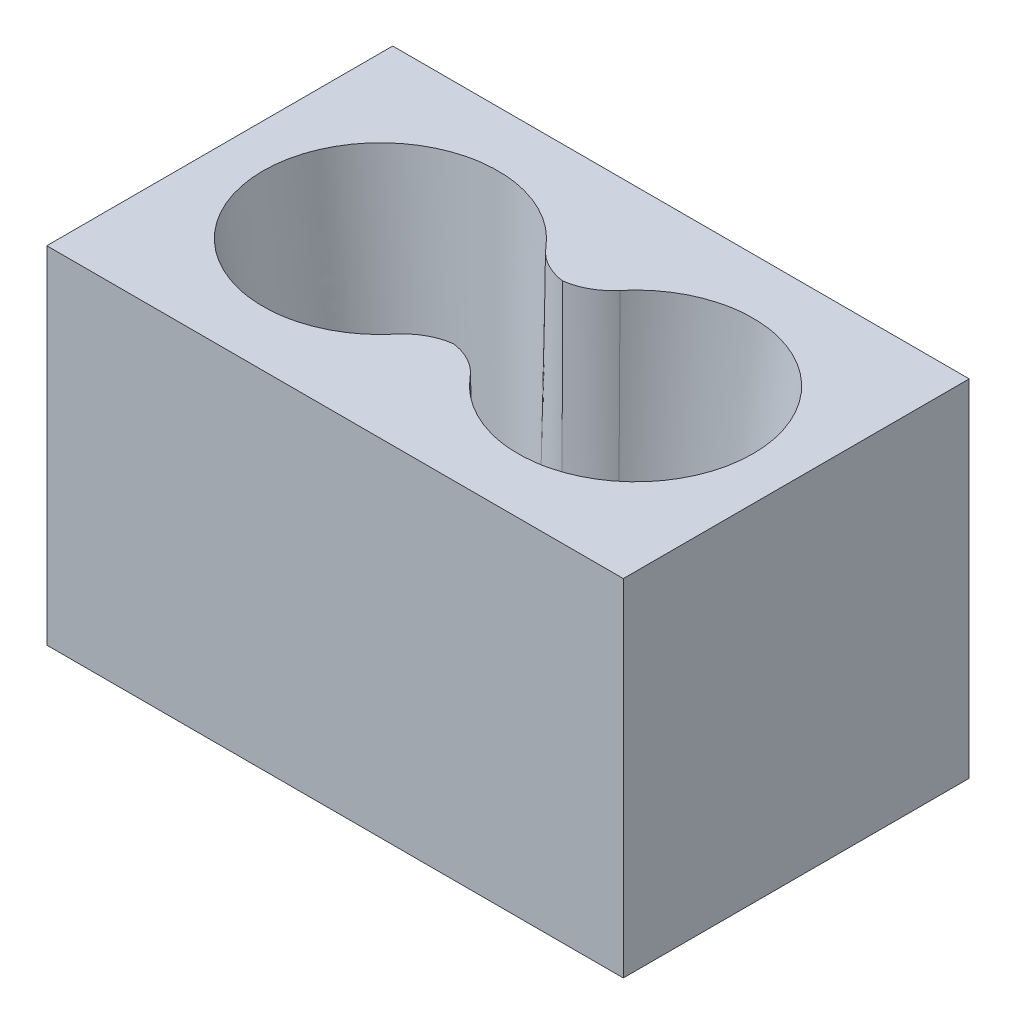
ISO-10303-21;
HEADER;
FILE_DESCRIPTION(('STEP AP214'),'2;1');
FILE_NAME('part.step','',(''),(''),'','','');
FILE_SCHEMA(('AUTOMOTIVE_DESIGN { 1 0 10303 214 1 1 1 1 }'));
ENDSEC;
DATA;
#1=APPLICATION_CONTEXT('core data for automotive mechanical design processes');
#2=APPLICATION_PROTOCOL_DEFINITION('international standard','automotive_design',2000,#1);
#3=PRODUCT_CONTEXT('',#1,'mechanical');
#4=PRODUCT('Part','Part','',(#3));
#5=PRODUCT_RELATED_PRODUCT_CATEGORY('part','',(#4));
#6=PRODUCT_DEFINITION_FORMATION('','',#4);
#7=PRODUCT_DEFINITION_CONTEXT('part definition',#1,'design');
#8=PRODUCT_DEFINITION('design','',#6,#7);
#9=PRODUCT_DEFINITION_SHAPE('','',#8);
#10=(LENGTH_UNIT() NAMED_UNIT(*) SI_UNIT(.MILLI.,.METRE.));
#11=(NAMED_UNIT(*) PLANE_ANGLE_UNIT() SI_UNIT($,.RADIAN.));
#12=(NAMED_UNIT(*) SI_UNIT($,.STERADIAN.) SOLID_ANGLE_UNIT());
#13=UNCERTAINTY_MEASURE_WITH_UNIT(LENGTH_MEASURE(1.E-05),#10,'distance_accuracy_value','');
#14=(GEOMETRIC_REPRESENTATION_CONTEXT(3) GLOBAL_UNCERTAINTY_ASSIGNED_CONTEXT((#13)) GLOBAL_UNIT_ASSIGNED_CONTEXT((#10,
#11,#12)) REPRESENTATION_CONTEXT('',''));
#15=CARTESIAN_POINT('',(0.,0.,0.));
#16=DIRECTION('',(0.,0.,1.));
#17=DIRECTION('',(1.,0.,0.));
#18=AXIS2_PLACEMENT_3D('',#15,#16,#17);
#19=CARTESIAN_POINT('',(100.,120.,60.));
#20=DIRECTION('',(-1.,0.,0.));
#21=DIRECTION('',(0.,0.,1.));
#22=AXIS2_PLACEMENT_3D('',#19,#20,#21);
#23=PLANE('',#22);
#24=DIRECTION('',(0.,0.,-1.));
#25=VECTOR('',#24,1.);
#26=CARTESIAN_POINT('',(100.,0.,60.));
#27=LINE('',#26,#25);
#28=CARTESIAN_POINT('',(100.,0.,60.));
#29=VERTEX_POINT('',#28);
#30=CARTESIAN_POINT('',(100.,0.,-60.));
#31=VERTEX_POINT('',#30);
#32=EDGE_CURVE('E161',#29,#31,#27,.T.);
#33=ORIENTED_EDGE('',*,*,#32,.T.);
#34=DIRECTION('',(0.,-1.,0.));
#35=VECTOR('',#34,1.);
#36=CARTESIAN_POINT('',(100.,120.,-60.));
#37=LINE('',#36,#35);
#38=CARTESIAN_POINT('',(100.,120.,-60.));
#39=VERTEX_POINT('',#38);
#40=EDGE_CURVE('E142',#39,#31,#37,.T.);
#41=ORIENTED_EDGE('',*,*,#40,.F.);
#42=DIRECTION('',(0.,0.,-1.));
#43=VECTOR('',#42,1.);
#44=CARTESIAN_POINT('',(100.,120.,60.));
#45=LINE('',#44,#43);
#46=CARTESIAN_POINT('',(100.,120.,60.));
#47=VERTEX_POINT('',#46);
#48=EDGE_CURVE('E149',#47,#39,#45,.T.);
#49=ORIENTED_EDGE('',*,*,#48,.F.);
#50=DIRECTION('',(0.,-1.,0.));
#51=VECTOR('',#50,1.);
#52=CARTESIAN_POINT('',(100.,120.,60.));
#53=LINE('',#52,#51);
#54=EDGE_CURVE('E548',#47,#29,#53,.T.);
#55=ORIENTED_EDGE('',*,*,#54,.T.);
#56=EDGE_LOOP('',(#33,#41,#49,#55));
#57=FACE_BOUND('',#56,.T.);
#58=ADVANCED_FACE('F60',(#57),#23,.F.);
#59=CARTESIAN_POINT('',(-100.,120.,-60.));
#60=DIRECTION('',(0.,0.,1.));
#61=DIRECTION('',(1.,0.,0.));
#62=AXIS2_PLACEMENT_3D('',#59,#60,#61);
#63=PLANE('',#62);
#64=DIRECTION('',(-1.,0.,0.));
#65=VECTOR('',#64,1.);
#66=CARTESIAN_POINT('',(-100.,0.,-60.));
#67=LINE('',#66,#65);
#68=CARTESIAN_POINT('',(-100.,0.,-60.));
#69=VERTEX_POINT('',#68);
#70=EDGE_CURVE('E555',#31,#69,#67,.T.);
#71=ORIENTED_EDGE('',*,*,#70,.T.);
#72=DIRECTION('',(0.,-1.,0.));
#73=VECTOR('',#72,1.);
#74=CARTESIAN_POINT('',(-100.,120.,-60.));
#75=LINE('',#74,#73);
#76=CARTESIAN_POINT('',(-100.,120.,-60.));
#77=VERTEX_POINT('',#76);
#78=EDGE_CURVE('E145',#77,#69,#75,.T.);
#79=ORIENTED_EDGE('',*,*,#78,.F.);
#80=DIRECTION('',(-1.,0.,0.));
#81=VECTOR('',#80,1.);
#82=CARTESIAN_POINT('',(-100.,120.,-60.));
#83=LINE('',#82,#81);
#84=EDGE_CURVE('E138',#39,#77,#83,.T.);
#85=ORIENTED_EDGE('',*,*,#84,.F.);
#86=ORIENTED_EDGE('',*,*,#40,.T.);
#87=EDGE_LOOP('',(#71,#79,#85,#86));
#88=FACE_BOUND('',#87,.T.);
#89=ADVANCED_FACE('F140',(#88),#63,.F.);
#90=CARTESIAN_POINT('',(-100.,120.,60.));
#91=DIRECTION('',(1.,0.,0.));
#92=DIRECTION('',(0.,0.,-1.));
#93=AXIS2_PLACEMENT_3D('',#90,#91,#92);
#94=PLANE('',#93);
#95=DIRECTION('',(0.,0.,1.));
#96=VECTOR('',#95,1.);
#97=CARTESIAN_POINT('',(-100.,0.,60.));
#98=LINE('',#97,#96);
#99=CARTESIAN_POINT('',(-100.,0.,60.));
#100=VERTEX_POINT('',#99);
#101=EDGE_CURVE('E552',#69,#100,#98,.T.);
#102=ORIENTED_EDGE('',*,*,#101,.T.);
#103=DIRECTION('',(0.,-1.,0.));
#104=VECTOR('',#103,1.);
#105=CARTESIAN_POINT('',(-100.,120.,60.));
#106=LINE('',#105,#104);
#107=CARTESIAN_POINT('',(-100.,120.,60.));
#108=VERTEX_POINT('',#107);
#109=EDGE_CURVE('E167',#108,#100,#106,.T.);
#110=ORIENTED_EDGE('',*,*,#109,.F.);
#111=DIRECTION('',(0.,0.,1.));
#112=VECTOR('',#111,1.);
#113=CARTESIAN_POINT('',(-100.,120.,60.));
#114=LINE('',#113,#112);
#115=EDGE_CURVE('E148',#77,#108,#114,.T.);
#116=ORIENTED_EDGE('',*,*,#115,.F.);
#117=ORIENTED_EDGE('',*,*,#78,.T.);
#118=EDGE_LOOP('',(#102,#110,#116,#117));
#119=FACE_BOUND('',#118,.T.);
#120=ADVANCED_FACE('F539',(#119),#94,.F.);
#121=CARTESIAN_POINT('',(-100.,120.,60.));
#122=DIRECTION('',(0.,0.,-1.));
#123=DIRECTION('',(-1.,0.,0.));
#124=AXIS2_PLACEMENT_3D('',#121,#122,#123);
#125=PLANE('',#124);
#126=DIRECTION('',(1.,0.,0.));
#127=VECTOR('',#126,1.);
#128=CARTESIAN_POINT('',(-100.,0.,60.));
#129=LINE('',#128,#127);
#130=EDGE_CURVE('E158',#100,#29,#129,.T.);
#131=ORIENTED_EDGE('',*,*,#130,.T.);
#132=ORIENTED_EDGE('',*,*,#54,.F.);
#133=DIRECTION('',(1.,0.,0.));
#134=VECTOR('',#133,1.);
#135=CARTESIAN_POINT('',(-100.,120.,60.));
#136=LINE('',#135,#134);
#137=EDGE_CURVE('E154',#108,#47,#136,.T.);
#138=ORIENTED_EDGE('',*,*,#137,.F.);
#139=ORIENTED_EDGE('',*,*,#109,.T.);
#140=EDGE_LOOP('',(#131,#132,#138,#139));
#141=FACE_BOUND('',#140,.T.);
#142=ADVANCED_FACE('F189',(#141),#125,.F.);
#143=CARTESIAN_POINT('',(0.,120.,0.));
#144=DIRECTION('',(0.,-1.,0.));
#145=DIRECTION('',(0.,0.,-1.));
#146=AXIS2_PLACEMENT_3D('',#143,#144,#145);
#147=PLANE('',#146);
#148=CARTESIAN_POINT('',(44.25,120.,0.));
#149=DIRECTION('',(0.,-1.,0.));
#150=DIRECTION('',(0.,0.,1.));
#151=AXIS2_PLACEMENT_3D('',#148,#149,#150);
#152=CIRCLE('',#151,40.75);
#153=CARTESIAN_POINT('',(12.8677503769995,120.,-25.9945424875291));
#154=VERTEX_POINT('',#153);
#155=CARTESIAN_POINT('',(12.8692275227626,120.,25.9960048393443));
#156=VERTEX_POINT('',#155);
#157=EDGE_CURVE('E64',#154,#156,#152,.T.);
#158=ORIENTED_EDGE('',*,*,#157,.T.);
#159=CARTESIAN_POINT('',(0.510638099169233,1.62508731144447,18.75));
#160=CARTESIAN_POINT('',(8.30644195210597,1.8789622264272,18.75));
#161=CARTESIAN_POINT('',(14.0438740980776,2.06580506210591,24.0307170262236));
#162=CARTESIAN_POINT('',(0.311614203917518,7.73897214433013,18.75));
#163=CARTESIAN_POINT('',(8.20690437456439,7.99912220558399,18.7500000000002));
#164=CARTESIAN_POINT('',(13.9722437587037,8.17129414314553,24.1476383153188));
#165=CARTESIAN_POINT('',(0.120925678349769,13.8531245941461,18.75));
#166=CARTESIAN_POINT('',(8.11272031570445,14.1091102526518,18.7500000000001));
#167=CARTESIAN_POINT('',(13.9027926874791,14.2774541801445,24.261876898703));
#168=CARTESIAN_POINT('',(-0.24576530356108,26.0818540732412,18.75));
#169=CARTESIAN_POINT('',(7.93333142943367,26.3305869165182,18.7499999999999));
#170=CARTESIAN_POINT('',(13.7677219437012,26.4909100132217,24.4853188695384));
#171=CARTESIAN_POINT('',(-0.42176779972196,32.1964311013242,18.75));
#172=CARTESIAN_POINT('',(7.84816760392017,32.4412798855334,18.7499999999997));
#173=CARTESIAN_POINT('',(13.70210226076,32.5982058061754,24.5945222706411));
#174=CARTESIAN_POINT('',(-0.603401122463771,38.7430107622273,18.75));
#175=CARTESIAN_POINT('',(7.76120691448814,38.9747249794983,18.75));
#176=CARTESIAN_POINT('',(13.633617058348,39.1373195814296,24.7089194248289));
#177=CARTESIAN_POINT('',(-0.615350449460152,39.1748407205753,18.75));
#178=CARTESIAN_POINT('',(7.75548154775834,39.40631758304,18.75));
#179=CARTESIAN_POINT('',(13.6291078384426,39.5686586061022,24.7164536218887));
#180=CARTESIAN_POINT('',(-0.627268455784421,39.6066715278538,18.75));
#181=CARTESIAN_POINT('',(7.74977570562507,39.8378642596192,18.75));
#182=CARTESIAN_POINT('',(13.6246067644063,39.9999999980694,24.7239761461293));
#183=CARTESIAN_POINT('',(-0.70866719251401,42.5561661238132,18.75));
#184=CARTESIAN_POINT('',(7.71077073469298,42.7879712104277,18.75));
#185=CARTESIAN_POINT('',(13.5938622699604,42.9461520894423,24.775353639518));
#186=CARTESIAN_POINT('',(-0.78860047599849,45.5057009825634,18.75));
#187=CARTESIAN_POINT('',(7.67268530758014,45.7358814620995,18.75));
#188=CARTESIAN_POINT('',(13.5635026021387,45.8924152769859,24.8261901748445));
#189=CARTESIAN_POINT('',(-0.945704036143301,51.4048440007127,18.75));
#190=CARTESIAN_POINT('',(7.59817047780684,51.631914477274,18.75));
#191=CARTESIAN_POINT('',(13.5035030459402,51.785148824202,24.9268061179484));
#192=CARTESIAN_POINT('',(-1.02287431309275,54.354452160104,18.75));
#193=CARTESIAN_POINT('',(7.56174457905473,54.5799551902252,18.75));
#194=CARTESIAN_POINT('',(13.4738631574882,54.7316191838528,24.9765855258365));
#195=CARTESIAN_POINT('',(-1.17461972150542,60.2537330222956,18.75));
#196=CARTESIAN_POINT('',(7.49043059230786,60.476244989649,18.75));
#197=CARTESIAN_POINT('',(13.4152533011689,60.6247505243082,25.07511197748));
#198=CARTESIAN_POINT('',(-1.24919485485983,63.2034057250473,18.75));
#199=CARTESIAN_POINT('',(7.4555457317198,63.4244134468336,18.75));
#200=CARTESIAN_POINT('',(13.3862833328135,63.5714115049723,25.1238590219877));
#201=CARTESIAN_POINT('',(-1.39589257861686,69.102812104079,18.75));
#202=CARTESIAN_POINT('',(7.38736618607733,69.3209183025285,18.75));
#203=CARTESIAN_POINT('',(13.3291433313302,69.4649050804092,25.2205307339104));
#204=CARTESIAN_POINT('',(-1.46801516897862,72.0525457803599,18.75));
#205=CARTESIAN_POINT('',(7.35407452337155,72.2691918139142,18.75));
#206=CARTESIAN_POINT('',(13.3009732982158,72.4117376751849,25.2684554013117));
#207=CARTESIAN_POINT('',(-1.64938815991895,79.5914658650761,18.75));
#208=CARTESIAN_POINT('',(7.2705686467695,79.807525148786,18.75));
#209=CARTESIAN_POINT('',(13.2296119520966,79.9433929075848,25.3895555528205));
#210=CARTESIAN_POINT('',(-1.75699571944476,84.1806918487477,18.75));
#211=CARTESIAN_POINT('',(7.22129224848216,84.3944859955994,18.75));
#212=CARTESIAN_POINT('',(13.1867734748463,84.5283382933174,25.4619616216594));
#213=CARTESIAN_POINT('',(-1.9670868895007,93.3592615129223,18.75));
#214=CARTESIAN_POINT('',(7.1256330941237,93.5689420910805,18.75));
#215=CARTESIAN_POINT('',(13.1023630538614,93.6985983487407,25.604447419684));
#216=CARTESIAN_POINT('',(-2.06957049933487,97.9486051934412,18.75));
#217=CARTESIAN_POINT('',(7.07925958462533,98.1561482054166,18.7499999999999));
#218=CARTESIAN_POINT('',(13.0607911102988,98.2839130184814,25.6745271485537));
#219=CARTESIAN_POINT('',(-2.23204014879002,105.395412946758,18.75));
#220=CARTESIAN_POINT('',(7.00615692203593,105.5968631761,18.7499999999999));
#221=CARTESIAN_POINT('',(12.9942681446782,105.724371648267,25.7864153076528));
#222=CARTESIAN_POINT('',(-2.29346837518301,108.2528456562,18.75));
#223=CARTESIAN_POINT('',(6.97860346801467,108.453068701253,18.75));
#224=CARTESIAN_POINT('',(12.9689653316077,108.579413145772,25.8289121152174));
#225=CARTESIAN_POINT('',(-2.41458765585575,113.967747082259,18.75));
#226=CARTESIAN_POINT('',(6.92445806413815,114.165618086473,18.75));
#227=CARTESIAN_POINT('',(12.918792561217,114.289617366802,25.9130658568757));
#228=CARTESIAN_POINT('',(-2.47427871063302,116.825215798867,18.75));
#229=CARTESIAN_POINT('',(6.89786797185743,117.021896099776,18.7500000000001));
#230=CARTESIAN_POINT('',(12.8939226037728,117.144780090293,25.95472279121));
#231=CARTESIAN_POINT('',(-2.53314557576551,119.682701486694,18.75));
#232=CARTESIAN_POINT('',(6.87174965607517,119.876447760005,18.75));
#233=CARTESIAN_POINT('',(12.8692627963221,119.99999999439,25.9959756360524));
#234=CARTESIAN_POINT('',(-2.56882049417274,121.414727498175,18.75));
#235=CARTESIAN_POINT('',(6.85590621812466,121.608423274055,18.75));
#236=CARTESIAN_POINT('',(12.854316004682,121.73065300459,26.0209776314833));
#237=CARTESIAN_POINT('',(-2.60420064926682,123.146759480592,18.75));
#238=CARTESIAN_POINT('',(6.84023040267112,123.339774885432,18.75));
#239=CARTESIAN_POINT('',(12.8394442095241,123.461326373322,26.0458331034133));
#240=CARTESIAN_POINT('',(-2.67437143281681,126.610835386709,18.75));
#241=CARTESIAN_POINT('',(6.8092028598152,126.80251690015,18.75));
#242=CARTESIAN_POINT('',(12.8098506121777,126.922713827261,26.095251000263));
#243=CARTESIAN_POINT('',(-2.70916206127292,128.342879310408,18.75));
#244=CARTESIAN_POINT('',(6.7938515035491,128.533893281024,18.75));
#245=CARTESIAN_POINT('',(12.7951288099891,128.653427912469,26.1198134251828));
#246=CARTESIAN_POINT('',(-2.74365792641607,130.074929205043,18.75));
#247=CARTESIAN_POINT('',(6.77866871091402,130.264609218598,18.7499999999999));
#248=CARTESIAN_POINT('',(12.7804820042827,130.384162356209,26.1442293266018));
#249=(BOUNDED_SURFACE() B_SPLINE_SURFACE(3,2,((#159,#160,#161),(#162,#163,#164),(#165,#166,
#167),(#168,#169,#170),(#171,#172,#173),(#174,#175,#176),(#177,#178,#179),(#180,#181,#182),
(#183,#184,#185),(#186,#187,#188),(#189,#190,#191),(#192,#193,#194),(#195,#196,#197),(#198,#199,
#200),(#201,#202,#203),(#204,#205,#206),(#207,#208,#209),(#210,#211,#212),(#213,#214,#215),
(#216,#217,#218),(#219,#220,#221),(#222,#223,#224),(#225,#226,#227),(#228,#229,#230),(#231,#232,
#233),(#234,#235,#236),(#237,#238,#239),(#240,#241,#242),(#243,#244,#245),(#246,#247,#248)),
.UNSPECIFIED.,.F.,.F.,.F.) B_SPLINE_SURFACE_WITH_KNOTS((4,2,2,3,2,2,2,2,2,2,2,3,2,4),(3,3),(0.,
18.3513599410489,36.702670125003,37.9986558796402,46.8505080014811,55.7023591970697,
64.5542039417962,73.4060488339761,87.1775076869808,100.948968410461,109.523246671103,
118.097522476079,123.294702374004,128.491882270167),(0.,1.),
.UNSPECIFIED.) GEOMETRIC_REPRESENTATION_ITEM() RATIONAL_B_SPLINE_SURFACE(((1.,0.931655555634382,
1.),(1.,0.930086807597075,1.),(1.,0.92855012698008,1.),(1.,0.925537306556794,1.),(1.,
0.924061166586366,1.),(1.,0.922511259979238,1.),(1.,0.922409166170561,1.),(1.,0.922307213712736,
1.),(1.,0.921610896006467,1.),(1.,0.920921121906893,1.),(1.,0.919554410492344,1.),(1.,
0.918877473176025,1.),(1.,0.917536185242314,1.),(1.,0.916871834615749,1.),(1.,0.915552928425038,
1.),(1.,0.914898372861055,1.),(1.,0.913242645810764,1.),(1.,0.912251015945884,1.),(1.,
0.910296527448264,1.),(1.,0.909333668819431,1.),(1.,0.907794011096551,1.),(1.,0.907208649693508,
1.),(1.,0.906048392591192,1.),(1.,0.905473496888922,1.),(1.,0.90490364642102,1.),(1.,
0.904558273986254,1.),(1.,0.904214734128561,1.),(1.,0.903531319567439,1.),(1.,0.903191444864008,
1.),(1.,0.90285340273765,1.))) REPRESENTATION_ITEM('') SURFACE());
#250=CARTESIAN_POINT('',(12.8692627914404,120.,25.9959756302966));
#251=CARTESIAN_POINT('',(12.6898655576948,120.,25.7793258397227));
#252=CARTESIAN_POINT('',(12.5059169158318,120.,25.5664854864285));
#253=CARTESIAN_POINT('',(12.1292137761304,120.,25.14875488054));
#254=CARTESIAN_POINT('',(11.9364594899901,120.,24.9438644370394));
#255=CARTESIAN_POINT('',(11.345514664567,120.,24.3416955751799));
#256=CARTESIAN_POINT('',(10.9345559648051,120.,23.9568155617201));
#257=CARTESIAN_POINT('',(10.0818179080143,120.,23.2232016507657));
#258=CARTESIAN_POINT('',(9.64005005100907,120.,22.874454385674));
#259=CARTESIAN_POINT('',(8.95669231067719,120.,22.3802561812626));
#260=CARTESIAN_POINT('',(8.72544804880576,120.,22.2203394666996));
#261=CARTESIAN_POINT('',(8.25636766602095,120.,21.9103505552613));
#262=CARTESIAN_POINT('',(8.01852987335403,120.,21.7602808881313));
#263=CARTESIAN_POINT('',(7.29557074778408,120.,21.3251567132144));
#264=CARTESIAN_POINT('',(6.80118244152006,120.,21.055316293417));
#265=CARTESIAN_POINT('',(5.79141649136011,120.,20.5582758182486));
#266=CARTESIAN_POINT('',(5.27603878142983,120.,20.3310758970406));
#267=CARTESIAN_POINT('',(4.49031274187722,120.,20.023569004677));
#268=CARTESIAN_POINT('',(4.22637127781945,120.,19.9266384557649));
#269=CARTESIAN_POINT('',(3.69471765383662,120.,19.7440078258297));
#270=CARTESIAN_POINT('',(3.42700652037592,120.,19.6583047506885));
#271=CARTESIAN_POINT('',(2.61887769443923,120.,19.4182636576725));
#272=CARTESIAN_POINT('',(2.07327105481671,120.,19.2809180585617));
#273=CARTESIAN_POINT('',(1.18898710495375,120.,19.0975344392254));
#274=CARTESIAN_POINT('',(0.853247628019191,120.,19.0368248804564));
#275=CARTESIAN_POINT('',(0.179060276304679,120.,18.9326377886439));
#276=CARTESIAN_POINT('',(-0.159387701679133,120.,18.8891609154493));
#277=CARTESIAN_POINT('',(-0.837704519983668,120.,18.8196066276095));
#278=CARTESIAN_POINT('',(-1.17757152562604,120.,18.7935112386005));
#279=CARTESIAN_POINT('',(-1.85818375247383,120.,18.758704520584));
#280=CARTESIAN_POINT('',(-2.19892894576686,120.,18.749992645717));
#281=CARTESIAN_POINT('',(-2.53967873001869,120.,18.75));
#282=B_SPLINE_CURVE_WITH_KNOTS('',3,(#250,#251,#252,#253,#254,#255,#256,#257,#258,#259,#260,
#261,#262,#263,#264,#265,#266,#267,#268,#269,#270,#271,#272,#273,#274,#275,#276,#277,#278,#279,
#280,#281),.UNSPECIFIED.,.F.,.F.,(4,2,2,2,2,2,2,2,2,2,2,2,2,2,2,4),(0.,0.843725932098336,
1.68743159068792,3.37443885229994,5.06081974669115,5.90406154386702,6.74751913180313,
8.43509398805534,10.1226741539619,10.9659830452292,11.8090665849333,13.49461216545,
14.5177940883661,15.5410151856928,16.5631765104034,17.5853057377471),.UNSPECIFIED.);
#283=CARTESIAN_POINT('',(1.76018940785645E-13,120.,18.9118356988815));
#284=VERTEX_POINT('',#283);
#285=EDGE_CURVE('E227',#156,#284,#282,.T.);
#286=ORIENTED_EDGE('',*,*,#285,.T.);
#287=CARTESIAN_POINT('',(2.91970135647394,139.038935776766,18.75));
#288=CARTESIAN_POINT('',(-6.70141990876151,139.225228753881,18.75));
#289=CARTESIAN_POINT('',(-12.7053217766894,139.341481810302,26.2693302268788));
#290=CARTESIAN_POINT('',(2.85727025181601,135.812856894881,18.75));
#291=CARTESIAN_POINT('',(-6.72869077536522,136.002693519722,18.75));
#292=CARTESIAN_POINT('',(-12.732134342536,136.117764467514,26.2247712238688));
#293=CARTESIAN_POINT('',(2.79384171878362,132.586797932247,18.75));
#294=CARTESIAN_POINT('',(-6.7565320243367,132.777831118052,18.75));
#295=CARTESIAN_POINT('',(-12.7592023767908,132.894115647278,26.1797121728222));
#296=CARTESIAN_POINT('',(2.66498979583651,126.134719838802,18.75));
#297=CARTESIAN_POINT('',(-6.81331210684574,126.328100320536,18.75));
#298=CARTESIAN_POINT('',(-12.813849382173,126.446955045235,26.0885939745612));
#299=CARTESIAN_POINT('',(2.59956640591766,122.908700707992,18.75));
#300=CARTESIAN_POINT('',(-6.84224862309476,123.103321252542,18.75));
#301=CARTESIAN_POINT('',(-12.8414283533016,123.223443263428,26.0425348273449));
#302=CARTESIAN_POINT('',(2.53314558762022,119.682701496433,18.75));
#303=CARTESIAN_POINT('',(-6.87174964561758,119.876447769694,18.75));
#304=CARTESIAN_POINT('',(-12.8692627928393,120.000000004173,25.9959756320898));
#305=CARTESIAN_POINT('',(2.48087127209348,117.145199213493,18.75));
#306=CARTESIAN_POINT('',(-6.89494536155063,117.341374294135,18.75));
#307=CARTESIAN_POINT('',(-12.8911621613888,117.46450969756,25.9593435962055));
#308=CARTESIAN_POINT('',(2.42794618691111,114.607710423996,18.75));
#309=CARTESIAN_POINT('',(-6.91851254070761,114.804934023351,18.75));
#310=CARTESIAN_POINT('',(-12.9132259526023,114.929064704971,25.9223911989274));
#311=CARTESIAN_POINT('',(2.32073389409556,109.532760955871,18.75));
#312=CARTESIAN_POINT('',(-6.96640315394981,109.732064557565,18.75));
#313=CARTESIAN_POINT('',(-12.9576934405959,109.858269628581,25.8478265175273));
#314=CARTESIAN_POINT('',(2.26644668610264,106.995300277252,18.75));
#315=CARTESIAN_POINT('',(-6.99072529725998,107.195681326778,18.75));
#316=CARTESIAN_POINT('',(-12.9800971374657,107.322919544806,25.810214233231));
#317=CARTESIAN_POINT('',(2.08652764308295,98.6944492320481,18.75));
#318=CARTESIAN_POINT('',(-7.07152879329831,98.9043952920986,18.7499999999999));
#319=CARTESIAN_POINT('',(-13.0539613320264,99.0290873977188,25.6860609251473));
#320=CARTESIAN_POINT('',(1.95793735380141,92.9311224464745,18.75));
#321=CARTESIAN_POINT('',(-7.12970604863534,93.1438554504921,18.75));
#322=CARTESIAN_POINT('',(-13.1061516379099,93.2708143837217,25.5981078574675));
#323=CARTESIAN_POINT('',(1.7589302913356,84.2862735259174,18.75));
#324=CARTESIAN_POINT('',(-7.22048601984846,84.4970565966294,18.75));
#325=CARTESIAN_POINT('',(-13.1859099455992,84.6338486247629,25.4633700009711));
#326=CARTESIAN_POINT('',(1.69157432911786,81.4046806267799,18.75));
#327=CARTESIAN_POINT('',(-7.25129755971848,81.616822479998,18.75));
#328=CARTESIAN_POINT('',(-13.2127415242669,81.7549338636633,25.4179893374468));
#329=CARTESIAN_POINT('',(1.5547044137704,75.6415460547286,18.75));
#330=CARTESIAN_POINT('',(-7.31413842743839,75.8563787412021,18.75));
#331=CARTESIAN_POINT('',(-13.266913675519,75.9972626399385,25.3262550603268));
#332=CARTESIAN_POINT('',(1.48519046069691,72.7600043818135,18.75));
#333=CARTESIAN_POINT('',(-7.34616525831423,72.9762447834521,18.75));
#334=CARTESIAN_POINT('',(-13.29425424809,73.1185061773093,25.2799014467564));
#335=CARTESIAN_POINT('',(1.35829290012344,67.5848621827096,18.75));
#336=CARTESIAN_POINT('',(-7.4048673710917,67.802863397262,18.75));
#337=CARTESIAN_POINT('',(-13.3438469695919,67.9484675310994,25.1957594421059));
#338=CARTESIAN_POINT('',(1.30132791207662,65.2912513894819,18.75));
#339=CARTESIAN_POINT('',(-7.43129319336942,65.5103931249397,18.75));
#340=CARTESIAN_POINT('',(-13.3659992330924,65.6571543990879,25.1581529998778));
#341=CARTESIAN_POINT('',(1.185885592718,60.7040679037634,18.75));
#342=CARTESIAN_POINT('',(-7.48515619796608,60.925492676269,18.75));
#343=CARTESIAN_POINT('',(-13.4108263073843,61.0746331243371,25.0824700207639));
#344=CARTESIAN_POINT('',(1.12740826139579,58.4104952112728,18.75));
#345=CARTESIAN_POINT('',(-7.51259191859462,58.6330901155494,18.75));
#346=CARTESIAN_POINT('',(-13.4335011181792,58.7834249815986,25.044393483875));
#347=CARTESIAN_POINT('',(0.949603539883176,51.5298394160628,18.75));
#348=CARTESIAN_POINT('',(-7.59623801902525,51.7598489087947,18.75));
#349=CARTESIAN_POINT('',(-13.5021079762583,51.9099795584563,24.9291916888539));
#350=CARTESIAN_POINT('',(0.827903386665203,46.9428171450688,18.75));
#351=CARTESIAN_POINT('',(-7.65387333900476,47.1753901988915,18.75));
#352=CARTESIAN_POINT('',(-13.5486224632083,47.3279198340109,24.851094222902));
#353=CARTESIAN_POINT('',(0.677708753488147,41.4394803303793,18.75));
#354=CARTESIAN_POINT('',(-7.72563893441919,41.6698859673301,18.75));
#355=CARTESIAN_POINT('',(-13.6055393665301,41.8307385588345,24.7558500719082));
#356=CARTESIAN_POINT('',(0.65255941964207,40.5230739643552,18.75));
#357=CARTESIAN_POINT('',(-7.73766254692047,40.7539798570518,18.75));
#358=CARTESIAN_POINT('',(-13.6150540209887,40.9153639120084,24.739938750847));
#359=CARTESIAN_POINT('',(0.62726845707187,39.6066715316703,18.75));
#360=CARTESIAN_POINT('',(-7.7497757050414,39.8378642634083,18.75));
#361=CARTESIAN_POINT('',(-13.6246067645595,40.000000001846,24.7239761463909));
#362=CARTESIAN_POINT('',(0.570295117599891,37.5423258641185,18.75));
#363=CARTESIAN_POINT('',(-7.7770407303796,37.7757385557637,18.75));
#364=CARTESIAN_POINT('',(-13.6461238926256,37.9379939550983,24.6880151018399));
#365=CARTESIAN_POINT('',(0.512602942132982,35.4779999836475,18.75));
#366=CARTESIAN_POINT('',(-7.80475386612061,35.7125730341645,18.75));
#367=CARTESIAN_POINT('',(-13.6678281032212,35.8760425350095,24.6517870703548));
#368=CARTESIAN_POINT('',(0.395710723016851,31.3493921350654,18.75));
#369=CARTESIAN_POINT('',(-7.86109765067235,31.5862877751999,18.75));
#370=CARTESIAN_POINT('',(-13.7116291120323,31.7522566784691,24.5787848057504));
#371=CARTESIAN_POINT('',(0.336510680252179,29.2851101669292,18.75));
#372=CARTESIAN_POINT('',(-7.88972691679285,29.5231974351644,18.75));
#373=CARTESIAN_POINT('',(-13.7337259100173,29.6904222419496,24.5420105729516));
#374=CARTESIAN_POINT('',(0.216532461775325,25.1565919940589,18.75));
#375=CARTESIAN_POINT('',(-7.94795004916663,25.3970661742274,18.75));
#376=CARTESIAN_POINT('',(-13.7783305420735,25.566875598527,24.4679036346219));
#377=CARTESIAN_POINT('',(0.155754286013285,23.0923557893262,18.75));
#378=CARTESIAN_POINT('',(-7.97754244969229,23.3340551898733,18.75));
#379=CARTESIAN_POINT('',(-13.8008383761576,23.5051633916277,24.4305709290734));
#380=CARTESIAN_POINT('',(0.0325416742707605,18.9639316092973,18.75));
#381=CARTESIAN_POINT('',(-8.03774465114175,19.2080852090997,18.75));
#382=CARTESIAN_POINT('',(-13.8462858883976,19.3818674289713,24.3553341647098));
#383=CARTESIAN_POINT('',(-0.0298927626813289,16.8997436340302,18.75));
#384=CARTESIAN_POINT('',(-8.06835289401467,17.1451567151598,18.75));
#385=CARTESIAN_POINT('',(-13.8692255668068,17.3202836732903,24.3174301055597));
#386=CARTESIAN_POINT('',(-0.0931943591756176,14.8355821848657,18.75));
#387=CARTESIAN_POINT('',(-8.09951320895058,15.0811156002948,18.7500000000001));
#388=CARTESIAN_POINT('',(-13.892391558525,15.2587684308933,24.2792339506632));
#389=(BOUNDED_SURFACE() B_SPLINE_SURFACE(3,2,((#287,#288,#289),(#290,#291,#292),(#293,#294,
#295),(#296,#297,#298),(#299,#300,#301),(#302,#303,#304),(#305,#306,#307),(#308,#309,#310),
(#311,#312,#313),(#314,#315,#316),(#317,#318,#319),(#320,#321,#322),(#323,#324,#325),(#326,#327,
#328),(#329,#330,#331),(#332,#333,#334),(#335,#336,#337),(#338,#339,#340),(#341,#342,#343),
(#344,#345,#346),(#347,#348,#349),(#350,#351,#352),(#353,#354,#355),(#356,#357,#358),(#359,#360,
#361),(#362,#363,#364),(#365,#366,#367),(#368,#369,#370),(#371,#372,#373),(#374,#375,#376),
(#377,#378,#379),(#380,#381,#382),(#383,#384,#385),(#386,#387,#388)),.UNSPECIFIED.,.F.,.F.,
.F.) B_SPLINE_SURFACE_WITH_KNOTS((4,2,3,2,2,2,2,2,2,2,2,3,2,2,2,4),(3,3),(0.,9.68004733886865,
19.3600946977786,26.974216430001,34.5883401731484,51.8826173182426,60.5297567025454,
69.176895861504,76.0598496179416,82.9428034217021,96.7087066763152,99.4589608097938,
105.65435590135,111.849747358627,118.045139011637,124.240534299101),(0.,1.),
.UNSPECIFIED.) GEOMETRIC_REPRESENTATION_ITEM() RATIONAL_B_SPLINE_SURFACE(((1.,0.901119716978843,
1.),(1.,0.901737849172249,1.),(1.,0.902362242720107,1.),(1.,0.903623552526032,1.),(1.,
0.904260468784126,1.),(1.,0.904903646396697,1.),(1.,0.90540966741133,1.),(1.,0.905919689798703,
1.),(1.,0.906947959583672,1.),(1.,0.907466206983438,1.),(1.,0.909175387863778,1.),(1.,
0.910383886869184,1.),(1.,0.912231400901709,1.),(1.,0.912853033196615,1.),(1.,0.914108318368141,
1.),(1.,0.914741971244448,1.),(1.,0.9158909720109,1.),(1.,0.916404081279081,1.),(1.,
0.917435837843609,1.),(1.,0.917954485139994,1.),(1.,0.919522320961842,1.),(1.,0.920583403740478,
1.),(1.,0.921875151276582,1.),(1.,0.922090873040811,1.),(1.,0.922307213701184,1.),(1.,
0.922794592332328,1.),(1.,0.923285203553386,1.),(1.,0.924273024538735,1.),(1.,0.924770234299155,
1.),(1.,0.925771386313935,1.),(1.,0.926275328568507,1.),(1.,0.927290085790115,1.),(1.,
0.927800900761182,1.),(1.,0.928315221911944,1.))) REPRESENTATION_ITEM('') SURFACE());
#390=CARTESIAN_POINT('',(2.53967873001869,120.,18.75));
#391=CARTESIAN_POINT('',(2.25835165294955,120.,18.749999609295));
#392=CARTESIAN_POINT('',(1.97705584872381,120.,18.7559339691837));
#393=CARTESIAN_POINT('',(1.41497117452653,120.,18.7796550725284));
#394=CARTESIAN_POINT('',(1.1341822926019,120.,18.7974415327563));
#395=CARTESIAN_POINT('',(0.293355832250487,120.,18.8685425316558));
#396=CARTESIAN_POINT('',(-0.265275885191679,120.,18.9395987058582));
#397=CARTESIAN_POINT('',(-1.37436566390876,120.,19.1285075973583));
#398=CARTESIAN_POINT('',(-1.92482655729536,120.,19.2463436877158));
#399=CARTESIAN_POINT('',(-2.74144656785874,120.,19.457498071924));
#400=CARTESIAN_POINT('',(-3.0121493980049,120.,19.5336190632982));
#401=CARTESIAN_POINT('',(-3.55017639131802,120.,19.6972196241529));
#402=CARTESIAN_POINT('',(-3.81749967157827,120.,19.7847020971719));
#403=CARTESIAN_POINT('',(-4.61387878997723,120.,20.0640509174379));
#404=CARTESIAN_POINT('',(-5.13712591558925,120.,20.2727622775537));
#405=CARTESIAN_POINT('',(-6.16415830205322,120.,20.7335624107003));
#406=CARTESIAN_POINT('',(-6.66794350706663,120.,20.985651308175));
#407=CARTESIAN_POINT('',(-7.40604319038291,120.,21.3947808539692));
#408=CARTESIAN_POINT('',(-7.64907896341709,120.,21.536277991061));
#409=CARTESIAN_POINT('',(-8.12890260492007,120.,21.8293435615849));
#410=CARTESIAN_POINT('',(-8.36569212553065,120.,21.9809092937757));
#411=CARTESIAN_POINT('',(-9.06609501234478,120.,22.4503468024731));
#412=CARTESIAN_POINT('',(-9.51992482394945,120.,22.7830598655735));
#413=CARTESIAN_POINT('',(-10.2250456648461,120.,23.3471691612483));
#414=CARTESIAN_POINT('',(-10.4857772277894,120.,23.5669295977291));
#415=CARTESIAN_POINT('',(-10.9957045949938,120.,24.0195152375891));
#416=CARTESIAN_POINT('',(-11.2448999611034,120.,24.2523409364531));
#417=CARTESIAN_POINT('',(-11.7308070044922,120.,24.7301748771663));
#418=CARTESIAN_POINT('',(-11.9675312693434,120.,24.9751703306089));
#419=CARTESIAN_POINT('',(-12.4281603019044,120.,25.476915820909));
#420=CARTESIAN_POINT('',(-12.652065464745,120.,25.7336654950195));
#421=CARTESIAN_POINT('',(-12.8692627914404,120.,25.9959756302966));
#422=B_SPLINE_CURVE_WITH_KNOTS('',3,(#390,#391,#392,#393,#394,#395,#396,#397,#398,#399,#400,
#401,#402,#403,#404,#405,#406,#407,#408,#409,#410,#411,#412,#413,#414,#415,#416,#417,#418,#419,
#420,#421),.UNSPECIFIED.,.F.,.F.,(4,2,2,2,2,2,2,2,2,2,2,2,2,2,2,4),(0.,0.843856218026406,
1.68769227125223,3.3749627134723,5.06163398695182,5.90502062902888,6.74862323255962,
8.43650174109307,10.1243850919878,10.9678389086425,11.8110673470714,13.4969014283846,
14.519507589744,15.5421525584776,16.5637447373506,17.5853054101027),.UNSPECIFIED.);
#423=CARTESIAN_POINT('',(-12.8692294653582,120.,25.9960032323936));
#424=VERTEX_POINT('',#423);
#425=EDGE_CURVE('E226',#284,#424,#422,.T.);
#426=ORIENTED_EDGE('',*,*,#425,.T.);
#427=CARTESIAN_POINT('',(-44.25,120.,0.));
#428=DIRECTION('',(0.,1.,0.));
#429=DIRECTION('',(0.,0.,1.));
#430=AXIS2_PLACEMENT_3D('',#427,#428,#429);
#431=CIRCLE('',#430,40.75);
#432=CARTESIAN_POINT('',(-12.8677481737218,120.,-25.9945443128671));
#433=VERTEX_POINT('',#432);
#434=EDGE_CURVE('E400',#433,#424,#431,.T.);
#435=ORIENTED_EDGE('',*,*,#434,.F.);
#436=CARTESIAN_POINT('',(-0.476030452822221,2.69074144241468,-18.75));
#437=CARTESIAN_POINT('',(-8.29044717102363,2.94386961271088,-18.75));
#438=CARTESIAN_POINT('',(-14.0330413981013,3.12988635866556,-24.0525646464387));
#439=CARTESIAN_POINT('',(-0.280298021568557,8.73562042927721,-18.75));
#440=CARTESIAN_POINT('',(-8.19264857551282,8.99482105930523,-18.7500000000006));
#441=CARTESIAN_POINT('',(-13.9624452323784,9.16651989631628,-24.167789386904));
#442=CARTESIAN_POINT('',(-0.0926309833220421,14.7807572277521,-18.75));
#443=CARTESIAN_POINT('',(-8.09993973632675,15.0358724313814,-18.7500000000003));
#444=CARTESIAN_POINT('',(-13.8938501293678,15.203809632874,-24.2803022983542));
#445=CARTESIAN_POINT('',(0.268478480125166,26.8714408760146,-18.75));
#446=CARTESIAN_POINT('',(-7.92311996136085,27.1194379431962,-18.7499999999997));
#447=CARTESIAN_POINT('',(-13.7602597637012,27.2794953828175,-24.5003186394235));
#448=CARTESIAN_POINT('',(0.441920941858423,32.9169877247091,-18.75));
#449=CARTESIAN_POINT('',(-7.83904818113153,33.1611665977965,-18.7499999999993));
#450=CARTESIAN_POINT('',(-13.6952644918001,33.3178913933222,-24.6078220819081));
#451=CARTESIAN_POINT('',(0.615144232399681,39.1773607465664,-18.75));
#452=CARTESIAN_POINT('',(-7.75594343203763,39.4087976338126,-18.75));
#453=CARTESIAN_POINT('',(-13.6296168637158,39.5711680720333,-24.7167635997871));
#454=CARTESIAN_POINT('',(0.621076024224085,39.3920193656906,-18.75));
#455=CARTESIAN_POINT('',(-7.75309433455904,39.6233388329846,-18.75));
#456=CARTESIAN_POINT('',(-13.6273679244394,39.7855837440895,-24.720496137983));
#457=CARTESIAN_POINT('',(0.627000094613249,39.606678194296,-18.75));
#458=CARTESIAN_POINT('',(-7.75025004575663,39.8378687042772,-18.75));
#459=CARTESIAN_POINT('',(-13.6251209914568,39.9999999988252,-24.7242257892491));
#460=CARTESIAN_POINT('',(0.790845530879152,45.5452001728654,-18.75));
#461=CARTESIAN_POINT('',(-7.6714684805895,45.7821188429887,-18.75));
#462=CARTESIAN_POINT('',(-13.5629660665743,45.9318137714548,-24.8273958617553));
#463=CARTESIAN_POINT('',(0.948831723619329,51.4838816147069,-18.75));
#464=CARTESIAN_POINT('',(-7.59634912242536,51.7173911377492,-18.75));
#465=CARTESIAN_POINT('',(-13.5023390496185,51.8640697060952,-24.9283689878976));
#466=CARTESIAN_POINT('',(1.25428634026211,63.3615109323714,-18.75));
#467=CARTESIAN_POINT('',(-7.45238014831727,63.5890474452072,-18.75));
#468=CARTESIAN_POINT('',(-13.3838593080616,63.7293531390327,-25.1261920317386));
#469=CARTESIAN_POINT('',(1.40175477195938,69.3004588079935,-18.75));
#470=CARTESIAN_POINT('',(-7.38355686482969,69.5247837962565,-18.75));
#471=CARTESIAN_POINT('',(-13.3260065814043,69.6623806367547,-25.2230419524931));
#472=CARTESIAN_POINT('',(1.65490585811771,79.8282861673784,-18.75));
#473=CARTESIAN_POINT('',(-7.26646289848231,80.0442577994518,-18.75));
#474=CARTESIAN_POINT('',(-13.2256637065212,80.1801075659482,-25.3913077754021));
#475=CARTESIAN_POINT('',(1.76246596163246,84.4171207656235,-18.75));
#476=CARTESIAN_POINT('',(-7.21705970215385,84.6308557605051,-18.75));
#477=CARTESIAN_POINT('',(-13.182671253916,84.7646724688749,-25.4634999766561));
#478=CARTESIAN_POINT('',(1.97246917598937,93.594907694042,-18.75));
#479=CARTESIAN_POINT('',(-7.12126660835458,93.8045389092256,-18.75));
#480=CARTESIAN_POINT('',(-13.0980876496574,93.9341618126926,-25.605714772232));
#481=CARTESIAN_POINT('',(2.07491228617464,98.1838600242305,-18.75));
#482=CARTESIAN_POINT('',(-7.07488598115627,98.391356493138,-18.75));
#483=CARTESIAN_POINT('',(-13.0564964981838,98.5190862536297,-25.6757373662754));
#484=CARTESIAN_POINT('',(2.23646833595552,105.591125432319,-18.75));
#485=CARTESIAN_POINT('',(-7.00221356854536,105.792500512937,-18.75));
#486=CARTESIAN_POINT('',(-12.9903556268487,105.920034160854,-25.78702293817));
#487=CARTESIAN_POINT('',(2.29704788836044,108.409406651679,-18.75));
#488=CARTESIAN_POINT('',(-6.97506044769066,108.609577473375,-18.75));
#489=CARTESIAN_POINT('',(-12.9654228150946,108.735954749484,-25.8289574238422));
#490=CARTESIAN_POINT('',(2.41651057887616,114.046004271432,-18.75));
#491=CARTESIAN_POINT('',(-6.92183618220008,114.243837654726,-18.75));
#492=CARTESIAN_POINT('',(-12.9161301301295,114.367902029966,-25.9121863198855));
#493=CARTESIAN_POINT('',(2.47539371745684,116.864320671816,-18.75));
#494=CARTESIAN_POINT('',(-6.89576686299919,117.060972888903,-18.75));
#495=CARTESIAN_POINT('',(-12.8917702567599,117.183928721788,-25.9534807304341));
#496=CARTESIAN_POINT('',(2.5334685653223,119.682653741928,-18.75));
#497=CARTESIAN_POINT('',(-6.87028928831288,119.876420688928,-18.75));
#498=CARTESIAN_POINT('',(-12.8677513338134,119.999999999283,-25.9945417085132));
#499=CARTESIAN_POINT('',(2.56994955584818,121.453439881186,-18.75));
#500=CARTESIAN_POINT('',(-6.85421653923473,121.647165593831,-18.75));
#501=CARTESIAN_POINT('',(-12.8526044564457,121.769370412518,-26.0202701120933));
#502=CARTESIAN_POINT('',(2.60612050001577,123.224232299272,-18.75));
#503=CARTESIAN_POINT('',(-6.83831110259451,123.417257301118,-18.75));
#504=CARTESIAN_POINT('',(-12.8375268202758,123.53876317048,-26.0458331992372));
#505=CARTESIAN_POINT('',(2.67784229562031,126.765829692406,-18.75));
#506=CARTESIAN_POINT('',(-6.80682323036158,126.957484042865,-18.75));
#507=CARTESIAN_POINT('',(-12.8075100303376,127.077593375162,-26.0966287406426));
#508=CARTESIAN_POINT('',(2.7133931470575,128.536634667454,-18.75));
#509=CARTESIAN_POINT('',(-6.79124119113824,128.727602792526,-18.75));
#510=CARTESIAN_POINT('',(-12.7925708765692,128.847030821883,-26.1218611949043));
#511=CARTESIAN_POINT('',(2.74863395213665,130.30744592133,-18.75));
#512=CARTESIAN_POINT('',(-6.77582746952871,130.49702602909,-18.75));
#513=CARTESIAN_POINT('',(-12.7777009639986,130.61649061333,-26.1469283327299));
#514=(BOUNDED_SURFACE() B_SPLINE_SURFACE(3,2,((#436,#437,#438),(#439,#440,#441),(#442,#443,
#444),(#445,#446,#447),(#448,#449,#450),(#451,#452,#453),(#454,#455,#456),(#457,#458,#459),
(#460,#461,#462),(#463,#464,#465),(#466,#467,#468),(#469,#470,#471),(#472,#473,#474),(#475,#476,
#477),(#478,#479,#480),(#481,#482,#483),(#484,#485,#486),(#487,#488,#489),(#490,#491,#492),
(#493,#494,#495),(#496,#497,#498),(#499,#500,#501),(#502,#503,#504),(#505,#506,#507),(#508,#509,
#510),(#511,#512,#513)),.UNSPECIFIED.,.F.,.F.,.F.) B_SPLINE_SURFACE_WITH_KNOTS((4,2,2,3,2,2,2,2,
2,3,2,4),(3,3),(0.,18.1441318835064,36.2882171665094,36.9324388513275,54.7547783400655,
72.5771046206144,86.3473869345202,100.117671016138,108.574467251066,117.03126114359,
122.344746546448,127.658231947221),(0.,1.),
.UNSPECIFIED.) GEOMETRIC_REPRESENTATION_ITEM() RATIONAL_B_SPLINE_SURFACE(((1.,0.93136238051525,
1.),(1.,0.929815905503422,1.),(1.,0.92830201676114,1.),(1.,0.925334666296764,1.),(1.,
0.923881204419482,1.),(1.,0.922404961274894,1.),(1.,0.92235437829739,1.),(1.,0.922303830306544,
1.),(1.,0.92090555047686,1.),(1.,0.91953389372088,1.),(1.,0.916840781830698,1.),(1.,
0.915519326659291,1.),(1.,0.913218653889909,1.),(1.,0.912229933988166,1.),(1.,0.910279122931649,
1.),(1.,0.909317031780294,1.),(1.,0.907785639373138,1.),(1.,0.907208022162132,1.),(1.,
0.906060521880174,1.),(1.,0.905490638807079,1.),(1.,0.904923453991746,1.),(1.,0.904568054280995,
1.),(1.,0.904214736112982,1.),(1.,0.903512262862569,1.),(1.,0.903163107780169,1.),(1.,
0.902816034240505,1.))) REPRESENTATION_ITEM('') SURFACE());
#515=CARTESIAN_POINT('',(-12.8677513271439,120.,-25.9945417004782));
#516=CARTESIAN_POINT('',(-12.5295621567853,120.,-25.5861381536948));
#517=CARTESIAN_POINT('',(-12.1750901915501,120.,-25.1912645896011));
#518=CARTESIAN_POINT('',(-11.4359516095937,120.,-24.4309195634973));
#519=CARTESIAN_POINT('',(-11.0512870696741,120.,-24.0654460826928));
#520=CARTESIAN_POINT('',(-10.2541149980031,120.,-23.3662110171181));
#521=CARTESIAN_POINT('',(-9.84160941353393,120.,-23.0324472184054));
#522=CARTESIAN_POINT('',(-9.20407166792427,120.,-22.5572413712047));
#523=CARTESIAN_POINT('',(-8.98841859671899,120.,-22.4030727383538));
#524=CARTESIAN_POINT('',(-8.55110355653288,120.,-22.1033866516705));
#525=CARTESIAN_POINT('',(-8.32944008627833,120.,-21.9578713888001));
#526=CARTESIAN_POINT('',(-7.62868966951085,120.,-21.5175405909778));
#527=CARTESIAN_POINT('',(-7.13969235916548,120.,-21.2383011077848));
#528=CARTESIAN_POINT('',(-6.13989117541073,120.,-20.7220271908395));
#529=CARTESIAN_POINT('',(-5.62908663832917,120.,-20.4849940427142));
#530=CARTESIAN_POINT('',(-4.84951026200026,120.,-20.1624424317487));
#531=CARTESIAN_POINT('',(-4.58746067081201,120.,-20.0604368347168));
#532=CARTESIAN_POINT('',(-4.059379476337,120.,-19.8675855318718));
#533=CARTESIAN_POINT('',(-3.79334904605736,120.,-19.7767366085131));
#534=CARTESIAN_POINT('',(-2.98991579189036,120.,-19.5211548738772));
#535=CARTESIAN_POINT('',(-2.44700106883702,120.,-19.3733168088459));
#536=CARTESIAN_POINT('',(-1.53502537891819,120.,-19.1658080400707));
#537=CARTESIAN_POINT('',(-1.16882510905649,120.,-19.0932024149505));
#538=CARTESIAN_POINT('',(-0.432939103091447,120.,-18.9685819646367));
#539=CARTESIAN_POINT('',(-0.0632536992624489,120.,-18.9165651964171));
#540=CARTESIAN_POINT('',(0.678073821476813,120.,-18.8333334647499));
#541=CARTESIAN_POINT('',(1.04971365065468,120.,-18.8020980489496));
#542=CARTESIAN_POINT('',(1.79423513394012,120.,-18.7604237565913));
#543=CARTESIAN_POINT('',(2.16711703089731,120.,-18.7499892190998));
#544=CARTESIAN_POINT('',(2.54000416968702,120.,-18.75));
#545=B_SPLINE_CURVE_WITH_KNOTS('',3,(#515,#516,#517,#518,#519,#520,#521,#522,#523,#524,#525,
#526,#527,#528,#529,#530,#531,#532,#533,#534,#535,#536,#537,#538,#539,#540,#541,#542,#543,#544),
.UNSPECIFIED.,.F.,.F.,(4,2,2,2,2,2,2,2,2,2,2,2,2,2,4),(0.,1.59026551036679,3.18042172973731,
4.77046684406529,5.56556426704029,6.36086215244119,8.04805384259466,9.7352969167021,
10.5786833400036,11.4218259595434,13.1075612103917,14.2270425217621,15.3464181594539,
16.4646905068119,17.5831961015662),.UNSPECIFIED.);
#546=CARTESIAN_POINT('',(0.,120.,-18.911877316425));
#547=VERTEX_POINT('',#546);
#548=EDGE_CURVE('E481',#433,#547,#545,.T.);
#549=ORIENTED_EDGE('',*,*,#548,.T.);
#550=CARTESIAN_POINT('',(-2.9236738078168,139.226999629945,-18.75));
#551=CARTESIAN_POINT('',(6.69944439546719,139.413194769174,-18.75));
#552=CARTESIAN_POINT('',(12.7033744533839,139.529363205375,-26.2718615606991));
#553=CARTESIAN_POINT('',(-2.860684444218,135.969567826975,-18.75));
#554=CARTESIAN_POINT('',(6.72682896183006,136.159387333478,-18.75));
#555=CARTESIAN_POINT('',(12.7303064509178,136.274323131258,-26.2267366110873));
#556=CARTESIAN_POINT('',(-2.79667266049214,132.712156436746,-18.75));
#557=CARTESIAN_POINT('',(6.75477021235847,132.903187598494,-18.75));
#558=CARTESIAN_POINT('',(12.7574705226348,133.019356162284,-26.1810641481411));
#559=CARTESIAN_POINT('',(-2.66660425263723,126.197374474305,-18.75));
#560=CARTESIAN_POINT('',(6.81172210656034,126.390777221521,-18.75));
#561=CARTESIAN_POINT('',(12.8122628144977,126.509568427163,-26.0886241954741));
#562=CARTESIAN_POINT('',(-2.60054762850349,122.940003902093,-18.75));
#563=CARTESIAN_POINT('',(6.8407303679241,123.134665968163,-18.75));
#564=CARTESIAN_POINT('',(12.8398910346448,123.254747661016,-26.0418567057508));
#565=CARTESIAN_POINT('',(-2.533468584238,119.682653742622,-18.75));
#566=CARTESIAN_POINT('',(6.87028927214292,119.876420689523,-18.75));
#567=CARTESIAN_POINT('',(12.867751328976,120.000000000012,-25.9945417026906));
#568=CARTESIAN_POINT('',(-2.50748762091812,118.421737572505,-18.75));
#569=CARTESIAN_POINT('',(6.88172389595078,118.616367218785,-18.75));
#570=CARTESIAN_POINT('',(12.8785319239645,118.74009264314,-25.9762132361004));
#571=CARTESIAN_POINT('',(-2.48134359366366,117.160824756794,-18.75));
#572=CARTESIAN_POINT('',(6.89324625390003,117.355966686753,-18.75));
#573=CARTESIAN_POINT('',(12.889347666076,117.48019718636,-25.9577978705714));
#574=CARTESIAN_POINT('',(-2.42872376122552,114.639006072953,-18.75));
#575=CARTESIAN_POINT('',(6.91649561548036,114.835174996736,-18.75));
#576=CARTESIAN_POINT('',(12.91108412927,114.96042770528,-25.9208316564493));
#577=CARTESIAN_POINT('',(-2.40224795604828,113.378100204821,-18.75));
#578=CARTESIAN_POINT('',(6.92822246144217,113.574788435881,-18.75));
#579=CARTESIAN_POINT('',(12.9220048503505,113.700553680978,-25.9022808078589));
#580=CARTESIAN_POINT('',(-2.32231438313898,109.59539264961,-18.75));
#581=CARTESIAN_POINT('',(6.96375277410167,109.794713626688,-18.75));
#582=CARTESIAN_POINT('',(12.954976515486,109.92095947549,-25.8464824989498));
#583=CARTESIAN_POINT('',(-2.26835047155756,107.073601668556,-18.75));
#584=CARTESIAN_POINT('',(6.98792512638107,107.273990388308,-18.75));
#585=CARTESIAN_POINT('',(12.9772369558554,107.401267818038,-25.8090892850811));
#586=CARTESIAN_POINT('',(-2.08840279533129,98.7727390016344,-18.75));
#587=CARTESIAN_POINT('',(7.06873384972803,98.9827434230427,-18.75));
#588=CARTESIAN_POINT('',(13.051094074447,99.1074295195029,-25.6849106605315));
#589=CARTESIAN_POINT('',(-1.95942738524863,92.9937316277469,-18.75));
#590=CARTESIAN_POINT('',(7.12709862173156,93.206521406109,-18.75));
#591=CARTESIAN_POINT('',(13.1034438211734,93.3334945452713,-25.5967142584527));
#592=CARTESIAN_POINT('',(-1.69327602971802,81.4359063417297,-18.75));
#593=CARTESIAN_POINT('',(7.24871345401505,81.6538968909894,-18.75));
#594=CARTESIAN_POINT('',(13.2104050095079,81.7862001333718,-25.416882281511));
#595=CARTESIAN_POINT('',(-1.55610008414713,75.6570884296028,-18.75));
#596=CARTESIAN_POINT('',(7.31194472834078,75.8780276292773,-18.7500000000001));
#597=CARTESIAN_POINT('',(13.2650164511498,76.0128406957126,-25.3252467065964));
#598=CARTESIAN_POINT('',(-1.18905143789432,60.692158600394,-18.75));
#599=CARTESIAN_POINT('',(7.48258383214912,60.9325653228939,-18.7500000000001));
#600=CARTESIAN_POINT('',(13.4095830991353,61.0626116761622,-25.0831197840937));
#601=CARTESIAN_POINT('',(-0.952215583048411,51.5062144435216,-18.75));
#602=CARTESIAN_POINT('',(7.59420728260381,51.7524488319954,-18.7500000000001));
#603=CARTESIAN_POINT('',(13.5013905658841,51.886243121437,-24.9297854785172));
#604=CARTESIAN_POINT('',(-0.676793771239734,41.4159911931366,-18.75));
#605=CARTESIAN_POINT('',(7.72635600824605,41.6464035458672,-18.75));
#606=CARTESIAN_POINT('',(13.6062179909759,41.8072751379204,-24.7556104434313));
#607=CARTESIAN_POINT('',(-0.651965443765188,40.511332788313,-18.75));
#608=CARTESIAN_POINT('',(7.73826030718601,40.7422373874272,-18.75));
#609=CARTESIAN_POINT('',(13.6156516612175,40.9036323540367,-24.739943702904));
#610=CARTESIAN_POINT('',(-0.627000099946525,39.6066781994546,-18.75));
#611=CARTESIAN_POINT('',(7.7502500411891,39.8378687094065,-18.75));
#612=CARTESIAN_POINT('',(13.6251209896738,40.000000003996,-24.7242257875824));
#613=CARTESIAN_POINT('',(-0.569866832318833,37.5364680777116,-18.75));
#614=CARTESIAN_POINT('',(7.77766820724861,37.7698815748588,-18.75));
#615=CARTESIAN_POINT('',(13.6467909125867,37.9321293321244,-24.6882562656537));
#616=CARTESIAN_POINT('',(-0.512012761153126,35.4662777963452,-18.75));
#617=CARTESIAN_POINT('',(7.80553484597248,35.7008518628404,-18.75));
#618=CARTESIAN_POINT('',(13.6686478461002,35.864313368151,-24.652017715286));
#619=CARTESIAN_POINT('',(-0.394792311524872,31.3259412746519,-18.75));
#620=CARTESIAN_POINT('',(7.86218389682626,31.5628378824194,-18.75));
#621=CARTESIAN_POINT('',(13.7127509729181,31.7287989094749,-24.578987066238));
#622=CARTESIAN_POINT('',(-0.335425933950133,29.2557950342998,-18.75));
#623=CARTESIAN_POINT('',(7.89096491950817,29.4938835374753,-18.75));
#624=CARTESIAN_POINT('',(13.7349971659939,29.6611004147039,-24.5421949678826));
#625=CARTESIAN_POINT('',(-0.215110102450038,25.1155484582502,-18.75));
#626=CARTESIAN_POINT('',(7.94948751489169,25.3560242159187,-18.75));
#627=CARTESIAN_POINT('',(13.779894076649,25.5258264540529,-24.4680416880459));
#628=CARTESIAN_POINT('',(-0.15416064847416,23.0454481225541,-18.75));
#629=CARTESIAN_POINT('',(7.97922761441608,23.2871498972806,-18.75));
#630=CARTESIAN_POINT('',(13.8025447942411,23.4582509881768,-24.4306805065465));
#631=CARTESIAN_POINT('',(-0.0305996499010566,18.9052958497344,-18.75));
#632=CARTESIAN_POINT('',(8.03971830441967,19.1494528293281,-18.75));
#633=CARTESIAN_POINT('',(13.8482673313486,19.3232297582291,-24.3553719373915));
#634=CARTESIAN_POINT('',(0.0320118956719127,16.8352439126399,-18.75));
#635=CARTESIAN_POINT('',(8.07046732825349,17.0806615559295,-18.75));
#636=CARTESIAN_POINT('',(13.8713391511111,17.2557839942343,-24.3174245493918));
#637=CARTESIAN_POINT('',(0.0954939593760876,14.7652186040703,-18.75));
#638=CARTESIAN_POINT('',(8.10176363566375,15.0107531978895,-18.75));
#639=CARTESIAN_POINT('',(13.8946297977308,15.1884075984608,-24.279175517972));
#640=(BOUNDED_SURFACE() B_SPLINE_SURFACE(3,2,((#550,#551,#552),(#553,#554,#555),(#556,#557,
#558),(#559,#560,#561),(#562,#563,#564),(#565,#566,#567),(#568,#569,#570),(#571,#572,#573),
(#574,#575,#576),(#577,#578,#579),(#580,#581,#582),(#583,#584,#585),(#586,#587,#588),(#589,#590,
#591),(#592,#593,#594),(#595,#596,#597),(#598,#599,#600),(#601,#602,#603),(#604,#605,#606),
(#607,#608,#609),(#610,#611,#612),(#613,#614,#615),(#616,#617,#618),(#619,#620,#621),(#622,#623,
#624),(#625,#626,#627),(#628,#629,#630),(#631,#632,#633),(#634,#635,#636),(#637,#638,#639)),
.UNSPECIFIED.,.F.,.F.,.F.) B_SPLINE_SURFACE_WITH_KNOTS((4,2,3,2,2,2,2,2,2,3,2,2,2,4),(3,3),(0.,
9.77412084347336,19.5482417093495,23.3317931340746,27.1153444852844,34.6824491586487,
52.0237821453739,69.3651153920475,96.9320614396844,99.6470585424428,105.860053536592,
112.073044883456,118.286036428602,124.499031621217),(0.,1.),
.UNSPECIFIED.) GEOMETRIC_REPRESENTATION_ITEM() RATIONAL_B_SPLINE_SURFACE(((1.,0.901084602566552,
1.),(1.,0.901710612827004,1.),(1.,0.902343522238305,1.),(1.,0.903623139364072,1.),(1.,
0.904269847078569,1.),(1.,0.904923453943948,1.),(1.,0.905176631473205,1.),(1.,0.905430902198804,
1.),(1.,0.905941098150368,1.),(1.,0.906197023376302,1.),(1.,0.906966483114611,1.),(1.,
0.907481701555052,1.),(1.,0.909191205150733,1.),(1.,0.910403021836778,1.),(1.,0.912868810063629,
1.),(1.,0.914122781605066,1.),(1.,0.917429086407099,1.),(1.,0.919516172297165,1.),(1.,
0.92187839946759,1.),(1.,0.922090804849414,1.),(1.,0.922303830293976,1.),(1.,0.922791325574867,
1.),(1.,0.923282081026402,1.),(1.,0.92427028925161,1.),(1.,0.924767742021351,1.),(1.,
0.925769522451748,1.),(1.,0.926273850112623,1.),(1.,0.927289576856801,1.),(1.,0.927800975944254,
1.),(1.,0.928316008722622,1.))) REPRESENTATION_ITEM('') SURFACE());
#641=CARTESIAN_POINT('',(-2.54000416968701,120.,-18.75));
#642=CARTESIAN_POINT('',(-2.25867488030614,120.,-18.7499996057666));
#643=CARTESIAN_POINT('',(-1.97737686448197,120.,-18.7559340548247));
#644=CARTESIAN_POINT('',(-1.41528777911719,120.,-18.7796555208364));
#645=CARTESIAN_POINT('',(-1.13449669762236,120.,-18.7974422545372));
#646=CARTESIAN_POINT('',(-0.293663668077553,120.,-18.8685443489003));
#647=CARTESIAN_POINT('',(0.264972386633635,120.,-18.9396016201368));
#648=CARTESIAN_POINT('',(1.37407121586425,120.,-19.1285135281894));
#649=CARTESIAN_POINT('',(1.92453681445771,120.,-19.246351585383));
#650=CARTESIAN_POINT('',(2.74116365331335,120.,-19.4575094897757));
#651=CARTESIAN_POINT('',(3.01186871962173,120.,-19.5336317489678));
#652=CARTESIAN_POINT('',(3.54990008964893,120.,-19.6972350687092));
#653=CARTESIAN_POINT('',(3.8172255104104,120.,-19.7847190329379));
#654=CARTESIAN_POINT('',(4.61361090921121,120.,-20.0640725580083));
#655=CARTESIAN_POINT('',(5.13686204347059,120.,-20.2727873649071));
#656=CARTESIAN_POINT('',(6.16390192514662,120.,-20.7335951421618));
#657=CARTESIAN_POINT('',(6.66769061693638,120.,-20.9856882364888));
#658=CARTESIAN_POINT('',(7.40579488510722,120.,-21.3948244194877));
#659=CARTESIAN_POINT('',(7.64883197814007,120.,-21.5363237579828));
#660=CARTESIAN_POINT('',(8.12865811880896,120.,-21.8293938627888));
#661=CARTESIAN_POINT('',(8.36544881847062,120.,-21.9809619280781));
#662=CARTESIAN_POINT('',(9.06585491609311,120.,-22.4504065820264));
#663=CARTESIAN_POINT('',(9.51968654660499,120.,-22.7831246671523));
#664=CARTESIAN_POINT('',(10.2246793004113,120.,-23.3471378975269));
#665=CARTESIAN_POINT('',(10.485286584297,120.,-23.5667905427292));
#666=CARTESIAN_POINT('',(10.9949767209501,120.,-24.0191482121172));
#667=CARTESIAN_POINT('',(11.2440591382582,120.,-24.2518537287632));
#668=CARTESIAN_POINT('',(11.7297525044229,120.,-24.729435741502));
#669=CARTESIAN_POINT('',(11.9663760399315,120.,-24.9742994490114));
#670=CARTESIAN_POINT('',(12.4268168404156,120.,-25.4757710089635));
#671=CARTESIAN_POINT('',(12.650634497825,120.,-25.7323785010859));
#672=CARTESIAN_POINT('',(12.8677513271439,120.,-25.9945417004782));
#673=B_SPLINE_CURVE_WITH_KNOTS('',3,(#641,#642,#643,#644,#645,#646,#647,#648,#649,#650,#651,
#652,#653,#654,#655,#656,#657,#658,#659,#660,#661,#662,#663,#664,#665,#666,#667,#668,#669,#670,
#671,#672),.UNSPECIFIED.,.F.,.F.,(4,2,2,2,2,2,2,2,2,2,2,2,2,2,2,4),(0.,0.843862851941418,
1.68770553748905,3.37498925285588,5.06167550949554,5.90506963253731,6.74867972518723,
8.4365731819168,10.1244714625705,10.9679320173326,11.8111672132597,13.4970144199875,
14.5191277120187,15.5412795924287,16.5623782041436,17.583445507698),.UNSPECIFIED.);
#674=EDGE_CURVE('E478',#547,#154,#673,.T.);
#675=ORIENTED_EDGE('',*,*,#674,.T.);
#676=EDGE_LOOP('',(#158,#286,#426,#435,#549,#675));
#677=FACE_BOUND('',#676,.T.);
#678=ORIENTED_EDGE('',*,*,#48,.T.);
#679=ORIENTED_EDGE('',*,*,#84,.T.);
#680=ORIENTED_EDGE('',*,*,#115,.T.);
#681=ORIENTED_EDGE('',*,*,#137,.T.);
#682=EDGE_LOOP('',(#678,#679,#680,#681));
#683=FACE_BOUND('',#682,.T.);
#684=ADVANCED_FACE('F152',(#677,#683),#147,.F.);
#685=CARTESIAN_POINT('',(0.,0.,0.));
#686=DIRECTION('',(0.,-1.,0.));
#687=DIRECTION('',(0.,0.,-1.));
#688=AXIS2_PLACEMENT_3D('',#685,#686,#687);
#689=PLANE('',#688);
#690=ORIENTED_EDGE('',*,*,#32,.F.);
#691=ORIENTED_EDGE('',*,*,#130,.F.);
#692=ORIENTED_EDGE('',*,*,#101,.F.);
#693=ORIENTED_EDGE('',*,*,#70,.F.);
#694=EDGE_LOOP('',(#690,#691,#692,#693));
#695=FACE_BOUND('',#694,.T.);
#696=ADVANCED_FACE('F188',(#695),#689,.T.);
#697=CARTESIAN_POINT('',(-38.75,40.,0.));
#698=DIRECTION('',(0.,1.,0.));
#699=DIRECTION('',(0.,0.,1.));
#700=AXIS2_PLACEMENT_3D('',#697,#698,#699);
#701=PLANE('',#700);
#702=CARTESIAN_POINT('',(13.625120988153,40.,-24.724225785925));
#703=CARTESIAN_POINT('',(13.4278719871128,40.,-24.5237939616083));
#704=CARTESIAN_POINT('',(13.2264201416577,40.,-24.3275461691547));
#705=CARTESIAN_POINT('',(12.8154251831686,40.,-23.943715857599));
#706=CARTESIAN_POINT('',(12.6058820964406,40.,-23.756133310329));
#707=CARTESIAN_POINT('',(11.9656859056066,40.,-23.2069134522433));
#708=CARTESIAN_POINT('',(11.5233729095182,40.,-22.8587094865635));
#709=CARTESIAN_POINT('',(10.61076755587,40.,-22.2006366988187));
#710=CARTESIAN_POINT('',(10.1404581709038,40.,-21.890791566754));
#711=CARTESIAN_POINT('',(9.17540996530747,40.,-21.3118370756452));
#712=CARTESIAN_POINT('',(8.68067231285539,40.,-21.0427257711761));
#713=CARTESIAN_POINT('',(7.66996603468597,40.,-20.5469916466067));
#714=CARTESIAN_POINT('',(7.15398414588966,40.,-20.3203958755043));
#715=CARTESIAN_POINT('',(6.1046821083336,40.,-19.9114834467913));
#716=CARTESIAN_POINT('',(5.57135973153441,40.,-19.7291725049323));
#717=CARTESIAN_POINT('',(4.49222136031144,40.,-19.4104508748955));
#718=CARTESIAN_POINT('',(3.9464294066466,40.,-19.2739587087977));
#719=CARTESIAN_POINT('',(2.84550848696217,40.,-19.0474406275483));
#720=CARTESIAN_POINT('',(2.29038398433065,40.,-18.9573931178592));
#721=CARTESIAN_POINT('',(1.33904323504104,40.,-18.8439243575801));
#722=CARTESIAN_POINT('',(0.94419560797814,40.,-18.8086898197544));
#723=CARTESIAN_POINT('',(0.15362876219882,40.,-18.7617384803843));
#724=CARTESIAN_POINT('',(-0.24208861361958,40.,-18.7499906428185));
#725=CARTESIAN_POINT('',(-0.637846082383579,40.,-18.75));
#726=B_SPLINE_CURVE_WITH_KNOTS('',3,(#702,#703,#704,#705,#706,#707,#708,#709,#710,#711,#712,
#713,#714,#715,#716,#717,#718,#719,#720,#721,#722,#723,#724,#725),.UNSPECIFIED.,.F.,.F.,(4,2,2,
2,2,2,2,2,2,2,2,4),(0.,0.843504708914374,1.68700667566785,3.37361433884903,5.06125849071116,
6.74882201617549,8.4374555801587,10.1263069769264,11.8121390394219,13.4971865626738,
14.6857769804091,15.8727957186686),.UNSPECIFIED.);
#727=CARTESIAN_POINT('',(13.6250371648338,40.,-24.7243082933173));
#728=VERTEX_POINT('',#727);
#729=CARTESIAN_POINT('',(-1.69339925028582E-11,40.,-18.7601660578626));
#730=VERTEX_POINT('',#729);
#731=EDGE_CURVE('E70',#728,#730,#726,.T.);
#732=ORIENTED_EDGE('',*,*,#731,.T.);
#733=CARTESIAN_POINT('',(0.637846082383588,40.,-18.75));
#734=CARTESIAN_POINT('',(0.356579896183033,40.,-18.7500002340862));
#735=CARTESIAN_POINT('',(0.0753478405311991,40.,-18.7559296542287));
#736=CARTESIAN_POINT('',(-0.486615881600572,40.,-18.7796318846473));
#737=CARTESIAN_POINT('',(-0.767347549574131,40.,-18.7974046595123));
#738=CARTESIAN_POINT('',(-1.60801606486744,40.,-18.8684545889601));
#739=CARTESIAN_POINT('',(-2.16655753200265,40.,-18.9394633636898));
#740=CARTESIAN_POINT('',(-3.27595893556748,40.,-19.1283165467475));
#741=CARTESIAN_POINT('',(-3.82681372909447,40.,-19.2461908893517));
#742=CARTESIAN_POINT('',(-4.91662410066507,40.,-19.5279353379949));
#743=CARTESIAN_POINT('',(-5.45558025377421,40.,-19.6918032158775));
#744=CARTESIAN_POINT('',(-6.51810533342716,40.,-20.0644918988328));
#745=CARTESIAN_POINT('',(-7.04166407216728,40.,-20.2733417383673));
#746=CARTESIAN_POINT('',(-8.06937498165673,40.,-20.7344808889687));
#747=CARTESIAN_POINT('',(-8.5735246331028,40.,-20.9867758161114));
#748=CARTESIAN_POINT('',(-9.55785154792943,40.,-21.5324895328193));
#749=CARTESIAN_POINT('',(-10.0380703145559,40.,-21.8258335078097));
#750=CARTESIAN_POINT('',(-10.9719167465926,40.,-22.4517976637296));
#751=CARTESIAN_POINT('',(-11.4255567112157,40.,-22.7843994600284));
#752=CARTESIAN_POINT('',(-12.1733847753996,40.,-23.3827074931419));
#753=CARTESIAN_POINT('',(-12.4750617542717,40.,-23.6391179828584));
#754=CARTESIAN_POINT('',(-13.0622976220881,40.,-24.1690228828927));
#755=CARTESIAN_POINT('',(-13.3478772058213,40.,-24.4424943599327));
#756=CARTESIAN_POINT('',(-13.625120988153,40.,-24.724225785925));
#757=B_SPLINE_CURVE_WITH_KNOTS('',3,(#733,#734,#735,#736,#737,#738,#739,#740,#741,#742,#743,
#744,#745,#746,#747,#748,#749,#750,#751,#752,#753,#754,#755,#756),.UNSPECIFIED.,.F.,.F.,(4,2,2,
2,2,2,2,2,2,2,2,4),(0.,0.843667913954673,1.68733330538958,3.37427202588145,5.06228997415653,
6.75022616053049,8.43925514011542,10.1285026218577,11.8147104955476,13.5001318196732,
14.6872446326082,15.8727947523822),.UNSPECIFIED.);
#758=CARTESIAN_POINT('',(-13.6250371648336,40.,-24.7243082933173));
#759=VERTEX_POINT('',#758);
#760=EDGE_CURVE('E12',#730,#759,#757,.T.);
#761=ORIENTED_EDGE('',*,*,#760,.T.);
#762=CARTESIAN_POINT('',(-38.75,40.,0.));
#763=DIRECTION('',(0.,1.,0.));
#764=DIRECTION('',(0.,0.,1.));
#765=AXIS2_PLACEMENT_3D('',#762,#763,#764);
#766=CIRCLE('',#765,35.25);
#767=CARTESIAN_POINT('',(-13.6245937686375,40.,24.7239889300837));
#768=VERTEX_POINT('',#767);
#769=EDGE_CURVE('E386',#759,#768,#766,.T.);
#770=ORIENTED_EDGE('',*,*,#769,.T.);
#771=CARTESIAN_POINT('',(-13.6246067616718,40.,24.7239761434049));
#772=CARTESIAN_POINT('',(-13.4273581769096,40.,24.5235517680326));
#773=CARTESIAN_POINT('',(-13.225906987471,40.,24.3273113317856));
#774=CARTESIAN_POINT('',(-12.8149138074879,40.,23.9434955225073));
#775=CARTESIAN_POINT('',(-12.6053718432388,40.,23.7559201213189));
#776=CARTESIAN_POINT('',(-11.9651796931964,40.,23.2067213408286));
#777=CARTESIAN_POINT('',(-11.5228702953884,40.,22.8585309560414));
#778=CARTESIAN_POINT('',(-10.6102737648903,40.,22.2004841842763));
#779=CARTESIAN_POINT('',(-10.1399696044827,40.,21.8906514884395));
#780=CARTESIAN_POINT('',(-9.17493334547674,40.,21.3117205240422));
#781=CARTESIAN_POINT('',(-8.68020241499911,40.,21.0426203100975));
#782=CARTESIAN_POINT('',(-7.66951088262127,40.,20.5469069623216));
#783=CARTESIAN_POINT('',(-7.15353701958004,40.,20.3203208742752));
#784=CARTESIAN_POINT('',(-6.10425214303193,40.,19.9114261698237));
#785=CARTESIAN_POINT('',(-5.57093890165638,40.,19.7291232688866));
#786=CARTESIAN_POINT('',(-4.49181962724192,40.,19.410415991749));
#787=CARTESIAN_POINT('',(-3.94603763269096,40.,19.2739301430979));
#788=CARTESIAN_POINT('',(-2.84513727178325,40.,19.0474228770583));
#789=CARTESIAN_POINT('',(-2.29002336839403,40.,18.9573798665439));
#790=CARTESIAN_POINT('',(-1.33870673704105,40.,18.843917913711));
#791=CARTESIAN_POINT('',(-0.94387256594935,40.,18.8086858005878));
#792=CARTESIAN_POINT('',(-0.15333274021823,40.,18.7617376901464));
#793=CARTESIAN_POINT('',(0.242371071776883,40.,18.7499906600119));
#794=CARTESIAN_POINT('',(0.638114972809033,40.,18.75));
#795=B_SPLINE_CURVE_WITH_KNOTS('',3,(#771,#772,#773,#774,#775,#776,#777,#778,#779,#780,#781,
#782,#783,#784,#785,#786,#787,#788,#789,#790,#791,#792,#793,#794),.UNSPECIFIED.,.F.,.F.,(4,2,2,
2,2,2,2,2,2,2,2,4),(0.,0.843487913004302,1.68697308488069,3.3735471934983,5.06115785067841,
6.74868788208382,8.43728783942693,10.1261056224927,11.8119042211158,13.4969183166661,
14.6854679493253,15.8724460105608),.UNSPECIFIED.);
#796=CARTESIAN_POINT('',(-3.52830449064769E-13,40.,18.7601746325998));
#797=VERTEX_POINT('',#796);
#798=EDGE_CURVE('E83',#768,#797,#795,.T.);
#799=ORIENTED_EDGE('',*,*,#798,.T.);
#800=CARTESIAN_POINT('',(-0.638114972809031,40.,18.75));
#801=CARTESIAN_POINT('',(-0.120282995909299,40.,18.7499616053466));
#802=CARTESIAN_POINT('',(0.3975174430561,40.,18.7700952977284));
#803=CARTESIAN_POINT('',(1.42996872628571,40.,18.8504079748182));
#804=CARTESIAN_POINT('',(1.94461978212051,40.,18.9105842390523));
#805=CARTESIAN_POINT('',(2.96823530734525,40.,19.0707581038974));
#806=CARTESIAN_POINT('',(3.47719400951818,40.,19.170792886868));
#807=CARTESIAN_POINT('',(4.23352884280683,40.,19.3502000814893));
#808=CARTESIAN_POINT('',(4.48446783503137,40.,19.4148985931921));
#809=CARTESIAN_POINT('',(4.98370727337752,40.,19.5540048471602));
#810=CARTESIAN_POINT('',(5.23200703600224,40.,19.6284150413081));
#811=CARTESIAN_POINT('',(6.01486908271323,40.,19.8797042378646));
#812=CARTESIAN_POINT('',(6.54380897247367,40.,20.0744530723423));
#813=CARTESIAN_POINT('',(7.58338669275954,40.,20.5078730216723));
#814=CARTESIAN_POINT('',(8.09402400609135,40.,20.7465453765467));
#815=CARTESIAN_POINT('',(8.84312922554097,40.,21.1359889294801));
#816=CARTESIAN_POINT('',(9.08990984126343,40.,21.2709714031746));
#817=CARTESIAN_POINT('',(9.57749898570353,40.,21.5511772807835));
#818=CARTESIAN_POINT('',(9.81830902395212,40.,21.6963980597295));
#819=CARTESIAN_POINT('',(10.5310832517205,40.,22.1470065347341));
#820=CARTESIAN_POINT('',(10.993648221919,40.,22.4674738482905));
#821=CARTESIAN_POINT('',(11.828524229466,40.,23.0995635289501));
#822=CARTESIAN_POINT('',(12.2045096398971,40.,23.40636437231));
#823=CARTESIAN_POINT('',(12.9326865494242,40.,24.0459901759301));
#824=CARTESIAN_POINT('',(13.284911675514,40.,24.3787768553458));
#825=CARTESIAN_POINT('',(13.6246067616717,40.,24.7239761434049));
#826=B_SPLINE_CURVE_WITH_KNOTS('',3,(#800,#801,#802,#803,#804,#805,#806,#807,#808,#809,#810,
#811,#812,#813,#814,#815,#816,#817,#818,#819,#820,#821,#822,#823,#824,#825),.UNSPECIFIED.,.F.,
.F.,(4,2,2,2,2,2,2,2,2,2,2,2,4),(0.,1.5530448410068,3.10598417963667,4.66037559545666,
5.43764200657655,6.21510503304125,7.90391633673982,9.5927753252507,10.4364077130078,
11.2798245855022,12.9657931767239,14.4203909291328,15.8728848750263),.UNSPECIFIED.);
#827=CARTESIAN_POINT('',(13.6245937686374,40.,24.7239889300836));
#828=VERTEX_POINT('',#827);
#829=EDGE_CURVE('E354',#797,#828,#826,.T.);
#830=ORIENTED_EDGE('',*,*,#829,.T.);
#831=CARTESIAN_POINT('',(38.75,40.,0.));
#832=DIRECTION('',(0.,-1.,0.));
#833=DIRECTION('',(0.,0.,1.));
#834=AXIS2_PLACEMENT_3D('',#831,#832,#833);
#835=CIRCLE('',#834,35.25);
#836=EDGE_CURVE('E401',#728,#828,#835,.T.);
#837=ORIENTED_EDGE('',*,*,#836,.F.);
#838=EDGE_LOOP('',(#732,#761,#770,#799,#830,#837));
#839=FACE_BOUND('',#838,.T.);
#840=ADVANCED_FACE('F191',(#839),#701,.T.);
#841=CARTESIAN_POINT('',(-45.0180739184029,120.,40.742760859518));
#842=CARTESIAN_POINT('',(-40.0343129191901,40.,35.2265956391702));
#843=CARTESIAN_POINT('',(-46.7156889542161,120.,40.7107577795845));
#844=CARTESIAN_POINT('',(-41.5020877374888,40.,35.1730826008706));
#845=CARTESIAN_POINT('',(-48.5184752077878,120.,40.5714396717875));
#846=CARTESIAN_POINT('',(-43.0591917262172,40.,35.0251526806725));
#847=CARTESIAN_POINT('',(-52.3207405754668,120.,39.9890578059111));
#848=CARTESIAN_POINT('',(-46.3388964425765,40.,34.4635909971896));
#849=CARTESIAN_POINT('',(-54.3207645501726,120.,39.5457403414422));
#850=CARTESIAN_POINT('',(-48.0619645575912,40.,34.0497315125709));
#851=CARTESIAN_POINT('',(-58.469883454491,120.,38.2502391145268));
#852=CARTESIAN_POINT('',(-51.6308098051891,40.,32.8661168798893));
#853=CARTESIAN_POINT('',(-60.6195228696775,120.,37.3973839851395));
#854=CARTESIAN_POINT('',(-53.477047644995,40.,32.0957727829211));
#855=CARTESIAN_POINT('',(-64.9684229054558,120.,35.1748853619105));
#856=CARTESIAN_POINT('',(-57.2045762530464,40.,30.1073608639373));
#857=CARTESIAN_POINT('',(-67.1678913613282,120.,33.8040387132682));
#858=CARTESIAN_POINT('',(-59.0860284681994,40.,28.8882492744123));
#859=CARTESIAN_POINT('',(-71.4523399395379,120.,30.4626899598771));
#860=CARTESIAN_POINT('',(-62.740786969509,40.,25.9331282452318));
#861=CARTESIAN_POINT('',(-73.5366711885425,120.,28.4906462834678));
#862=CARTESIAN_POINT('',(-64.5135085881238,40.,24.1957953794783));
#863=CARTESIAN_POINT('',(-77.3665999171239,120.,23.9315031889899));
#864=CARTESIAN_POINT('',(-67.7566223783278,40.,20.1943246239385));
#865=CARTESIAN_POINT('',(-79.1103256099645,120.,21.3432686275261));
#866=CARTESIAN_POINT('',(-69.225378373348,40.,17.9292334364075));
#867=CARTESIAN_POINT('',(-81.2862493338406,120.,17.0713931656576));
#868=CARTESIAN_POINT('',(-71.0423200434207,40.,14.2013895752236));
#869=CARTESIAN_POINT('',(-81.938291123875,120.,15.5835052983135));
#870=CARTESIAN_POINT('',(-71.5830258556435,40.,12.9038281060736));
#871=CARTESIAN_POINT('',(-83.0688562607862,120.,12.503972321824));
#872=CARTESIAN_POINT('',(-72.5139495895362,40.,10.2231644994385));
#873=CARTESIAN_POINT('',(-83.5472973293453,120.,10.9123700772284));
#874=CARTESIAN_POINT('',(-72.9041675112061,40.,8.84006236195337));
#875=CARTESIAN_POINT('',(-84.3091062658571,120.,7.65672275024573));
#876=CARTESIAN_POINT('',(-73.5135103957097,40.,6.01267044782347));
#877=CARTESIAN_POINT('',(-84.5924089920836,120.,5.99275113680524));
#878=CARTESIAN_POINT('',(-73.7332163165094,40.,4.56919551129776));
#879=CARTESIAN_POINT('',(-84.950255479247,120.,2.62911266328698));
#880=CARTESIAN_POINT('',(-73.9915299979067,40.,1.65454974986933));
#881=CARTESIAN_POINT('',(-85.0247639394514,120.,0.929541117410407));
#882=CARTESIAN_POINT('',(-74.0301086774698,40.,0.183461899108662));
#883=CARTESIAN_POINT('',(-84.9607577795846,120.,-2.46568895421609));
#884=CARTESIAN_POINT('',(-73.9230826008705,40.,-2.75208773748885));
#885=CARTESIAN_POINT('',(-84.8222450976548,120.,-4.16124467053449));
#886=CARTESIAN_POINT('',(-73.7774810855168,40.,-4.21646063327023));
#887=CARTESIAN_POINT('',(-84.3378767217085,120.,-7.50900588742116));
#888=CARTESIAN_POINT('',(-73.3076074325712,40.,-7.10455769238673));
#889=CARTESIAN_POINT('',(-83.9920598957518,120.,-9.16111747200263));
#890=CARTESIAN_POINT('',(-72.9833703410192,40.,-8.52820121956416));
#891=CARTESIAN_POINT('',(-83.1080863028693,120.,-12.3857388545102));
#892=CARTESIAN_POINT('',(-72.1697533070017,40.,-11.3037139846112));
#893=CARTESIAN_POINT('',(-82.5699974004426,120.,-13.9581776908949));
#894=CARTESIAN_POINT('',(-71.6798532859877,40.,-12.6547282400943));
#895=CARTESIAN_POINT('',(-81.3241674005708,120.,-16.99291136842));
#896=CARTESIAN_POINT('',(-70.5561939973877,40.,-15.2604845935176));
#897=CARTESIAN_POINT('',(-80.6165101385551,120.,-18.4551664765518));
#898=CARTESIAN_POINT('',(-69.9224347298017,40.,-16.5152266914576));
#899=CARTESIAN_POINT('',(-78.2811247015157,120.,-22.6419956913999));
#900=CARTESIAN_POINT('',(-67.8388536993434,40.,-20.1008628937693));
#901=CARTESIAN_POINT('',(-76.441086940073,120.,-25.1626699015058));
#902=CARTESIAN_POINT('',(-66.2090522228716,40.,-22.2529849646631));
#903=CARTESIAN_POINT('',(-72.4420445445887,120.,-29.5742228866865));
#904=CARTESIAN_POINT('',(-62.6831598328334,40.,-26.0076671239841));
#905=CARTESIAN_POINT('',(-70.2848675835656,120.,-31.4663065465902));
#906=CARTESIAN_POINT('',(-60.7886313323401,40.,-27.6112971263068));
#907=CARTESIAN_POINT('',(-65.8775271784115,120.,-34.643799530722));
#908=CARTESIAN_POINT('',(-56.92838276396,40.,-30.2924313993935));
#909=CARTESIAN_POINT('',(-63.6279540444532,120.,-35.9307737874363));
#910=CARTESIAN_POINT('',(-54.9631494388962,40.,-31.3712981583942));
#911=CARTESIAN_POINT('',(-59.1983776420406,120.,-37.9877824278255));
#912=CARTESIAN_POINT('',(-51.1007201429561,40.,-33.0829907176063));
#913=CARTESIAN_POINT('',(-57.0181213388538,120.,-38.7590112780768));
#914=CARTESIAN_POINT('',(-49.2032871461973,40.,-33.7168457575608));
#915=CARTESIAN_POINT('',(-52.8231228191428,120.,-39.8972109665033));
#916=CARTESIAN_POINT('',(-45.5577256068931,40.,-34.6374331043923));
#917=CARTESIAN_POINT('',(-50.807811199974,120.,-40.264832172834));
#918=CARTESIAN_POINT('',(-43.8090946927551,40.,-34.924719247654));
#919=CARTESIAN_POINT('',(-46.9862973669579,120.,-40.7034921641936));
#920=CARTESIAN_POINT('',(-40.4972042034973,40.,-35.2459604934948));
#921=CARTESIAN_POINT('',(-45.1795411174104,120.,-40.7747639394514));
#922=CARTESIAN_POINT('',(-38.9334618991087,40.,-35.2801086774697));
#923=CARTESIAN_POINT('',(-41.7843110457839,120.,-40.7107577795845));
#924=CARTESIAN_POINT('',(-35.9979122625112,40.,-35.1730826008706));
#925=CARTESIAN_POINT('',(-39.9815247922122,120.,-40.5714396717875));
#926=CARTESIAN_POINT('',(-34.4408082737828,40.,-35.0251526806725));
#927=CARTESIAN_POINT('',(-36.1792594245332,120.,-39.9890578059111));
#928=CARTESIAN_POINT('',(-31.1611035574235,40.,-34.4635909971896));
#929=CARTESIAN_POINT('',(-34.1792354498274,120.,-39.5457403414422));
#930=CARTESIAN_POINT('',(-29.4380354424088,40.,-34.0497315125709));
#931=CARTESIAN_POINT('',(-30.0301165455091,120.,-38.2502391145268));
#932=CARTESIAN_POINT('',(-25.8691901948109,40.,-32.8661168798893));
#933=CARTESIAN_POINT('',(-27.8804771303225,120.,-37.3973839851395));
#934=CARTESIAN_POINT('',(-24.022952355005,40.,-32.0957727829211));
#935=CARTESIAN_POINT('',(-23.5315770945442,120.,-35.1748853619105));
#936=CARTESIAN_POINT('',(-20.2954237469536,40.,-30.1073608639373));
#937=CARTESIAN_POINT('',(-21.3321086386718,120.,-33.8040387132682));
#938=CARTESIAN_POINT('',(-18.4139715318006,40.,-28.8882492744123));
#939=CARTESIAN_POINT('',(-17.0476600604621,120.,-30.4626899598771));
#940=CARTESIAN_POINT('',(-14.759213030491,40.,-25.9331282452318));
#941=CARTESIAN_POINT('',(-14.9633288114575,120.,-28.4906462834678));
#942=CARTESIAN_POINT('',(-12.9864914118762,40.,-24.1957953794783));
#943=CARTESIAN_POINT('',(-11.1334000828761,120.,-23.9315031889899));
#944=CARTESIAN_POINT('',(-9.74337762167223,40.,-20.1943246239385));
#945=CARTESIAN_POINT('',(-9.38967439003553,120.,-21.3432686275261));
#946=CARTESIAN_POINT('',(-8.27462162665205,40.,-17.9292334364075));
#947=CARTESIAN_POINT('',(-7.2137506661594,120.,-17.0713931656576));
#948=CARTESIAN_POINT('',(-6.45767995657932,40.,-14.2013895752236));
#949=CARTESIAN_POINT('',(-6.561708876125,120.,-15.5835052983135));
#950=CARTESIAN_POINT('',(-5.91697414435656,40.,-12.9038281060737));
#951=CARTESIAN_POINT('',(-5.4311437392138,120.,-12.503972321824));
#952=CARTESIAN_POINT('',(-4.98605041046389,40.,-10.2231644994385));
#953=CARTESIAN_POINT('',(-4.95270267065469,120.,-10.9123700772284));
#954=CARTESIAN_POINT('',(-4.59583248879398,40.,-8.84006236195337));
#955=CARTESIAN_POINT('',(-4.19089373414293,120.,-7.65672275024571));
#956=CARTESIAN_POINT('',(-3.98648960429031,40.,-6.01267044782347));
#957=CARTESIAN_POINT('',(-3.90759100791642,120.,-5.99275113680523));
#958=CARTESIAN_POINT('',(-3.76678368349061,40.,-4.56919551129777));
#959=CARTESIAN_POINT('',(-3.54974452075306,120.,-2.62911266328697));
#960=CARTESIAN_POINT('',(-3.50847000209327,40.,-1.65454974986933));
#961=CARTESIAN_POINT('',(-3.47523606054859,120.,-0.929541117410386));
#962=CARTESIAN_POINT('',(-3.46989132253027,40.,-0.183461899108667));
#963=CARTESIAN_POINT('',(-3.53924222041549,120.,2.46568895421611));
#964=CARTESIAN_POINT('',(-3.57691739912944,40.,2.75208773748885));
#965=CARTESIAN_POINT('',(-3.67775490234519,120.,4.16124467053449));
#966=CARTESIAN_POINT('',(-3.72251891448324,40.,4.21646063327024));
#967=CARTESIAN_POINT('',(-4.16212327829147,120.,7.50900588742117));
#968=CARTESIAN_POINT('',(-4.19239256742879,40.,7.10455769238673));
#969=CARTESIAN_POINT('',(-4.50794010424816,120.,9.16111747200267));
#970=CARTESIAN_POINT('',(-4.51662965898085,40.,8.52820121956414));
#971=CARTESIAN_POINT('',(-5.39191369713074,120.,12.3857388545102));
#972=CARTESIAN_POINT('',(-5.33024669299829,40.,11.3037139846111));
#973=CARTESIAN_POINT('',(-5.93000259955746,120.,13.9581776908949));
#974=CARTESIAN_POINT('',(-5.82014671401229,40.,12.6547282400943));
#975=CARTESIAN_POINT('',(-7.17583259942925,120.,16.99291136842));
#976=CARTESIAN_POINT('',(-6.94380600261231,40.,15.2604845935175));
#977=CARTESIAN_POINT('',(-7.88348986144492,120.,18.4551664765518));
#978=CARTESIAN_POINT('',(-7.57756527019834,40.,16.5152266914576));
#979=CARTESIAN_POINT('',(-10.2188752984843,120.,22.6419956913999));
#980=CARTESIAN_POINT('',(-9.66114630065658,40.,20.1008628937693));
#981=CARTESIAN_POINT('',(-12.058913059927,120.,25.1626699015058));
#982=CARTESIAN_POINT('',(-11.2909477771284,40.,22.2529849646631));
#983=CARTESIAN_POINT('',(-16.0579554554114,120.,29.5742228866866));
#984=CARTESIAN_POINT('',(-14.8168401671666,40.,26.0076671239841));
#985=CARTESIAN_POINT('',(-18.2151324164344,120.,31.4663065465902));
#986=CARTESIAN_POINT('',(-16.71136866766,40.,27.6112971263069));
#987=CARTESIAN_POINT('',(-22.6224728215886,120.,34.643799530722));
#988=CARTESIAN_POINT('',(-20.57161723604,40.,30.2924313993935));
#989=CARTESIAN_POINT('',(-24.8720459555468,120.,35.9307737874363));
#990=CARTESIAN_POINT('',(-22.5368505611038,40.,31.3712981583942));
#991=CARTESIAN_POINT('',(-29.3016223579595,120.,37.9877824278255));
#992=CARTESIAN_POINT('',(-26.3992798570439,40.,33.0829907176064));
#993=CARTESIAN_POINT('',(-31.4818786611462,120.,38.7590112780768));
#994=CARTESIAN_POINT('',(-28.2967128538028,40.,33.7168457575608));
#995=CARTESIAN_POINT('',(-35.6768771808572,120.,39.8972109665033));
#996=CARTESIAN_POINT('',(-31.942274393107,40.,34.6374331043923));
#997=CARTESIAN_POINT('',(-37.6921888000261,120.,40.264832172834));
#998=CARTESIAN_POINT('',(-33.6909053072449,40.,34.924719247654));
#999=CARTESIAN_POINT('',(-41.5137026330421,120.,40.7034921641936));
#1000=CARTESIAN_POINT('',(-37.0027957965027,40.,35.2459604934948));
#1001=CARTESIAN_POINT('',(-43.3204588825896,120.,40.7747639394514));
#1002=CARTESIAN_POINT('',(-38.5665381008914,40.,35.2801086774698));
#1003=CARTESIAN_POINT('',(-45.0180739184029,120.,40.742760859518));
#1004=CARTESIAN_POINT('',(-40.0343129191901,40.,35.2265956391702));
#1005=B_SPLINE_SURFACE_WITH_KNOTS('',3,1,((#841,#842),(#843,#844),(#845,#846),(#847,#848),(#849,
#850),(#851,#852),(#853,#854),(#855,#856),(#857,#858),(#859,#860),(#861,#862),(#863,#864),(#865,
#866),(#867,#868),(#869,#870),(#871,#872),(#873,#874),(#875,#876),(#877,#878),(#879,#880),(#881,
#882),(#883,#884),(#885,#886),(#887,#888),(#889,#890),(#891,#892),(#893,#894),(#895,#896),(#897,
#898),(#899,#900),(#901,#902),(#903,#904),(#905,#906),(#907,#908),(#909,#910),(#911,#912),(#913,
#914),(#915,#916),(#917,#918),(#919,#920),(#921,#922),(#923,#924),(#925,#926),(#927,#928),(#929,
#930),(#931,#932),(#933,#934),(#935,#936),(#937,#938),(#939,#940),(#941,#942),(#943,#944),(#945,
#946),(#947,#948),(#949,#950),(#951,#952),(#953,#954),(#955,#956),(#957,#958),(#959,#960),(#961,
#962),(#963,#964),(#965,#966),(#967,#968),(#969,#970),(#971,#972),(#973,#974),(#975,#976),(#977,
#978),(#979,#980),(#981,#982),(#983,#984),(#985,#986),(#987,#988),(#989,#990),(#991,#992),(#993,
#994),(#995,#996),(#997,#998),(#999,#1000),(#1001,#1002),(#1003,#1004)),.UNSPECIFIED.,.T.,.F.,
.F.,(4,2,2,2,2,2,2,2,2,2,2,2,2,2,2,2,2,2,2,2,2,2,2,2,2,2,2,2,2,2,2,2,2,2,2,2,2,2,2,2,4),(2,2),
(0.,0.03125,0.0625000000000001,0.0937500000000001,0.125,0.15625,0.1875,0.203125,0.21875,
0.234375,0.25,0.265625,0.28125,0.296875,0.3125,0.34375,0.375,0.40625,0.4375,0.46875,0.5,0.53125,
0.5625,0.59375,0.625,0.65625,0.6875,0.703125,0.71875,0.734375,0.75,0.765625,0.78125,0.796875,
0.8125,0.84375,0.875,0.90625,0.9375,0.96875,1.),(0.,1.),.UNSPECIFIED.);
#1006=CARTESIAN_POINT('',(-12.7053217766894,139.341481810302,26.2693302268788));
#1007=CARTESIAN_POINT('',(-12.732134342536,136.117764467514,26.2247712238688));
#1008=CARTESIAN_POINT('',(-12.7592023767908,132.894115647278,26.1797121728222));
#1009=CARTESIAN_POINT('',(-12.813849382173,126.446955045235,26.0885939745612));
#1010=CARTESIAN_POINT('',(-12.8414283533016,123.223443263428,26.0425348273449));
#1011=CARTESIAN_POINT('',(-12.8692627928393,120.000000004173,25.9959756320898));
#1012=CARTESIAN_POINT('',(-12.8911621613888,117.46450969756,25.9593435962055));
#1013=CARTESIAN_POINT('',(-12.9132259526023,114.929064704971,25.9223911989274));
#1014=CARTESIAN_POINT('',(-12.9576934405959,109.858269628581,25.8478265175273));
#1015=CARTESIAN_POINT('',(-12.9800971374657,107.322919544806,25.810214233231));
#1016=CARTESIAN_POINT('',(-13.0539613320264,99.0290873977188,25.6860609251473));
#1017=CARTESIAN_POINT('',(-13.1061516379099,93.2708143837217,25.5981078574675));
#1018=CARTESIAN_POINT('',(-13.1859099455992,84.6338486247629,25.4633700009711));
#1019=CARTESIAN_POINT('',(-13.2127415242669,81.7549338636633,25.4179893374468));
#1020=CARTESIAN_POINT('',(-13.266913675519,75.9972626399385,25.3262550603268));
#1021=CARTESIAN_POINT('',(-13.29425424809,73.1185061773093,25.2799014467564));
#1022=CARTESIAN_POINT('',(-13.3438469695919,67.9484675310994,25.1957594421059));
#1023=CARTESIAN_POINT('',(-13.3659992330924,65.6571543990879,25.1581529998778));
#1024=CARTESIAN_POINT('',(-13.4108263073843,61.0746331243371,25.0824700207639));
#1025=CARTESIAN_POINT('',(-13.4335011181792,58.7834249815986,25.044393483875));
#1026=CARTESIAN_POINT('',(-13.5021079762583,51.9099795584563,24.9291916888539));
#1027=CARTESIAN_POINT('',(-13.5486224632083,47.3279198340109,24.851094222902));
#1028=CARTESIAN_POINT('',(-13.6055393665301,41.8307385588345,24.7558500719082));
#1029=CARTESIAN_POINT('',(-13.6150540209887,40.9153639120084,24.739938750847));
#1030=CARTESIAN_POINT('',(-13.6246067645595,40.000000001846,24.7239761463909));
#1031=CARTESIAN_POINT('',(-13.6461238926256,37.9379939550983,24.6880151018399));
#1032=CARTESIAN_POINT('',(-13.6678281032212,35.8760425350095,24.6517870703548));
#1033=CARTESIAN_POINT('',(-13.7116291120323,31.7522566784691,24.5787848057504));
#1034=CARTESIAN_POINT('',(-13.7337259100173,29.6904222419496,24.5420105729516));
#1035=CARTESIAN_POINT('',(-13.7783305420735,25.566875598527,24.4679036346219));
#1036=CARTESIAN_POINT('',(-13.8008383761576,23.5051633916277,24.4305709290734));
#1037=CARTESIAN_POINT('',(-13.8462858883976,19.3818674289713,24.3553341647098));
#1038=CARTESIAN_POINT('',(-13.8692255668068,17.3202836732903,24.3174301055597));
#1039=CARTESIAN_POINT('',(-13.892391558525,15.2587684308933,24.2792339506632));
#1040=B_SPLINE_CURVE_WITH_KNOTS('',3,(#1006,#1007,#1008,#1009,#1010,#1011,#1012,#1013,#1014,
#1015,#1016,#1017,#1018,#1019,#1020,#1021,#1022,#1023,#1024,#1025,#1026,#1027,#1028,#1029,#1030,
#1031,#1032,#1033,#1034,#1035,#1036,#1037,#1038,#1039),.UNSPECIFIED.,.F.,.F.,(4,2,3,2,2,2,2,2,2,
2,2,3,2,2,2,4),(0.,9.68004733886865,19.3600946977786,26.974216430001,34.5883401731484,
51.8826173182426,60.5297567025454,69.176895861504,76.0598496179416,82.9428034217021,
96.7087066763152,99.4589608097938,105.65435590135,111.849747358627,118.045139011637,
124.240534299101),.UNSPECIFIED.);
#1041=EDGE_CURVE('E352',#424,#768,#1040,.T.);
#1042=CARTESIAN_POINT('',(-14.0330413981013,3.12988635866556,-24.0525646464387));
#1043=CARTESIAN_POINT('',(-13.9624452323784,9.16651989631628,-24.167789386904));
#1044=CARTESIAN_POINT('',(-13.8938501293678,15.203809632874,-24.2803022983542));
#1045=CARTESIAN_POINT('',(-13.7602597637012,27.2794953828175,-24.5003186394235));
#1046=CARTESIAN_POINT('',(-13.6952644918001,33.3178913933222,-24.6078220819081));
#1047=CARTESIAN_POINT('',(-13.6296168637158,39.5711680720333,-24.7167635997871));
#1048=CARTESIAN_POINT('',(-13.6273679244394,39.7855837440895,-24.720496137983));
#1049=CARTESIAN_POINT('',(-13.6251209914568,39.9999999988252,-24.7242257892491));
#1050=CARTESIAN_POINT('',(-13.5629660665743,45.9318137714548,-24.8273958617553));
#1051=CARTESIAN_POINT('',(-13.5023390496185,51.8640697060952,-24.9283689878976));
#1052=CARTESIAN_POINT('',(-13.3838593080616,63.7293531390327,-25.1261920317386));
#1053=CARTESIAN_POINT('',(-13.3260065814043,69.6623806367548,-25.2230419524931));
#1054=CARTESIAN_POINT('',(-13.2256637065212,80.1801075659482,-25.3913077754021));
#1055=CARTESIAN_POINT('',(-13.182671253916,84.7646724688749,-25.4634999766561));
#1056=CARTESIAN_POINT('',(-13.0980876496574,93.9341618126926,-25.605714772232));
#1057=CARTESIAN_POINT('',(-13.0564964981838,98.5190862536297,-25.6757373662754));
#1058=CARTESIAN_POINT('',(-12.9903556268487,105.920034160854,-25.78702293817));
#1059=CARTESIAN_POINT('',(-12.9654228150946,108.735954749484,-25.8289574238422));
#1060=CARTESIAN_POINT('',(-12.9161301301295,114.367902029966,-25.9121863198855));
#1061=CARTESIAN_POINT('',(-12.8917702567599,117.183928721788,-25.9534807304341));
#1062=CARTESIAN_POINT('',(-12.8677513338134,119.999999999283,-25.9945417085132));
#1063=CARTESIAN_POINT('',(-12.8526044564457,121.769370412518,-26.0202701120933));
#1064=CARTESIAN_POINT('',(-12.8375268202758,123.53876317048,-26.0458331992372));
#1065=CARTESIAN_POINT('',(-12.8075100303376,127.077593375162,-26.0966287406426));
#1066=CARTESIAN_POINT('',(-12.7925708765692,128.847030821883,-26.1218611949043));
#1067=CARTESIAN_POINT('',(-12.7777009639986,130.61649061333,-26.1469283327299));
#1068=B_SPLINE_CURVE_WITH_KNOTS('',3,(#1042,#1043,#1044,#1045,#1046,#1047,#1048,#1049,#1050,
#1051,#1052,#1053,#1054,#1055,#1056,#1057,#1058,#1059,#1060,#1061,#1062,#1063,#1064,#1065,#1066,
#1067),.UNSPECIFIED.,.F.,.F.,(4,2,2,3,2,2,2,2,2,3,2,4),(0.,18.1441318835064,36.2882171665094,
36.9324388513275,54.7547783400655,72.5771046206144,86.3473869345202,100.117671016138,
108.574467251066,117.03126114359,122.344746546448,127.658231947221),.UNSPECIFIED.);
#1069=EDGE_CURVE('E350',#759,#433,#1068,.T.);
#1070=CARTESIAN_POINT('',(-3.50723914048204,120.,0.768073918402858));
#1071=CARTESIAN_POINT('',(-3.52340436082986,40.,1.28431291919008));
#1072=CARTESIAN_POINT('',(-3.53924222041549,120.,2.46568895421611));
#1073=CARTESIAN_POINT('',(-3.57691739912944,40.,2.75208773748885));
#1074=CARTESIAN_POINT('',(-3.67775490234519,120.,4.16124467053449));
#1075=CARTESIAN_POINT('',(-3.72251891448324,40.,4.21646063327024));
#1076=CARTESIAN_POINT('',(-4.16212327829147,120.,7.50900588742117));
#1077=CARTESIAN_POINT('',(-4.19239256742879,40.,7.10455769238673));
#1078=CARTESIAN_POINT('',(-4.50794010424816,120.,9.16111747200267));
#1079=CARTESIAN_POINT('',(-4.51662965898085,40.,8.52820121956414));
#1080=CARTESIAN_POINT('',(-5.39191369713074,120.,12.3857388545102));
#1081=CARTESIAN_POINT('',(-5.33024669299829,40.,11.3037139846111));
#1082=CARTESIAN_POINT('',(-5.93000259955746,120.,13.9581776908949));
#1083=CARTESIAN_POINT('',(-5.82014671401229,40.,12.6547282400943));
#1084=CARTESIAN_POINT('',(-7.17583259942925,120.,16.99291136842));
#1085=CARTESIAN_POINT('',(-6.94380600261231,40.,15.2604845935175));
#1086=CARTESIAN_POINT('',(-7.88348986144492,120.,18.4551664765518));
#1087=CARTESIAN_POINT('',(-7.57756527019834,40.,16.5152266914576));
#1088=CARTESIAN_POINT('',(-10.2188752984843,120.,22.6419956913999));
#1089=CARTESIAN_POINT('',(-9.66114630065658,40.,20.1008628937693));
#1090=CARTESIAN_POINT('',(-12.058913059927,120.,25.1626699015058));
#1091=CARTESIAN_POINT('',(-11.2909477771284,40.,22.2529849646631));
#1092=CARTESIAN_POINT('',(-16.0579554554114,120.,29.5742228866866));
#1093=CARTESIAN_POINT('',(-14.8168401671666,40.,26.0076671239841));
#1094=CARTESIAN_POINT('',(-18.2151324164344,120.,31.4663065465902));
#1095=CARTESIAN_POINT('',(-16.71136866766,40.,27.6112971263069));
#1096=CARTESIAN_POINT('',(-22.6224728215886,120.,34.643799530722));
#1097=CARTESIAN_POINT('',(-20.57161723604,40.,30.2924313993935));
#1098=CARTESIAN_POINT('',(-24.8720459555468,120.,35.9307737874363));
#1099=CARTESIAN_POINT('',(-22.5368505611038,40.,31.3712981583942));
#1100=CARTESIAN_POINT('',(-29.3016223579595,120.,37.9877824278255));
#1101=CARTESIAN_POINT('',(-26.3992798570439,40.,33.0829907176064));
#1102=CARTESIAN_POINT('',(-31.4818786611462,120.,38.7590112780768));
#1103=CARTESIAN_POINT('',(-28.2967128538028,40.,33.7168457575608));
#1104=CARTESIAN_POINT('',(-35.6768771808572,120.,39.8972109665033));
#1105=CARTESIAN_POINT('',(-31.942274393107,40.,34.6374331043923));
#1106=CARTESIAN_POINT('',(-37.6921888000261,120.,40.264832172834));
#1107=CARTESIAN_POINT('',(-33.6909053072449,40.,34.924719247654));
#1108=CARTESIAN_POINT('',(-41.5137026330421,120.,40.7034921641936));
#1109=CARTESIAN_POINT('',(-37.0027957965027,40.,35.2459604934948));
#1110=CARTESIAN_POINT('',(-43.3204588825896,120.,40.7747639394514));
#1111=CARTESIAN_POINT('',(-38.5665381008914,40.,35.2801086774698));
#1112=CARTESIAN_POINT('',(-46.7156889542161,120.,40.7107577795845));
#1113=CARTESIAN_POINT('',(-41.5020877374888,40.,35.1730826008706));
#1114=CARTESIAN_POINT('',(-48.5184752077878,120.,40.5714396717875));
#1115=CARTESIAN_POINT('',(-43.0591917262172,40.,35.0251526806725));
#1116=CARTESIAN_POINT('',(-52.3207405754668,120.,39.9890578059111));
#1117=CARTESIAN_POINT('',(-46.3388964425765,40.,34.4635909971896));
#1118=CARTESIAN_POINT('',(-54.3207645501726,120.,39.5457403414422));
#1119=CARTESIAN_POINT('',(-48.0619645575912,40.,34.0497315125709));
#1120=CARTESIAN_POINT('',(-58.469883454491,120.,38.2502391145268));
#1121=CARTESIAN_POINT('',(-51.6308098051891,40.,32.8661168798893));
#1122=CARTESIAN_POINT('',(-60.6195228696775,120.,37.3973839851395));
#1123=CARTESIAN_POINT('',(-53.477047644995,40.,32.0957727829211));
#1124=CARTESIAN_POINT('',(-64.9684229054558,120.,35.1748853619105));
#1125=CARTESIAN_POINT('',(-57.2045762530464,40.,30.1073608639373));
#1126=CARTESIAN_POINT('',(-67.1678913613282,120.,33.8040387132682));
#1127=CARTESIAN_POINT('',(-59.0860284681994,40.,28.8882492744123));
#1128=CARTESIAN_POINT('',(-71.4523399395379,120.,30.4626899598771));
#1129=CARTESIAN_POINT('',(-62.740786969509,40.,25.9331282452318));
#1130=CARTESIAN_POINT('',(-73.5366711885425,120.,28.4906462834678));
#1131=CARTESIAN_POINT('',(-64.5135085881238,40.,24.1957953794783));
#1132=CARTESIAN_POINT('',(-77.3665999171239,120.,23.9315031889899));
#1133=CARTESIAN_POINT('',(-67.7566223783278,40.,20.1943246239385));
#1134=CARTESIAN_POINT('',(-79.1103256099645,120.,21.3432686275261));
#1135=CARTESIAN_POINT('',(-69.225378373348,40.,17.9292334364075));
#1136=CARTESIAN_POINT('',(-81.2862493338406,120.,17.0713931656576));
#1137=CARTESIAN_POINT('',(-71.0423200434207,40.,14.2013895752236));
#1138=CARTESIAN_POINT('',(-81.938291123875,120.,15.5835052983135));
#1139=CARTESIAN_POINT('',(-71.5830258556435,40.,12.9038281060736));
#1140=CARTESIAN_POINT('',(-83.0688562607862,120.,12.503972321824));
#1141=CARTESIAN_POINT('',(-72.5139495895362,40.,10.2231644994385));
#1142=CARTESIAN_POINT('',(-83.5472973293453,120.,10.9123700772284));
#1143=CARTESIAN_POINT('',(-72.9041675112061,40.,8.84006236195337));
#1144=CARTESIAN_POINT('',(-84.3091062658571,120.,7.65672275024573));
#1145=CARTESIAN_POINT('',(-73.5135103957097,40.,6.01267044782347));
#1146=CARTESIAN_POINT('',(-84.5924089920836,120.,5.99275113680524));
#1147=CARTESIAN_POINT('',(-73.7332163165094,40.,4.56919551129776));
#1148=CARTESIAN_POINT('',(-84.950255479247,120.,2.62911266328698));
#1149=CARTESIAN_POINT('',(-73.9915299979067,40.,1.65454974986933));
#1150=CARTESIAN_POINT('',(-85.0247639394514,120.,0.929541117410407));
#1151=CARTESIAN_POINT('',(-74.0301086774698,40.,0.183461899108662));
#1152=CARTESIAN_POINT('',(-84.9607577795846,120.,-2.46568895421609));
#1153=CARTESIAN_POINT('',(-73.9230826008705,40.,-2.75208773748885));
#1154=CARTESIAN_POINT('',(-84.8222450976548,120.,-4.16124467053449));
#1155=CARTESIAN_POINT('',(-73.7774810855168,40.,-4.21646063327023));
#1156=CARTESIAN_POINT('',(-84.3378767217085,120.,-7.50900588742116));
#1157=CARTESIAN_POINT('',(-73.3076074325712,40.,-7.10455769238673));
#1158=CARTESIAN_POINT('',(-83.9920598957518,120.,-9.16111747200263));
#1159=CARTESIAN_POINT('',(-72.9833703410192,40.,-8.52820121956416));
#1160=CARTESIAN_POINT('',(-83.1080863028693,120.,-12.3857388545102));
#1161=CARTESIAN_POINT('',(-72.1697533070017,40.,-11.3037139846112));
#1162=CARTESIAN_POINT('',(-82.5699974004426,120.,-13.9581776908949));
#1163=CARTESIAN_POINT('',(-71.6798532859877,40.,-12.6547282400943));
#1164=CARTESIAN_POINT('',(-81.3241674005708,120.,-16.99291136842));
#1165=CARTESIAN_POINT('',(-70.5561939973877,40.,-15.2604845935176));
#1166=CARTESIAN_POINT('',(-80.6165101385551,120.,-18.4551664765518));
#1167=CARTESIAN_POINT('',(-69.9224347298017,40.,-16.5152266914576));
#1168=CARTESIAN_POINT('',(-78.2811247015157,120.,-22.6419956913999));
#1169=CARTESIAN_POINT('',(-67.8388536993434,40.,-20.1008628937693));
#1170=CARTESIAN_POINT('',(-76.441086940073,120.,-25.1626699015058));
#1171=CARTESIAN_POINT('',(-66.2090522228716,40.,-22.2529849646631));
#1172=CARTESIAN_POINT('',(-72.4420445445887,120.,-29.5742228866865));
#1173=CARTESIAN_POINT('',(-62.6831598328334,40.,-26.0076671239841));
#1174=CARTESIAN_POINT('',(-70.2848675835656,120.,-31.4663065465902));
#1175=CARTESIAN_POINT('',(-60.7886313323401,40.,-27.6112971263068));
#1176=CARTESIAN_POINT('',(-65.8775271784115,120.,-34.643799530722));
#1177=CARTESIAN_POINT('',(-56.92838276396,40.,-30.2924313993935));
#1178=CARTESIAN_POINT('',(-63.6279540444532,120.,-35.9307737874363));
#1179=CARTESIAN_POINT('',(-54.9631494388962,40.,-31.3712981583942));
#1180=CARTESIAN_POINT('',(-59.1983776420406,120.,-37.9877824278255));
#1181=CARTESIAN_POINT('',(-51.1007201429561,40.,-33.0829907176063));
#1182=CARTESIAN_POINT('',(-57.0181213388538,120.,-38.7590112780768));
#1183=CARTESIAN_POINT('',(-49.2032871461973,40.,-33.7168457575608));
#1184=CARTESIAN_POINT('',(-52.8231228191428,120.,-39.8972109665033));
#1185=CARTESIAN_POINT('',(-45.5577256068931,40.,-34.6374331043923));
#1186=CARTESIAN_POINT('',(-50.807811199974,120.,-40.264832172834));
#1187=CARTESIAN_POINT('',(-43.8090946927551,40.,-34.924719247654));
#1188=CARTESIAN_POINT('',(-46.9862973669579,120.,-40.7034921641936));
#1189=CARTESIAN_POINT('',(-40.4972042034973,40.,-35.2459604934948));
#1190=CARTESIAN_POINT('',(-45.1795411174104,120.,-40.7747639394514));
#1191=CARTESIAN_POINT('',(-38.9334618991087,40.,-35.2801086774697));
#1192=CARTESIAN_POINT('',(-41.7843110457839,120.,-40.7107577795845));
#1193=CARTESIAN_POINT('',(-35.9979122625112,40.,-35.1730826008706));
#1194=CARTESIAN_POINT('',(-39.9815247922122,120.,-40.5714396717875));
#1195=CARTESIAN_POINT('',(-34.4408082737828,40.,-35.0251526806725));
#1196=CARTESIAN_POINT('',(-36.1792594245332,120.,-39.9890578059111));
#1197=CARTESIAN_POINT('',(-31.1611035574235,40.,-34.4635909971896));
#1198=CARTESIAN_POINT('',(-34.1792354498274,120.,-39.5457403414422));
#1199=CARTESIAN_POINT('',(-29.4380354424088,40.,-34.0497315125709));
#1200=CARTESIAN_POINT('',(-30.0301165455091,120.,-38.2502391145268));
#1201=CARTESIAN_POINT('',(-25.8691901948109,40.,-32.8661168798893));
#1202=CARTESIAN_POINT('',(-27.8804771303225,120.,-37.3973839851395));
#1203=CARTESIAN_POINT('',(-24.022952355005,40.,-32.0957727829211));
#1204=CARTESIAN_POINT('',(-23.5315770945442,120.,-35.1748853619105));
#1205=CARTESIAN_POINT('',(-20.2954237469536,40.,-30.1073608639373));
#1206=CARTESIAN_POINT('',(-21.3321086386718,120.,-33.8040387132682));
#1207=CARTESIAN_POINT('',(-18.4139715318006,40.,-28.8882492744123));
#1208=CARTESIAN_POINT('',(-17.0476600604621,120.,-30.4626899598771));
#1209=CARTESIAN_POINT('',(-14.759213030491,40.,-25.9331282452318));
#1210=CARTESIAN_POINT('',(-14.9633288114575,120.,-28.4906462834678));
#1211=CARTESIAN_POINT('',(-12.9864914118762,40.,-24.1957953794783));
#1212=CARTESIAN_POINT('',(-11.1334000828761,120.,-23.9315031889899));
#1213=CARTESIAN_POINT('',(-9.74337762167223,40.,-20.1943246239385));
#1214=CARTESIAN_POINT('',(-9.38967439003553,120.,-21.3432686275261));
#1215=CARTESIAN_POINT('',(-8.27462162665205,40.,-17.9292334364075));
#1216=CARTESIAN_POINT('',(-7.2137506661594,120.,-17.0713931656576));
#1217=CARTESIAN_POINT('',(-6.45767995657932,40.,-14.2013895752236));
#1218=CARTESIAN_POINT('',(-6.561708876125,120.,-15.5835052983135));
#1219=CARTESIAN_POINT('',(-5.91697414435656,40.,-12.9038281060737));
#1220=CARTESIAN_POINT('',(-5.4311437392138,120.,-12.503972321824));
#1221=CARTESIAN_POINT('',(-4.98605041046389,40.,-10.2231644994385));
#1222=CARTESIAN_POINT('',(-4.95270267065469,120.,-10.9123700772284));
#1223=CARTESIAN_POINT('',(-4.59583248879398,40.,-8.84006236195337));
#1224=CARTESIAN_POINT('',(-4.19089373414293,120.,-7.65672275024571));
#1225=CARTESIAN_POINT('',(-3.98648960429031,40.,-6.01267044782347));
#1226=CARTESIAN_POINT('',(-3.90759100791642,120.,-5.99275113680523));
#1227=CARTESIAN_POINT('',(-3.76678368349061,40.,-4.56919551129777));
#1228=CARTESIAN_POINT('',(-3.54974452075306,120.,-2.62911266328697));
#1229=CARTESIAN_POINT('',(-3.50847000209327,40.,-1.65454974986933));
#1230=CARTESIAN_POINT('',(-3.47523606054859,120.,-0.929541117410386));
#1231=CARTESIAN_POINT('',(-3.46989132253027,40.,-0.183461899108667));
#1232=CARTESIAN_POINT('',(-3.50723914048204,120.,0.768073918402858));
#1233=CARTESIAN_POINT('',(-3.52340436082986,40.,1.28431291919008));
#1234=B_SPLINE_SURFACE_WITH_KNOTS('',3,1,((#1070,#1071),(#1072,#1073),(#1074,#1075),(#1076,
#1077),(#1078,#1079),(#1080,#1081),(#1082,#1083),(#1084,#1085),(#1086,#1087),(#1088,#1089),
(#1090,#1091),(#1092,#1093),(#1094,#1095),(#1096,#1097),(#1098,#1099),(#1100,#1101),(#1102,
#1103),(#1104,#1105),(#1106,#1107),(#1108,#1109),(#1110,#1111),(#1112,#1113),(#1114,#1115),
(#1116,#1117),(#1118,#1119),(#1120,#1121),(#1122,#1123),(#1124,#1125),(#1126,#1127),(#1128,
#1129),(#1130,#1131),(#1132,#1133),(#1134,#1135),(#1136,#1137),(#1138,#1139),(#1140,#1141),
(#1142,#1143),(#1144,#1145),(#1146,#1147),(#1148,#1149),(#1150,#1151),(#1152,#1153),(#1154,
#1155),(#1156,#1157),(#1158,#1159),(#1160,#1161),(#1162,#1163),(#1164,#1165),(#1166,#1167),
(#1168,#1169),(#1170,#1171),(#1172,#1173),(#1174,#1175),(#1176,#1177),(#1178,#1179),(#1180,
#1181),(#1182,#1183),(#1184,#1185),(#1186,#1187),(#1188,#1189),(#1190,#1191),(#1192,#1193),
(#1194,#1195),(#1196,#1197),(#1198,#1199),(#1200,#1201),(#1202,#1203),(#1204,#1205),(#1206,
#1207),(#1208,#1209),(#1210,#1211),(#1212,#1213),(#1214,#1215),(#1216,#1217),(#1218,#1219),
(#1220,#1221),(#1222,#1223),(#1224,#1225),(#1226,#1227),(#1228,#1229),(#1230,#1231),(#1232,
#1233)),.UNSPECIFIED.,.T.,.F.,.F.,(4,2,2,2,2,2,2,2,2,2,2,2,2,2,2,2,2,2,2,2,2,2,2,2,2,2,2,2,2,2,
2,2,2,2,2,2,2,2,2,2,4),(2,2),(0.75,0.765625,0.78125,0.796875,0.8125,0.84375,0.875,0.90625,
0.9375,0.96875,1.,1.03125,1.0625,1.09375,1.125,1.15625,1.1875,1.203125,1.21875,1.234375,1.25,
1.265625,1.28125,1.296875,1.3125,1.34375,1.375,1.40625,1.4375,1.46875,1.5,1.53125,1.5625,
1.59375,1.625,1.65625,1.6875,1.703125,1.71875,1.734375,1.75),(0.,1.),.UNSPECIFIED.);
#1235=ORIENTED_EDGE('',*,*,#434,.T.);
#1236=ORIENTED_EDGE('',*,*,#1041,.T.);
#1237=ORIENTED_EDGE('',*,*,#769,.F.);
#1238=ORIENTED_EDGE('',*,*,#1069,.T.);
#1239=EDGE_LOOP('',(#1235,#1236,#1237,#1238));
#1240=FACE_BOUND('',#1239,.T.);
#1241=ADVANCED_FACE('F244',(#1240),#1234,.F.);
#1242=CARTESIAN_POINT('',(45.0180739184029,120.,40.742760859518));
#1243=CARTESIAN_POINT('',(40.0343129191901,40.,35.2265956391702));
#1244=CARTESIAN_POINT('',(46.7156889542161,120.,40.7107577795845));
#1245=CARTESIAN_POINT('',(41.5020877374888,40.,35.1730826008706));
#1246=CARTESIAN_POINT('',(48.5184752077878,120.,40.5714396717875));
#1247=CARTESIAN_POINT('',(43.0591917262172,40.,35.0251526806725));
#1248=CARTESIAN_POINT('',(52.3207405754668,120.,39.9890578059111));
#1249=CARTESIAN_POINT('',(46.3388964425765,40.,34.4635909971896));
#1250=CARTESIAN_POINT('',(54.3207645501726,120.,39.5457403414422));
#1251=CARTESIAN_POINT('',(48.0619645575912,40.,34.0497315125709));
#1252=CARTESIAN_POINT('',(58.469883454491,120.,38.2502391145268));
#1253=CARTESIAN_POINT('',(51.6308098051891,40.,32.8661168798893));
#1254=CARTESIAN_POINT('',(60.6195228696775,120.,37.3973839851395));
#1255=CARTESIAN_POINT('',(53.477047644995,40.,32.0957727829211));
#1256=CARTESIAN_POINT('',(64.9684229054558,120.,35.1748853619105));
#1257=CARTESIAN_POINT('',(57.2045762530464,40.,30.1073608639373));
#1258=CARTESIAN_POINT('',(67.1678913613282,120.,33.8040387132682));
#1259=CARTESIAN_POINT('',(59.0860284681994,40.,28.8882492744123));
#1260=CARTESIAN_POINT('',(71.4523399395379,120.,30.4626899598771));
#1261=CARTESIAN_POINT('',(62.740786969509,40.,25.9331282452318));
#1262=CARTESIAN_POINT('',(73.5366711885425,120.,28.4906462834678));
#1263=CARTESIAN_POINT('',(64.5135085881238,40.,24.1957953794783));
#1264=CARTESIAN_POINT('',(77.3665999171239,120.,23.9315031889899));
#1265=CARTESIAN_POINT('',(67.7566223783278,40.,20.1943246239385));
#1266=CARTESIAN_POINT('',(79.1103256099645,120.,21.3432686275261));
#1267=CARTESIAN_POINT('',(69.225378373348,40.,17.9292334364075));
#1268=CARTESIAN_POINT('',(81.2862493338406,120.,17.0713931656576));
#1269=CARTESIAN_POINT('',(71.0423200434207,40.,14.2013895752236));
#1270=CARTESIAN_POINT('',(81.938291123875,120.,15.5835052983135));
#1271=CARTESIAN_POINT('',(71.5830258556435,40.,12.9038281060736));
#1272=CARTESIAN_POINT('',(83.0688562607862,120.,12.503972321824));
#1273=CARTESIAN_POINT('',(72.5139495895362,40.,10.2231644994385));
#1274=CARTESIAN_POINT('',(83.5472973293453,120.,10.9123700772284));
#1275=CARTESIAN_POINT('',(72.9041675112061,40.,8.84006236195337));
#1276=CARTESIAN_POINT('',(84.3091062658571,120.,7.65672275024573));
#1277=CARTESIAN_POINT('',(73.5135103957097,40.,6.01267044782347));
#1278=CARTESIAN_POINT('',(84.5924089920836,120.,5.99275113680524));
#1279=CARTESIAN_POINT('',(73.7332163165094,40.,4.56919551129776));
#1280=CARTESIAN_POINT('',(84.950255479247,120.,2.62911266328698));
#1281=CARTESIAN_POINT('',(73.9915299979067,40.,1.65454974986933));
#1282=CARTESIAN_POINT('',(85.0247639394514,120.,0.929541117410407));
#1283=CARTESIAN_POINT('',(74.0301086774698,40.,0.183461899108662));
#1284=CARTESIAN_POINT('',(84.9607577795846,120.,-2.46568895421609));
#1285=CARTESIAN_POINT('',(73.9230826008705,40.,-2.75208773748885));
#1286=CARTESIAN_POINT('',(84.8222450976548,120.,-4.16124467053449));
#1287=CARTESIAN_POINT('',(73.7774810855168,40.,-4.21646063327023));
#1288=CARTESIAN_POINT('',(84.3378767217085,120.,-7.50900588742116));
#1289=CARTESIAN_POINT('',(73.3076074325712,40.,-7.10455769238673));
#1290=CARTESIAN_POINT('',(83.9920598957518,120.,-9.16111747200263));
#1291=CARTESIAN_POINT('',(72.9833703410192,40.,-8.52820121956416));
#1292=CARTESIAN_POINT('',(83.1080863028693,120.,-12.3857388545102));
#1293=CARTESIAN_POINT('',(72.1697533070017,40.,-11.3037139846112));
#1294=CARTESIAN_POINT('',(82.5699974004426,120.,-13.9581776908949));
#1295=CARTESIAN_POINT('',(71.6798532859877,40.,-12.6547282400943));
#1296=CARTESIAN_POINT('',(81.3241674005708,120.,-16.99291136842));
#1297=CARTESIAN_POINT('',(70.5561939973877,40.,-15.2604845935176));
#1298=CARTESIAN_POINT('',(80.6165101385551,120.,-18.4551664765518));
#1299=CARTESIAN_POINT('',(69.9224347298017,40.,-16.5152266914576));
#1300=CARTESIAN_POINT('',(78.2811247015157,120.,-22.6419956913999));
#1301=CARTESIAN_POINT('',(67.8388536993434,40.,-20.1008628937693));
#1302=CARTESIAN_POINT('',(76.441086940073,120.,-25.1626699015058));
#1303=CARTESIAN_POINT('',(66.2090522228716,40.,-22.2529849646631));
#1304=CARTESIAN_POINT('',(72.4420445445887,120.,-29.5742228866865));
#1305=CARTESIAN_POINT('',(62.6831598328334,40.,-26.0076671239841));
#1306=CARTESIAN_POINT('',(70.2848675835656,120.,-31.4663065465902));
#1307=CARTESIAN_POINT('',(60.7886313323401,40.,-27.6112971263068));
#1308=CARTESIAN_POINT('',(65.8775271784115,120.,-34.643799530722));
#1309=CARTESIAN_POINT('',(56.92838276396,40.,-30.2924313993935));
#1310=CARTESIAN_POINT('',(63.6279540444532,120.,-35.9307737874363));
#1311=CARTESIAN_POINT('',(54.9631494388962,40.,-31.3712981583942));
#1312=CARTESIAN_POINT('',(59.1983776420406,120.,-37.9877824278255));
#1313=CARTESIAN_POINT('',(51.1007201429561,40.,-33.0829907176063));
#1314=CARTESIAN_POINT('',(57.0181213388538,120.,-38.7590112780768));
#1315=CARTESIAN_POINT('',(49.2032871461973,40.,-33.7168457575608));
#1316=CARTESIAN_POINT('',(52.8231228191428,120.,-39.8972109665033));
#1317=CARTESIAN_POINT('',(45.5577256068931,40.,-34.6374331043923));
#1318=CARTESIAN_POINT('',(50.807811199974,120.,-40.264832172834));
#1319=CARTESIAN_POINT('',(43.8090946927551,40.,-34.924719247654));
#1320=CARTESIAN_POINT('',(46.9862973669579,120.,-40.7034921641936));
#1321=CARTESIAN_POINT('',(40.4972042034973,40.,-35.2459604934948));
#1322=CARTESIAN_POINT('',(45.1795411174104,120.,-40.7747639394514));
#1323=CARTESIAN_POINT('',(38.9334618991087,40.,-35.2801086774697));
#1324=CARTESIAN_POINT('',(41.7843110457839,120.,-40.7107577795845));
#1325=CARTESIAN_POINT('',(35.9979122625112,40.,-35.1730826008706));
#1326=CARTESIAN_POINT('',(39.9815247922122,120.,-40.5714396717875));
#1327=CARTESIAN_POINT('',(34.4408082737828,40.,-35.0251526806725));
#1328=CARTESIAN_POINT('',(36.1792594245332,120.,-39.9890578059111));
#1329=CARTESIAN_POINT('',(31.1611035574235,40.,-34.4635909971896));
#1330=CARTESIAN_POINT('',(34.1792354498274,120.,-39.5457403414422));
#1331=CARTESIAN_POINT('',(29.4380354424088,40.,-34.0497315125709));
#1332=CARTESIAN_POINT('',(30.0301165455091,120.,-38.2502391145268));
#1333=CARTESIAN_POINT('',(25.8691901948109,40.,-32.8661168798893));
#1334=CARTESIAN_POINT('',(27.8804771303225,120.,-37.3973839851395));
#1335=CARTESIAN_POINT('',(24.022952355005,40.,-32.0957727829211));
#1336=CARTESIAN_POINT('',(23.5315770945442,120.,-35.1748853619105));
#1337=CARTESIAN_POINT('',(20.2954237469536,40.,-30.1073608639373));
#1338=CARTESIAN_POINT('',(21.3321086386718,120.,-33.8040387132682));
#1339=CARTESIAN_POINT('',(18.4139715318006,40.,-28.8882492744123));
#1340=CARTESIAN_POINT('',(17.0476600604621,120.,-30.4626899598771));
#1341=CARTESIAN_POINT('',(14.759213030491,40.,-25.9331282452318));
#1342=CARTESIAN_POINT('',(14.9633288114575,120.,-28.4906462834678));
#1343=CARTESIAN_POINT('',(12.9864914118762,40.,-24.1957953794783));
#1344=CARTESIAN_POINT('',(11.1334000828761,120.,-23.9315031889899));
#1345=CARTESIAN_POINT('',(9.74337762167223,40.,-20.1943246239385));
#1346=CARTESIAN_POINT('',(9.38967439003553,120.,-21.3432686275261));
#1347=CARTESIAN_POINT('',(8.27462162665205,40.,-17.9292334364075));
#1348=CARTESIAN_POINT('',(7.2137506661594,120.,-17.0713931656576));
#1349=CARTESIAN_POINT('',(6.45767995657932,40.,-14.2013895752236));
#1350=CARTESIAN_POINT('',(6.561708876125,120.,-15.5835052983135));
#1351=CARTESIAN_POINT('',(5.91697414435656,40.,-12.9038281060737));
#1352=CARTESIAN_POINT('',(5.4311437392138,120.,-12.503972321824));
#1353=CARTESIAN_POINT('',(4.98605041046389,40.,-10.2231644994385));
#1354=CARTESIAN_POINT('',(4.95270267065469,120.,-10.9123700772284));
#1355=CARTESIAN_POINT('',(4.59583248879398,40.,-8.84006236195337));
#1356=CARTESIAN_POINT('',(4.19089373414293,120.,-7.65672275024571));
#1357=CARTESIAN_POINT('',(3.98648960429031,40.,-6.01267044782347));
#1358=CARTESIAN_POINT('',(3.90759100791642,120.,-5.99275113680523));
#1359=CARTESIAN_POINT('',(3.76678368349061,40.,-4.56919551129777));
#1360=CARTESIAN_POINT('',(3.54974452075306,120.,-2.62911266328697));
#1361=CARTESIAN_POINT('',(3.50847000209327,40.,-1.65454974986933));
#1362=CARTESIAN_POINT('',(3.47523606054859,120.,-0.929541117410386));
#1363=CARTESIAN_POINT('',(3.46989132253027,40.,-0.183461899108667));
#1364=CARTESIAN_POINT('',(3.53924222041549,120.,2.46568895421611));
#1365=CARTESIAN_POINT('',(3.57691739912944,40.,2.75208773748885));
#1366=CARTESIAN_POINT('',(3.67775490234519,120.,4.16124467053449));
#1367=CARTESIAN_POINT('',(3.72251891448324,40.,4.21646063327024));
#1368=CARTESIAN_POINT('',(4.16212327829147,120.,7.50900588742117));
#1369=CARTESIAN_POINT('',(4.19239256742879,40.,7.10455769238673));
#1370=CARTESIAN_POINT('',(4.50794010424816,120.,9.16111747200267));
#1371=CARTESIAN_POINT('',(4.51662965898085,40.,8.52820121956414));
#1372=CARTESIAN_POINT('',(5.39191369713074,120.,12.3857388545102));
#1373=CARTESIAN_POINT('',(5.33024669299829,40.,11.3037139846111));
#1374=CARTESIAN_POINT('',(5.93000259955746,120.,13.9581776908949));
#1375=CARTESIAN_POINT('',(5.82014671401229,40.,12.6547282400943));
#1376=CARTESIAN_POINT('',(7.17583259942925,120.,16.99291136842));
#1377=CARTESIAN_POINT('',(6.94380600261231,40.,15.2604845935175));
#1378=CARTESIAN_POINT('',(7.88348986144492,120.,18.4551664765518));
#1379=CARTESIAN_POINT('',(7.57756527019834,40.,16.5152266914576));
#1380=CARTESIAN_POINT('',(10.2188752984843,120.,22.6419956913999));
#1381=CARTESIAN_POINT('',(9.66114630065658,40.,20.1008628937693));
#1382=CARTESIAN_POINT('',(12.058913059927,120.,25.1626699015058));
#1383=CARTESIAN_POINT('',(11.2909477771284,40.,22.2529849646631));
#1384=CARTESIAN_POINT('',(16.0579554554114,120.,29.5742228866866));
#1385=CARTESIAN_POINT('',(14.8168401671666,40.,26.0076671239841));
#1386=CARTESIAN_POINT('',(18.2151324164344,120.,31.4663065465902));
#1387=CARTESIAN_POINT('',(16.71136866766,40.,27.6112971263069));
#1388=CARTESIAN_POINT('',(22.6224728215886,120.,34.643799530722));
#1389=CARTESIAN_POINT('',(20.57161723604,40.,30.2924313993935));
#1390=CARTESIAN_POINT('',(24.8720459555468,120.,35.9307737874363));
#1391=CARTESIAN_POINT('',(22.5368505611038,40.,31.3712981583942));
#1392=CARTESIAN_POINT('',(29.3016223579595,120.,37.9877824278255));
#1393=CARTESIAN_POINT('',(26.3992798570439,40.,33.0829907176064));
#1394=CARTESIAN_POINT('',(31.4818786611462,120.,38.7590112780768));
#1395=CARTESIAN_POINT('',(28.2967128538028,40.,33.7168457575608));
#1396=CARTESIAN_POINT('',(35.6768771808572,120.,39.8972109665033));
#1397=CARTESIAN_POINT('',(31.942274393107,40.,34.6374331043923));
#1398=CARTESIAN_POINT('',(37.6921888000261,120.,40.264832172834));
#1399=CARTESIAN_POINT('',(33.6909053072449,40.,34.924719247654));
#1400=CARTESIAN_POINT('',(41.5137026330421,120.,40.7034921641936));
#1401=CARTESIAN_POINT('',(37.0027957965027,40.,35.2459604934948));
#1402=CARTESIAN_POINT('',(43.3204588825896,120.,40.7747639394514));
#1403=CARTESIAN_POINT('',(38.5665381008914,40.,35.2801086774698));
#1404=CARTESIAN_POINT('',(45.0180739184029,120.,40.742760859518));
#1405=CARTESIAN_POINT('',(40.0343129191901,40.,35.2265956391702));
#1406=B_SPLINE_SURFACE_WITH_KNOTS('',3,1,((#1242,#1243),(#1244,#1245),(#1246,#1247),(#1248,
#1249),(#1250,#1251),(#1252,#1253),(#1254,#1255),(#1256,#1257),(#1258,#1259),(#1260,#1261),
(#1262,#1263),(#1264,#1265),(#1266,#1267),(#1268,#1269),(#1270,#1271),(#1272,#1273),(#1274,
#1275),(#1276,#1277),(#1278,#1279),(#1280,#1281),(#1282,#1283),(#1284,#1285),(#1286,#1287),
(#1288,#1289),(#1290,#1291),(#1292,#1293),(#1294,#1295),(#1296,#1297),(#1298,#1299),(#1300,
#1301),(#1302,#1303),(#1304,#1305),(#1306,#1307),(#1308,#1309),(#1310,#1311),(#1312,#1313),
(#1314,#1315),(#1316,#1317),(#1318,#1319),(#1320,#1321),(#1322,#1323),(#1324,#1325),(#1326,
#1327),(#1328,#1329),(#1330,#1331),(#1332,#1333),(#1334,#1335),(#1336,#1337),(#1338,#1339),
(#1340,#1341),(#1342,#1343),(#1344,#1345),(#1346,#1347),(#1348,#1349),(#1350,#1351),(#1352,
#1353),(#1354,#1355),(#1356,#1357),(#1358,#1359),(#1360,#1361),(#1362,#1363),(#1364,#1365),
(#1366,#1367),(#1368,#1369),(#1370,#1371),(#1372,#1373),(#1374,#1375),(#1376,#1377),(#1378,
#1379),(#1380,#1381),(#1382,#1383),(#1384,#1385),(#1386,#1387),(#1388,#1389),(#1390,#1391),
(#1392,#1393),(#1394,#1395),(#1396,#1397),(#1398,#1399),(#1400,#1401),(#1402,#1403),(#1404,
#1405)),.UNSPECIFIED.,.T.,.F.,.F.,(4,2,2,2,2,2,2,2,2,2,2,2,2,2,2,2,2,2,2,2,2,2,2,2,2,2,2,2,2,2,
2,2,2,2,2,2,2,2,2,2,4),(2,2),(0.,0.03125,0.0625000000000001,0.0937500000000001,0.125,0.15625,
0.1875,0.203125,0.21875,0.234375,0.25,0.265625,0.28125,0.296875,0.3125,0.34375,0.375,0.40625,
0.4375,0.46875,0.5,0.53125,0.5625,0.59375,0.625,0.65625,0.6875,0.703125,0.71875,0.734375,0.75,
0.765625,0.78125,0.796875,0.8125,0.84375,0.875,0.90625,0.9375,0.96875,1.),(0.,1.),.UNSPECIFIED.);
#1407=CARTESIAN_POINT('',(14.0438740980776,2.06580506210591,24.0307170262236));
#1408=CARTESIAN_POINT('',(13.9722437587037,8.1712941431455,24.1476383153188));
#1409=CARTESIAN_POINT('',(13.9027926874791,14.2774541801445,24.261876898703));
#1410=CARTESIAN_POINT('',(13.7677219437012,26.4909100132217,24.4853188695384));
#1411=CARTESIAN_POINT('',(13.7021022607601,32.5982058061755,24.5945222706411));
#1412=CARTESIAN_POINT('',(13.633617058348,39.1373195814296,24.7089194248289));
#1413=CARTESIAN_POINT('',(13.6291078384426,39.5686586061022,24.7164536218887));
#1414=CARTESIAN_POINT('',(13.6246067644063,39.9999999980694,24.7239761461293));
#1415=CARTESIAN_POINT('',(13.5938622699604,42.9461520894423,24.775353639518));
#1416=CARTESIAN_POINT('',(13.5635026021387,45.8924152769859,24.8261901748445));
#1417=CARTESIAN_POINT('',(13.5035030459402,51.785148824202,24.9268061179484));
#1418=CARTESIAN_POINT('',(13.4738631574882,54.7316191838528,24.9765855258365));
#1419=CARTESIAN_POINT('',(13.4152533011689,60.6247505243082,25.07511197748));
#1420=CARTESIAN_POINT('',(13.3862833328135,63.5714115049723,25.1238590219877));
#1421=CARTESIAN_POINT('',(13.3291433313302,69.4649050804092,25.2205307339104));
#1422=CARTESIAN_POINT('',(13.3009732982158,72.4117376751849,25.2684554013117));
#1423=CARTESIAN_POINT('',(13.2296119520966,79.9433929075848,25.3895555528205));
#1424=CARTESIAN_POINT('',(13.1867734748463,84.5283382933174,25.4619616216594));
#1425=CARTESIAN_POINT('',(13.1023630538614,93.6985983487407,25.604447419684));
#1426=CARTESIAN_POINT('',(13.0607911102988,98.2839130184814,25.6745271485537));
#1427=CARTESIAN_POINT('',(12.9942681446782,105.724371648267,25.7864153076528));
#1428=CARTESIAN_POINT('',(12.9689653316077,108.579413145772,25.8289121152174));
#1429=CARTESIAN_POINT('',(12.918792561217,114.289617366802,25.9130658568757));
#1430=CARTESIAN_POINT('',(12.8939226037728,117.144780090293,25.95472279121));
#1431=CARTESIAN_POINT('',(12.8692627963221,119.99999999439,25.9959756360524));
#1432=CARTESIAN_POINT('',(12.854316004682,121.73065300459,26.0209776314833));
#1433=CARTESIAN_POINT('',(12.8394442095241,123.461326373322,26.0458331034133));
#1434=CARTESIAN_POINT('',(12.8098506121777,126.922713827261,26.095251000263));
#1435=CARTESIAN_POINT('',(12.7951288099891,128.653427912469,26.1198134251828));
#1436=CARTESIAN_POINT('',(12.7804820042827,130.384162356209,26.1442293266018));
#1437=B_SPLINE_CURVE_WITH_KNOTS('',3,(#1407,#1408,#1409,#1410,#1411,#1412,#1413,#1414,#1415,
#1416,#1417,#1418,#1419,#1420,#1421,#1422,#1423,#1424,#1425,#1426,#1427,#1428,#1429,#1430,#1431,
#1432,#1433,#1434,#1435,#1436),.UNSPECIFIED.,.F.,.F.,(4,2,2,3,2,2,2,2,2,2,2,3,2,4),(0.,
18.3513599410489,36.702670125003,37.9986558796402,46.8505080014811,55.7023591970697,
64.5542039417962,73.4060488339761,87.1775076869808,100.948968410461,109.523246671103,
118.097522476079,123.294702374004,128.491882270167),.UNSPECIFIED.);
#1438=EDGE_CURVE('E165',#828,#156,#1437,.T.);
#1439=CARTESIAN_POINT('',(12.7033744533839,139.529363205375,-26.2718615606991));
#1440=CARTESIAN_POINT('',(12.7303064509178,136.274323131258,-26.2267366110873));
#1441=CARTESIAN_POINT('',(12.7574705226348,133.019356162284,-26.1810641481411));
#1442=CARTESIAN_POINT('',(12.8122628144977,126.509568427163,-26.0886241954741));
#1443=CARTESIAN_POINT('',(12.8398910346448,123.254747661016,-26.0418567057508));
#1444=CARTESIAN_POINT('',(12.867751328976,120.000000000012,-25.9945417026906));
#1445=CARTESIAN_POINT('',(12.8785319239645,118.74009264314,-25.9762132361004));
#1446=CARTESIAN_POINT('',(12.889347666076,117.48019718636,-25.9577978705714));
#1447=CARTESIAN_POINT('',(12.91108412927,114.96042770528,-25.9208316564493));
#1448=CARTESIAN_POINT('',(12.9220048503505,113.700553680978,-25.9022808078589));
#1449=CARTESIAN_POINT('',(12.954976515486,109.92095947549,-25.8464824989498));
#1450=CARTESIAN_POINT('',(12.9772369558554,107.401267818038,-25.8090892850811));
#1451=CARTESIAN_POINT('',(13.051094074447,99.1074295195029,-25.6849106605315));
#1452=CARTESIAN_POINT('',(13.1034438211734,93.3334945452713,-25.5967142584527));
#1453=CARTESIAN_POINT('',(13.2104050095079,81.7862001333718,-25.416882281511));
#1454=CARTESIAN_POINT('',(13.2650164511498,76.0128406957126,-25.3252467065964));
#1455=CARTESIAN_POINT('',(13.4095830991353,61.0626116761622,-25.0831197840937));
#1456=CARTESIAN_POINT('',(13.5013905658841,51.886243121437,-24.9297854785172));
#1457=CARTESIAN_POINT('',(13.6062179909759,41.8072751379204,-24.7556104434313));
#1458=CARTESIAN_POINT('',(13.6156516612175,40.9036323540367,-24.739943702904));
#1459=CARTESIAN_POINT('',(13.6251209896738,40.000000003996,-24.7242257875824));
#1460=CARTESIAN_POINT('',(13.6467909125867,37.9321293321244,-24.6882562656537));
#1461=CARTESIAN_POINT('',(13.6686478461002,35.864313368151,-24.652017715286));
#1462=CARTESIAN_POINT('',(13.7127509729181,31.7287989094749,-24.578987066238));
#1463=CARTESIAN_POINT('',(13.7349971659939,29.6611004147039,-24.5421949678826));
#1464=CARTESIAN_POINT('',(13.779894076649,25.5258264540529,-24.4680416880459));
#1465=CARTESIAN_POINT('',(13.8025447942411,23.4582509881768,-24.4306805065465));
#1466=CARTESIAN_POINT('',(13.8482673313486,19.3232297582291,-24.3553719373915));
#1467=CARTESIAN_POINT('',(13.8713391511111,17.2557839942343,-24.3174245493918));
#1468=CARTESIAN_POINT('',(13.8946297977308,15.1884075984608,-24.279175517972));
#1469=B_SPLINE_CURVE_WITH_KNOTS('',3,(#1439,#1440,#1441,#1442,#1443,#1444,#1445,#1446,#1447,
#1448,#1449,#1450,#1451,#1452,#1453,#1454,#1455,#1456,#1457,#1458,#1459,#1460,#1461,#1462,#1463,
#1464,#1465,#1466,#1467,#1468),.UNSPECIFIED.,.F.,.F.,(4,2,3,2,2,2,2,2,2,3,2,2,2,4),(0.,
9.77412084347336,19.5482417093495,23.3317931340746,27.1153444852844,34.6824491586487,
52.0237821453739,69.3651153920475,96.9320614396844,99.6470585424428,105.860053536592,
112.073044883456,118.286036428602,124.499031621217),.UNSPECIFIED.);
#1470=EDGE_CURVE('E162',#154,#728,#1469,.T.);
#1471=CARTESIAN_POINT('',(3.50723914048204,120.,0.768073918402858));
#1472=CARTESIAN_POINT('',(3.52340436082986,40.,1.28431291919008));
#1473=CARTESIAN_POINT('',(3.53924222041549,120.,2.46568895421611));
#1474=CARTESIAN_POINT('',(3.57691739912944,40.,2.75208773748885));
#1475=CARTESIAN_POINT('',(3.67775490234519,120.,4.16124467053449));
#1476=CARTESIAN_POINT('',(3.72251891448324,40.,4.21646063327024));
#1477=CARTESIAN_POINT('',(4.16212327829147,120.,7.50900588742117));
#1478=CARTESIAN_POINT('',(4.19239256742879,40.,7.10455769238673));
#1479=CARTESIAN_POINT('',(4.50794010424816,120.,9.16111747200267));
#1480=CARTESIAN_POINT('',(4.51662965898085,40.,8.52820121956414));
#1481=CARTESIAN_POINT('',(5.39191369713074,120.,12.3857388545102));
#1482=CARTESIAN_POINT('',(5.33024669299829,40.,11.3037139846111));
#1483=CARTESIAN_POINT('',(5.93000259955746,120.,13.9581776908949));
#1484=CARTESIAN_POINT('',(5.82014671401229,40.,12.6547282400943));
#1485=CARTESIAN_POINT('',(7.17583259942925,120.,16.99291136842));
#1486=CARTESIAN_POINT('',(6.94380600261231,40.,15.2604845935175));
#1487=CARTESIAN_POINT('',(7.88348986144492,120.,18.4551664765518));
#1488=CARTESIAN_POINT('',(7.57756527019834,40.,16.5152266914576));
#1489=CARTESIAN_POINT('',(10.2188752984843,120.,22.6419956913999));
#1490=CARTESIAN_POINT('',(9.66114630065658,40.,20.1008628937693));
#1491=CARTESIAN_POINT('',(12.058913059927,120.,25.1626699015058));
#1492=CARTESIAN_POINT('',(11.2909477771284,40.,22.2529849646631));
#1493=CARTESIAN_POINT('',(16.0579554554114,120.,29.5742228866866));
#1494=CARTESIAN_POINT('',(14.8168401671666,40.,26.0076671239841));
#1495=CARTESIAN_POINT('',(18.2151324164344,120.,31.4663065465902));
#1496=CARTESIAN_POINT('',(16.71136866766,40.,27.6112971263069));
#1497=CARTESIAN_POINT('',(22.6224728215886,120.,34.643799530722));
#1498=CARTESIAN_POINT('',(20.57161723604,40.,30.2924313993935));
#1499=CARTESIAN_POINT('',(24.8720459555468,120.,35.9307737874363));
#1500=CARTESIAN_POINT('',(22.5368505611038,40.,31.3712981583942));
#1501=CARTESIAN_POINT('',(29.3016223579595,120.,37.9877824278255));
#1502=CARTESIAN_POINT('',(26.3992798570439,40.,33.0829907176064));
#1503=CARTESIAN_POINT('',(31.4818786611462,120.,38.7590112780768));
#1504=CARTESIAN_POINT('',(28.2967128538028,40.,33.7168457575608));
#1505=CARTESIAN_POINT('',(35.6768771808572,120.,39.8972109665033));
#1506=CARTESIAN_POINT('',(31.942274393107,40.,34.6374331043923));
#1507=CARTESIAN_POINT('',(37.6921888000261,120.,40.264832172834));
#1508=CARTESIAN_POINT('',(33.6909053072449,40.,34.924719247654));
#1509=CARTESIAN_POINT('',(41.5137026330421,120.,40.7034921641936));
#1510=CARTESIAN_POINT('',(37.0027957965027,40.,35.2459604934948));
#1511=CARTESIAN_POINT('',(43.3204588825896,120.,40.7747639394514));
#1512=CARTESIAN_POINT('',(38.5665381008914,40.,35.2801086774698));
#1513=CARTESIAN_POINT('',(46.7156889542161,120.,40.7107577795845));
#1514=CARTESIAN_POINT('',(41.5020877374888,40.,35.1730826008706));
#1515=CARTESIAN_POINT('',(48.5184752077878,120.,40.5714396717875));
#1516=CARTESIAN_POINT('',(43.0591917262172,40.,35.0251526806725));
#1517=CARTESIAN_POINT('',(52.3207405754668,120.,39.9890578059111));
#1518=CARTESIAN_POINT('',(46.3388964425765,40.,34.4635909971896));
#1519=CARTESIAN_POINT('',(54.3207645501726,120.,39.5457403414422));
#1520=CARTESIAN_POINT('',(48.0619645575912,40.,34.0497315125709));
#1521=CARTESIAN_POINT('',(58.469883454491,120.,38.2502391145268));
#1522=CARTESIAN_POINT('',(51.6308098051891,40.,32.8661168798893));
#1523=CARTESIAN_POINT('',(60.6195228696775,120.,37.3973839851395));
#1524=CARTESIAN_POINT('',(53.477047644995,40.,32.0957727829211));
#1525=CARTESIAN_POINT('',(64.9684229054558,120.,35.1748853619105));
#1526=CARTESIAN_POINT('',(57.2045762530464,40.,30.1073608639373));
#1527=CARTESIAN_POINT('',(67.1678913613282,120.,33.8040387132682));
#1528=CARTESIAN_POINT('',(59.0860284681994,40.,28.8882492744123));
#1529=CARTESIAN_POINT('',(71.4523399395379,120.,30.4626899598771));
#1530=CARTESIAN_POINT('',(62.740786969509,40.,25.9331282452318));
#1531=CARTESIAN_POINT('',(73.5366711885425,120.,28.4906462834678));
#1532=CARTESIAN_POINT('',(64.5135085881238,40.,24.1957953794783));
#1533=CARTESIAN_POINT('',(77.3665999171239,120.,23.9315031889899));
#1534=CARTESIAN_POINT('',(67.7566223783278,40.,20.1943246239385));
#1535=CARTESIAN_POINT('',(79.1103256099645,120.,21.3432686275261));
#1536=CARTESIAN_POINT('',(69.225378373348,40.,17.9292334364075));
#1537=CARTESIAN_POINT('',(81.2862493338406,120.,17.0713931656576));
#1538=CARTESIAN_POINT('',(71.0423200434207,40.,14.2013895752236));
#1539=CARTESIAN_POINT('',(81.938291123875,120.,15.5835052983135));
#1540=CARTESIAN_POINT('',(71.5830258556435,40.,12.9038281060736));
#1541=CARTESIAN_POINT('',(83.0688562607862,120.,12.503972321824));
#1542=CARTESIAN_POINT('',(72.5139495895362,40.,10.2231644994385));
#1543=CARTESIAN_POINT('',(83.5472973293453,120.,10.9123700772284));
#1544=CARTESIAN_POINT('',(72.9041675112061,40.,8.84006236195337));
#1545=CARTESIAN_POINT('',(84.3091062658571,120.,7.65672275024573));
#1546=CARTESIAN_POINT('',(73.5135103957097,40.,6.01267044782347));
#1547=CARTESIAN_POINT('',(84.5924089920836,120.,5.99275113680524));
#1548=CARTESIAN_POINT('',(73.7332163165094,40.,4.56919551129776));
#1549=CARTESIAN_POINT('',(84.950255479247,120.,2.62911266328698));
#1550=CARTESIAN_POINT('',(73.9915299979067,40.,1.65454974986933));
#1551=CARTESIAN_POINT('',(85.0247639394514,120.,0.929541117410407));
#1552=CARTESIAN_POINT('',(74.0301086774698,40.,0.183461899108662));
#1553=CARTESIAN_POINT('',(84.9607577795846,120.,-2.46568895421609));
#1554=CARTESIAN_POINT('',(73.9230826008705,40.,-2.75208773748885));
#1555=CARTESIAN_POINT('',(84.8222450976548,120.,-4.16124467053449));
#1556=CARTESIAN_POINT('',(73.7774810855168,40.,-4.21646063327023));
#1557=CARTESIAN_POINT('',(84.3378767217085,120.,-7.50900588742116));
#1558=CARTESIAN_POINT('',(73.3076074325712,40.,-7.10455769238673));
#1559=CARTESIAN_POINT('',(83.9920598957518,120.,-9.16111747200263));
#1560=CARTESIAN_POINT('',(72.9833703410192,40.,-8.52820121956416));
#1561=CARTESIAN_POINT('',(83.1080863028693,120.,-12.3857388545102));
#1562=CARTESIAN_POINT('',(72.1697533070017,40.,-11.3037139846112));
#1563=CARTESIAN_POINT('',(82.5699974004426,120.,-13.9581776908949));
#1564=CARTESIAN_POINT('',(71.6798532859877,40.,-12.6547282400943));
#1565=CARTESIAN_POINT('',(81.3241674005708,120.,-16.99291136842));
#1566=CARTESIAN_POINT('',(70.5561939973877,40.,-15.2604845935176));
#1567=CARTESIAN_POINT('',(80.6165101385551,120.,-18.4551664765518));
#1568=CARTESIAN_POINT('',(69.9224347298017,40.,-16.5152266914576));
#1569=CARTESIAN_POINT('',(78.2811247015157,120.,-22.6419956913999));
#1570=CARTESIAN_POINT('',(67.8388536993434,40.,-20.1008628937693));
#1571=CARTESIAN_POINT('',(76.441086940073,120.,-25.1626699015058));
#1572=CARTESIAN_POINT('',(66.2090522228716,40.,-22.2529849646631));
#1573=CARTESIAN_POINT('',(72.4420445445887,120.,-29.5742228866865));
#1574=CARTESIAN_POINT('',(62.6831598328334,40.,-26.0076671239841));
#1575=CARTESIAN_POINT('',(70.2848675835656,120.,-31.4663065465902));
#1576=CARTESIAN_POINT('',(60.7886313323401,40.,-27.6112971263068));
#1577=CARTESIAN_POINT('',(65.8775271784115,120.,-34.643799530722));
#1578=CARTESIAN_POINT('',(56.92838276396,40.,-30.2924313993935));
#1579=CARTESIAN_POINT('',(63.6279540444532,120.,-35.9307737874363));
#1580=CARTESIAN_POINT('',(54.9631494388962,40.,-31.3712981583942));
#1581=CARTESIAN_POINT('',(59.1983776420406,120.,-37.9877824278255));
#1582=CARTESIAN_POINT('',(51.1007201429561,40.,-33.0829907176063));
#1583=CARTESIAN_POINT('',(57.0181213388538,120.,-38.7590112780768));
#1584=CARTESIAN_POINT('',(49.2032871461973,40.,-33.7168457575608));
#1585=CARTESIAN_POINT('',(52.8231228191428,120.,-39.8972109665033));
#1586=CARTESIAN_POINT('',(45.5577256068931,40.,-34.6374331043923));
#1587=CARTESIAN_POINT('',(50.807811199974,120.,-40.264832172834));
#1588=CARTESIAN_POINT('',(43.8090946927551,40.,-34.924719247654));
#1589=CARTESIAN_POINT('',(46.9862973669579,120.,-40.7034921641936));
#1590=CARTESIAN_POINT('',(40.4972042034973,40.,-35.2459604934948));
#1591=CARTESIAN_POINT('',(45.1795411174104,120.,-40.7747639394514));
#1592=CARTESIAN_POINT('',(38.9334618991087,40.,-35.2801086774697));
#1593=CARTESIAN_POINT('',(41.7843110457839,120.,-40.7107577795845));
#1594=CARTESIAN_POINT('',(35.9979122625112,40.,-35.1730826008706));
#1595=CARTESIAN_POINT('',(39.9815247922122,120.,-40.5714396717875));
#1596=CARTESIAN_POINT('',(34.4408082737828,40.,-35.0251526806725));
#1597=CARTESIAN_POINT('',(36.1792594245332,120.,-39.9890578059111));
#1598=CARTESIAN_POINT('',(31.1611035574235,40.,-34.4635909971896));
#1599=CARTESIAN_POINT('',(34.1792354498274,120.,-39.5457403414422));
#1600=CARTESIAN_POINT('',(29.4380354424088,40.,-34.0497315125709));
#1601=CARTESIAN_POINT('',(30.0301165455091,120.,-38.2502391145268));
#1602=CARTESIAN_POINT('',(25.8691901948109,40.,-32.8661168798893));
#1603=CARTESIAN_POINT('',(27.8804771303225,120.,-37.3973839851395));
#1604=CARTESIAN_POINT('',(24.022952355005,40.,-32.0957727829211));
#1605=CARTESIAN_POINT('',(23.5315770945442,120.,-35.1748853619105));
#1606=CARTESIAN_POINT('',(20.2954237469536,40.,-30.1073608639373));
#1607=CARTESIAN_POINT('',(21.3321086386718,120.,-33.8040387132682));
#1608=CARTESIAN_POINT('',(18.4139715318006,40.,-28.8882492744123));
#1609=CARTESIAN_POINT('',(17.0476600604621,120.,-30.4626899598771));
#1610=CARTESIAN_POINT('',(14.759213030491,40.,-25.9331282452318));
#1611=CARTESIAN_POINT('',(14.9633288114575,120.,-28.4906462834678));
#1612=CARTESIAN_POINT('',(12.9864914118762,40.,-24.1957953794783));
#1613=CARTESIAN_POINT('',(11.1334000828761,120.,-23.9315031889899));
#1614=CARTESIAN_POINT('',(9.74337762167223,40.,-20.1943246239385));
#1615=CARTESIAN_POINT('',(9.38967439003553,120.,-21.3432686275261));
#1616=CARTESIAN_POINT('',(8.27462162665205,40.,-17.9292334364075));
#1617=CARTESIAN_POINT('',(7.2137506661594,120.,-17.0713931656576));
#1618=CARTESIAN_POINT('',(6.45767995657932,40.,-14.2013895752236));
#1619=CARTESIAN_POINT('',(6.561708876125,120.,-15.5835052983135));
#1620=CARTESIAN_POINT('',(5.91697414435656,40.,-12.9038281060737));
#1621=CARTESIAN_POINT('',(5.4311437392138,120.,-12.503972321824));
#1622=CARTESIAN_POINT('',(4.98605041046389,40.,-10.2231644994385));
#1623=CARTESIAN_POINT('',(4.95270267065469,120.,-10.9123700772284));
#1624=CARTESIAN_POINT('',(4.59583248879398,40.,-8.84006236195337));
#1625=CARTESIAN_POINT('',(4.19089373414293,120.,-7.65672275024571));
#1626=CARTESIAN_POINT('',(3.98648960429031,40.,-6.01267044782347));
#1627=CARTESIAN_POINT('',(3.90759100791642,120.,-5.99275113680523));
#1628=CARTESIAN_POINT('',(3.76678368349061,40.,-4.56919551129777));
#1629=CARTESIAN_POINT('',(3.54974452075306,120.,-2.62911266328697));
#1630=CARTESIAN_POINT('',(3.50847000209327,40.,-1.65454974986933));
#1631=CARTESIAN_POINT('',(3.47523606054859,120.,-0.929541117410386));
#1632=CARTESIAN_POINT('',(3.46989132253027,40.,-0.183461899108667));
#1633=CARTESIAN_POINT('',(3.50723914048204,120.,0.768073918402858));
#1634=CARTESIAN_POINT('',(3.52340436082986,40.,1.28431291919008));
#1635=B_SPLINE_SURFACE_WITH_KNOTS('',3,1,((#1471,#1472),(#1473,#1474),(#1475,#1476),(#1477,
#1478),(#1479,#1480),(#1481,#1482),(#1483,#1484),(#1485,#1486),(#1487,#1488),(#1489,#1490),
(#1491,#1492),(#1493,#1494),(#1495,#1496),(#1497,#1498),(#1499,#1500),(#1501,#1502),(#1503,
#1504),(#1505,#1506),(#1507,#1508),(#1509,#1510),(#1511,#1512),(#1513,#1514),(#1515,#1516),
(#1517,#1518),(#1519,#1520),(#1521,#1522),(#1523,#1524),(#1525,#1526),(#1527,#1528),(#1529,
#1530),(#1531,#1532),(#1533,#1534),(#1535,#1536),(#1537,#1538),(#1539,#1540),(#1541,#1542),
(#1543,#1544),(#1545,#1546),(#1547,#1548),(#1549,#1550),(#1551,#1552),(#1553,#1554),(#1555,
#1556),(#1557,#1558),(#1559,#1560),(#1561,#1562),(#1563,#1564),(#1565,#1566),(#1567,#1568),
(#1569,#1570),(#1571,#1572),(#1573,#1574),(#1575,#1576),(#1577,#1578),(#1579,#1580),(#1581,
#1582),(#1583,#1584),(#1585,#1586),(#1587,#1588),(#1589,#1590),(#1591,#1592),(#1593,#1594),
(#1595,#1596),(#1597,#1598),(#1599,#1600),(#1601,#1602),(#1603,#1604),(#1605,#1606),(#1607,
#1608),(#1609,#1610),(#1611,#1612),(#1613,#1614),(#1615,#1616),(#1617,#1618),(#1619,#1620),
(#1621,#1622),(#1623,#1624),(#1625,#1626),(#1627,#1628),(#1629,#1630),(#1631,#1632),(#1633,
#1634)),.UNSPECIFIED.,.T.,.F.,.F.,(4,2,2,2,2,2,2,2,2,2,2,2,2,2,2,2,2,2,2,2,2,2,2,2,2,2,2,2,2,2,
2,2,2,2,2,2,2,2,2,2,4),(2,2),(0.75,0.765625,0.78125,0.796875,0.8125,0.84375,0.875,0.90625,
0.9375,0.96875,1.,1.03125,1.0625,1.09375,1.125,1.15625,1.1875,1.203125,1.21875,1.234375,1.25,
1.265625,1.28125,1.296875,1.3125,1.34375,1.375,1.40625,1.4375,1.46875,1.5,1.53125,1.5625,
1.59375,1.625,1.65625,1.6875,1.703125,1.71875,1.734375,1.75),(0.,1.),.UNSPECIFIED.);
#1636=ORIENTED_EDGE('',*,*,#836,.T.);
#1637=ORIENTED_EDGE('',*,*,#1438,.T.);
#1638=ORIENTED_EDGE('',*,*,#157,.F.);
#1639=ORIENTED_EDGE('',*,*,#1470,.T.);
#1640=EDGE_LOOP('',(#1636,#1637,#1638,#1639));
#1641=FACE_BOUND('',#1640,.T.);
#1642=ADVANCED_FACE('F236',(#1641),#1635,.T.);
#1643=CARTESIAN_POINT('',(0.510638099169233,1.62508731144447,18.75));
#1644=CARTESIAN_POINT('',(8.30644195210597,1.8789622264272,18.75));
#1645=CARTESIAN_POINT('',(14.0438740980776,2.06580506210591,24.0307170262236));
#1646=CARTESIAN_POINT('',(0.311614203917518,7.73897214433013,18.75));
#1647=CARTESIAN_POINT('',(8.20690437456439,7.99912220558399,18.7500000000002));
#1648=CARTESIAN_POINT('',(13.9722437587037,8.17129414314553,24.1476383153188));
#1649=CARTESIAN_POINT('',(0.120925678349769,13.8531245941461,18.75));
#1650=CARTESIAN_POINT('',(8.11272031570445,14.1091102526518,18.7500000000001));
#1651=CARTESIAN_POINT('',(13.9027926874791,14.2774541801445,24.261876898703));
#1652=CARTESIAN_POINT('',(-0.24576530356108,26.0818540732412,18.75));
#1653=CARTESIAN_POINT('',(7.93333142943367,26.3305869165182,18.7499999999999));
#1654=CARTESIAN_POINT('',(13.7677219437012,26.4909100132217,24.4853188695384));
#1655=CARTESIAN_POINT('',(-0.42176779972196,32.1964311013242,18.75));
#1656=CARTESIAN_POINT('',(7.84816760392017,32.4412798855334,18.7499999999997));
#1657=CARTESIAN_POINT('',(13.70210226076,32.5982058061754,24.5945222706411));
#1658=CARTESIAN_POINT('',(-0.603401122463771,38.7430107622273,18.75));
#1659=CARTESIAN_POINT('',(7.76120691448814,38.9747249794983,18.75));
#1660=CARTESIAN_POINT('',(13.633617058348,39.1373195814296,24.7089194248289));
#1661=CARTESIAN_POINT('',(-0.615350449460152,39.1748407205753,18.75));
#1662=CARTESIAN_POINT('',(7.75548154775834,39.40631758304,18.75));
#1663=CARTESIAN_POINT('',(13.6291078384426,39.5686586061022,24.7164536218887));
#1664=CARTESIAN_POINT('',(-0.627268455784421,39.6066715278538,18.75));
#1665=CARTESIAN_POINT('',(7.74977570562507,39.8378642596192,18.75));
#1666=CARTESIAN_POINT('',(13.6246067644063,39.9999999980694,24.7239761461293));
#1667=CARTESIAN_POINT('',(-0.70866719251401,42.5561661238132,18.75));
#1668=CARTESIAN_POINT('',(7.71077073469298,42.7879712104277,18.75));
#1669=CARTESIAN_POINT('',(13.5938622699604,42.9461520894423,24.775353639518));
#1670=CARTESIAN_POINT('',(-0.78860047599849,45.5057009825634,18.75));
#1671=CARTESIAN_POINT('',(7.67268530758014,45.7358814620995,18.75));
#1672=CARTESIAN_POINT('',(13.5635026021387,45.8924152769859,24.8261901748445));
#1673=CARTESIAN_POINT('',(-0.945704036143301,51.4048440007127,18.75));
#1674=CARTESIAN_POINT('',(7.59817047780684,51.631914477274,18.75));
#1675=CARTESIAN_POINT('',(13.5035030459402,51.785148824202,24.9268061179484));
#1676=CARTESIAN_POINT('',(-1.02287431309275,54.354452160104,18.75));
#1677=CARTESIAN_POINT('',(7.56174457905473,54.5799551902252,18.75));
#1678=CARTESIAN_POINT('',(13.4738631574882,54.7316191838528,24.9765855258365));
#1679=CARTESIAN_POINT('',(-1.17461972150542,60.2537330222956,18.75));
#1680=CARTESIAN_POINT('',(7.49043059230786,60.476244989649,18.75));
#1681=CARTESIAN_POINT('',(13.4152533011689,60.6247505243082,25.07511197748));
#1682=CARTESIAN_POINT('',(-1.24919485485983,63.2034057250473,18.75));
#1683=CARTESIAN_POINT('',(7.4555457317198,63.4244134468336,18.75));
#1684=CARTESIAN_POINT('',(13.3862833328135,63.5714115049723,25.1238590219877));
#1685=CARTESIAN_POINT('',(-1.39589257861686,69.102812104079,18.75));
#1686=CARTESIAN_POINT('',(7.38736618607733,69.3209183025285,18.75));
#1687=CARTESIAN_POINT('',(13.3291433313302,69.4649050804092,25.2205307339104));
#1688=CARTESIAN_POINT('',(-1.46801516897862,72.0525457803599,18.75));
#1689=CARTESIAN_POINT('',(7.35407452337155,72.2691918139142,18.75));
#1690=CARTESIAN_POINT('',(13.3009732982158,72.4117376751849,25.2684554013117));
#1691=CARTESIAN_POINT('',(-1.64938815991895,79.5914658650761,18.75));
#1692=CARTESIAN_POINT('',(7.2705686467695,79.807525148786,18.75));
#1693=CARTESIAN_POINT('',(13.2296119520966,79.9433929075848,25.3895555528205));
#1694=CARTESIAN_POINT('',(-1.75699571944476,84.1806918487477,18.75));
#1695=CARTESIAN_POINT('',(7.22129224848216,84.3944859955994,18.75));
#1696=CARTESIAN_POINT('',(13.1867734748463,84.5283382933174,25.4619616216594));
#1697=CARTESIAN_POINT('',(-1.9670868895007,93.3592615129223,18.75));
#1698=CARTESIAN_POINT('',(7.1256330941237,93.5689420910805,18.75));
#1699=CARTESIAN_POINT('',(13.1023630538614,93.6985983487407,25.604447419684));
#1700=CARTESIAN_POINT('',(-2.06957049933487,97.9486051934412,18.75));
#1701=CARTESIAN_POINT('',(7.07925958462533,98.1561482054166,18.7499999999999));
#1702=CARTESIAN_POINT('',(13.0607911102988,98.2839130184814,25.6745271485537));
#1703=CARTESIAN_POINT('',(-2.23204014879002,105.395412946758,18.75));
#1704=CARTESIAN_POINT('',(7.00615692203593,105.5968631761,18.7499999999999));
#1705=CARTESIAN_POINT('',(12.9942681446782,105.724371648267,25.7864153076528));
#1706=CARTESIAN_POINT('',(-2.29346837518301,108.2528456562,18.75));
#1707=CARTESIAN_POINT('',(6.97860346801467,108.453068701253,18.75));
#1708=CARTESIAN_POINT('',(12.9689653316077,108.579413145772,25.8289121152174));
#1709=CARTESIAN_POINT('',(-2.41458765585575,113.967747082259,18.75));
#1710=CARTESIAN_POINT('',(6.92445806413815,114.165618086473,18.75));
#1711=CARTESIAN_POINT('',(12.918792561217,114.289617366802,25.9130658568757));
#1712=CARTESIAN_POINT('',(-2.47427871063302,116.825215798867,18.75));
#1713=CARTESIAN_POINT('',(6.89786797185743,117.021896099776,18.7500000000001));
#1714=CARTESIAN_POINT('',(12.8939226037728,117.144780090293,25.95472279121));
#1715=CARTESIAN_POINT('',(-2.53314557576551,119.682701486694,18.75));
#1716=CARTESIAN_POINT('',(6.87174965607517,119.876447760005,18.75));
#1717=CARTESIAN_POINT('',(12.8692627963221,119.99999999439,25.9959756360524));
#1718=CARTESIAN_POINT('',(-2.56882049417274,121.414727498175,18.75));
#1719=CARTESIAN_POINT('',(6.85590621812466,121.608423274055,18.75));
#1720=CARTESIAN_POINT('',(12.854316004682,121.73065300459,26.0209776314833));
#1721=CARTESIAN_POINT('',(-2.60420064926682,123.146759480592,18.75));
#1722=CARTESIAN_POINT('',(6.84023040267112,123.339774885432,18.75));
#1723=CARTESIAN_POINT('',(12.8394442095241,123.461326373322,26.0458331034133));
#1724=CARTESIAN_POINT('',(-2.67437143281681,126.610835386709,18.75));
#1725=CARTESIAN_POINT('',(6.8092028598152,126.80251690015,18.75));
#1726=CARTESIAN_POINT('',(12.8098506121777,126.922713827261,26.095251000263));
#1727=CARTESIAN_POINT('',(-2.70916206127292,128.342879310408,18.75));
#1728=CARTESIAN_POINT('',(6.7938515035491,128.533893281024,18.75));
#1729=CARTESIAN_POINT('',(12.7951288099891,128.653427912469,26.1198134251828));
#1730=CARTESIAN_POINT('',(-2.74365792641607,130.074929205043,18.75));
#1731=CARTESIAN_POINT('',(6.77866871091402,130.264609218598,18.7499999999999));
#1732=CARTESIAN_POINT('',(12.7804820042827,130.384162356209,26.1442293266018));
#1733=(BOUNDED_SURFACE() B_SPLINE_SURFACE(3,2,((#1643,#1644,#1645),(#1646,#1647,#1648),(#1649,
#1650,#1651),(#1652,#1653,#1654),(#1655,#1656,#1657),(#1658,#1659,#1660),(#1661,#1662,#1663),
(#1664,#1665,#1666),(#1667,#1668,#1669),(#1670,#1671,#1672),(#1673,#1674,#1675),(#1676,#1677,
#1678),(#1679,#1680,#1681),(#1682,#1683,#1684),(#1685,#1686,#1687),(#1688,#1689,#1690),(#1691,
#1692,#1693),(#1694,#1695,#1696),(#1697,#1698,#1699),(#1700,#1701,#1702),(#1703,#1704,#1705),
(#1706,#1707,#1708),(#1709,#1710,#1711),(#1712,#1713,#1714),(#1715,#1716,#1717),(#1718,#1719,
#1720),(#1721,#1722,#1723),(#1724,#1725,#1726),(#1727,#1728,#1729),(#1730,#1731,#1732)),
.UNSPECIFIED.,.F.,.F.,.F.) B_SPLINE_SURFACE_WITH_KNOTS((4,2,2,3,2,2,2,2,2,2,2,3,2,4),(3,3),(0.,
18.3513599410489,36.702670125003,37.9986558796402,46.8505080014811,55.7023591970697,
64.5542039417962,73.4060488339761,87.1775076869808,100.948968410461,109.523246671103,
118.097522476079,123.294702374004,128.491882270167),(0.,1.),
.UNSPECIFIED.) GEOMETRIC_REPRESENTATION_ITEM() RATIONAL_B_SPLINE_SURFACE(((1.,0.931655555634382,
1.),(1.,0.930086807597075,1.),(1.,0.92855012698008,1.),(1.,0.925537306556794,1.),(1.,
0.924061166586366,1.),(1.,0.922511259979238,1.),(1.,0.922409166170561,1.),(1.,0.922307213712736,
1.),(1.,0.921610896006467,1.),(1.,0.920921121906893,1.),(1.,0.919554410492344,1.),(1.,
0.918877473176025,1.),(1.,0.917536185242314,1.),(1.,0.916871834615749,1.),(1.,0.915552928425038,
1.),(1.,0.914898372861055,1.),(1.,0.913242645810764,1.),(1.,0.912251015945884,1.),(1.,
0.910296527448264,1.),(1.,0.909333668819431,1.),(1.,0.907794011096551,1.),(1.,0.907208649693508,
1.),(1.,0.906048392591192,1.),(1.,0.905473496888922,1.),(1.,0.90490364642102,1.),(1.,
0.904558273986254,1.),(1.,0.904214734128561,1.),(1.,0.903531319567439,1.),(1.,0.903191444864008,
1.),(1.,0.90285340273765,1.))) REPRESENTATION_ITEM('') SURFACE());
#1734=CARTESIAN_POINT('',(2.91970135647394,139.038935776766,18.75));
#1735=CARTESIAN_POINT('',(-6.70141990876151,139.225228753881,18.75));
#1736=CARTESIAN_POINT('',(-12.7053217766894,139.341481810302,26.2693302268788));
#1737=CARTESIAN_POINT('',(2.85727025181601,135.812856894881,18.75));
#1738=CARTESIAN_POINT('',(-6.72869077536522,136.002693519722,18.75));
#1739=CARTESIAN_POINT('',(-12.732134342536,136.117764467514,26.2247712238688));
#1740=CARTESIAN_POINT('',(2.79384171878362,132.586797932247,18.75));
#1741=CARTESIAN_POINT('',(-6.7565320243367,132.777831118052,18.75));
#1742=CARTESIAN_POINT('',(-12.7592023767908,132.894115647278,26.1797121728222));
#1743=CARTESIAN_POINT('',(2.66498979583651,126.134719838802,18.75));
#1744=CARTESIAN_POINT('',(-6.81331210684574,126.328100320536,18.75));
#1745=CARTESIAN_POINT('',(-12.813849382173,126.446955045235,26.0885939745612));
#1746=CARTESIAN_POINT('',(2.59956640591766,122.908700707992,18.75));
#1747=CARTESIAN_POINT('',(-6.84224862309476,123.103321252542,18.75));
#1748=CARTESIAN_POINT('',(-12.8414283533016,123.223443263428,26.0425348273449));
#1749=CARTESIAN_POINT('',(2.53314558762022,119.682701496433,18.75));
#1750=CARTESIAN_POINT('',(-6.87174964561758,119.876447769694,18.75));
#1751=CARTESIAN_POINT('',(-12.8692627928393,120.000000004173,25.9959756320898));
#1752=CARTESIAN_POINT('',(2.48087127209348,117.145199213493,18.75));
#1753=CARTESIAN_POINT('',(-6.89494536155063,117.341374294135,18.75));
#1754=CARTESIAN_POINT('',(-12.8911621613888,117.46450969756,25.9593435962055));
#1755=CARTESIAN_POINT('',(2.42794618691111,114.607710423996,18.75));
#1756=CARTESIAN_POINT('',(-6.91851254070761,114.804934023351,18.75));
#1757=CARTESIAN_POINT('',(-12.9132259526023,114.929064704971,25.9223911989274));
#1758=CARTESIAN_POINT('',(2.32073389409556,109.532760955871,18.75));
#1759=CARTESIAN_POINT('',(-6.96640315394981,109.732064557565,18.75));
#1760=CARTESIAN_POINT('',(-12.9576934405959,109.858269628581,25.8478265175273));
#1761=CARTESIAN_POINT('',(2.26644668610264,106.995300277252,18.75));
#1762=CARTESIAN_POINT('',(-6.99072529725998,107.195681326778,18.75));
#1763=CARTESIAN_POINT('',(-12.9800971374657,107.322919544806,25.810214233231));
#1764=CARTESIAN_POINT('',(2.08652764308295,98.6944492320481,18.75));
#1765=CARTESIAN_POINT('',(-7.07152879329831,98.9043952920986,18.7499999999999));
#1766=CARTESIAN_POINT('',(-13.0539613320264,99.0290873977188,25.6860609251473));
#1767=CARTESIAN_POINT('',(1.95793735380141,92.9311224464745,18.75));
#1768=CARTESIAN_POINT('',(-7.12970604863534,93.1438554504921,18.75));
#1769=CARTESIAN_POINT('',(-13.1061516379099,93.2708143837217,25.5981078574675));
#1770=CARTESIAN_POINT('',(1.7589302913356,84.2862735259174,18.75));
#1771=CARTESIAN_POINT('',(-7.22048601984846,84.4970565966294,18.75));
#1772=CARTESIAN_POINT('',(-13.1859099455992,84.6338486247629,25.4633700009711));
#1773=CARTESIAN_POINT('',(1.69157432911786,81.4046806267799,18.75));
#1774=CARTESIAN_POINT('',(-7.25129755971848,81.616822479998,18.75));
#1775=CARTESIAN_POINT('',(-13.2127415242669,81.7549338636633,25.4179893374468));
#1776=CARTESIAN_POINT('',(1.5547044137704,75.6415460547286,18.75));
#1777=CARTESIAN_POINT('',(-7.31413842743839,75.8563787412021,18.75));
#1778=CARTESIAN_POINT('',(-13.266913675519,75.9972626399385,25.3262550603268));
#1779=CARTESIAN_POINT('',(1.48519046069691,72.7600043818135,18.75));
#1780=CARTESIAN_POINT('',(-7.34616525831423,72.9762447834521,18.75));
#1781=CARTESIAN_POINT('',(-13.29425424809,73.1185061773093,25.2799014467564));
#1782=CARTESIAN_POINT('',(1.35829290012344,67.5848621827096,18.75));
#1783=CARTESIAN_POINT('',(-7.4048673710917,67.802863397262,18.75));
#1784=CARTESIAN_POINT('',(-13.3438469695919,67.9484675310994,25.1957594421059));
#1785=CARTESIAN_POINT('',(1.30132791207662,65.2912513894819,18.75));
#1786=CARTESIAN_POINT('',(-7.43129319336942,65.5103931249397,18.75));
#1787=CARTESIAN_POINT('',(-13.3659992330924,65.6571543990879,25.1581529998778));
#1788=CARTESIAN_POINT('',(1.185885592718,60.7040679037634,18.75));
#1789=CARTESIAN_POINT('',(-7.48515619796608,60.925492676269,18.75));
#1790=CARTESIAN_POINT('',(-13.4108263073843,61.0746331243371,25.0824700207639));
#1791=CARTESIAN_POINT('',(1.12740826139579,58.4104952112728,18.75));
#1792=CARTESIAN_POINT('',(-7.51259191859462,58.6330901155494,18.75));
#1793=CARTESIAN_POINT('',(-13.4335011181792,58.7834249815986,25.044393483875));
#1794=CARTESIAN_POINT('',(0.949603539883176,51.5298394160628,18.75));
#1795=CARTESIAN_POINT('',(-7.59623801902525,51.7598489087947,18.75));
#1796=CARTESIAN_POINT('',(-13.5021079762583,51.9099795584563,24.9291916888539));
#1797=CARTESIAN_POINT('',(0.827903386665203,46.9428171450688,18.75));
#1798=CARTESIAN_POINT('',(-7.65387333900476,47.1753901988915,18.75));
#1799=CARTESIAN_POINT('',(-13.5486224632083,47.3279198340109,24.851094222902));
#1800=CARTESIAN_POINT('',(0.677708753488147,41.4394803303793,18.75));
#1801=CARTESIAN_POINT('',(-7.72563893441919,41.6698859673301,18.75));
#1802=CARTESIAN_POINT('',(-13.6055393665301,41.8307385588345,24.7558500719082));
#1803=CARTESIAN_POINT('',(0.65255941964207,40.5230739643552,18.75));
#1804=CARTESIAN_POINT('',(-7.73766254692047,40.7539798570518,18.75));
#1805=CARTESIAN_POINT('',(-13.6150540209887,40.9153639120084,24.739938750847));
#1806=CARTESIAN_POINT('',(0.62726845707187,39.6066715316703,18.75));
#1807=CARTESIAN_POINT('',(-7.7497757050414,39.8378642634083,18.75));
#1808=CARTESIAN_POINT('',(-13.6246067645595,40.000000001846,24.7239761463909));
#1809=CARTESIAN_POINT('',(0.570295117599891,37.5423258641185,18.75));
#1810=CARTESIAN_POINT('',(-7.7770407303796,37.7757385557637,18.75));
#1811=CARTESIAN_POINT('',(-13.6461238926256,37.9379939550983,24.6880151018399));
#1812=CARTESIAN_POINT('',(0.512602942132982,35.4779999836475,18.75));
#1813=CARTESIAN_POINT('',(-7.80475386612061,35.7125730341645,18.75));
#1814=CARTESIAN_POINT('',(-13.6678281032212,35.8760425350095,24.6517870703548));
#1815=CARTESIAN_POINT('',(0.395710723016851,31.3493921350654,18.75));
#1816=CARTESIAN_POINT('',(-7.86109765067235,31.5862877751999,18.75));
#1817=CARTESIAN_POINT('',(-13.7116291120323,31.7522566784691,24.5787848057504));
#1818=CARTESIAN_POINT('',(0.336510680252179,29.2851101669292,18.75));
#1819=CARTESIAN_POINT('',(-7.88972691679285,29.5231974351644,18.75));
#1820=CARTESIAN_POINT('',(-13.7337259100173,29.6904222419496,24.5420105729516));
#1821=CARTESIAN_POINT('',(0.216532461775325,25.1565919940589,18.75));
#1822=CARTESIAN_POINT('',(-7.94795004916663,25.3970661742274,18.75));
#1823=CARTESIAN_POINT('',(-13.7783305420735,25.566875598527,24.4679036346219));
#1824=CARTESIAN_POINT('',(0.155754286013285,23.0923557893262,18.75));
#1825=CARTESIAN_POINT('',(-7.97754244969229,23.3340551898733,18.75));
#1826=CARTESIAN_POINT('',(-13.8008383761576,23.5051633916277,24.4305709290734));
#1827=CARTESIAN_POINT('',(0.0325416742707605,18.9639316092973,18.75));
#1828=CARTESIAN_POINT('',(-8.03774465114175,19.2080852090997,18.75));
#1829=CARTESIAN_POINT('',(-13.8462858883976,19.3818674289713,24.3553341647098));
#1830=CARTESIAN_POINT('',(-0.0298927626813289,16.8997436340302,18.75));
#1831=CARTESIAN_POINT('',(-8.06835289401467,17.1451567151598,18.75));
#1832=CARTESIAN_POINT('',(-13.8692255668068,17.3202836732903,24.3174301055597));
#1833=CARTESIAN_POINT('',(-0.0931943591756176,14.8355821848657,18.75));
#1834=CARTESIAN_POINT('',(-8.09951320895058,15.0811156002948,18.7500000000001));
#1835=CARTESIAN_POINT('',(-13.892391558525,15.2587684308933,24.2792339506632));
#1836=(BOUNDED_SURFACE() B_SPLINE_SURFACE(3,2,((#1734,#1735,#1736),(#1737,#1738,#1739),(#1740,
#1741,#1742),(#1743,#1744,#1745),(#1746,#1747,#1748),(#1749,#1750,#1751),(#1752,#1753,#1754),
(#1755,#1756,#1757),(#1758,#1759,#1760),(#1761,#1762,#1763),(#1764,#1765,#1766),(#1767,#1768,
#1769),(#1770,#1771,#1772),(#1773,#1774,#1775),(#1776,#1777,#1778),(#1779,#1780,#1781),(#1782,
#1783,#1784),(#1785,#1786,#1787),(#1788,#1789,#1790),(#1791,#1792,#1793),(#1794,#1795,#1796),
(#1797,#1798,#1799),(#1800,#1801,#1802),(#1803,#1804,#1805),(#1806,#1807,#1808),(#1809,#1810,
#1811),(#1812,#1813,#1814),(#1815,#1816,#1817),(#1818,#1819,#1820),(#1821,#1822,#1823),(#1824,
#1825,#1826),(#1827,#1828,#1829),(#1830,#1831,#1832),(#1833,#1834,#1835)),.UNSPECIFIED.,.F.,.F.,
.F.) B_SPLINE_SURFACE_WITH_KNOTS((4,2,3,2,2,2,2,2,2,2,2,3,2,2,2,4),(3,3),(0.,9.68004733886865,
19.3600946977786,26.974216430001,34.5883401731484,51.8826173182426,60.5297567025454,
69.176895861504,76.0598496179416,82.9428034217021,96.7087066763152,99.4589608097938,
105.65435590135,111.849747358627,118.045139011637,124.240534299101),(0.,1.),
.UNSPECIFIED.) GEOMETRIC_REPRESENTATION_ITEM() RATIONAL_B_SPLINE_SURFACE(((1.,0.901119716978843,
1.),(1.,0.901737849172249,1.),(1.,0.902362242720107,1.),(1.,0.903623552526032,1.),(1.,
0.904260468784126,1.),(1.,0.904903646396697,1.),(1.,0.90540966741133,1.),(1.,0.905919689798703,
1.),(1.,0.906947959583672,1.),(1.,0.907466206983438,1.),(1.,0.909175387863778,1.),(1.,
0.910383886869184,1.),(1.,0.912231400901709,1.),(1.,0.912853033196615,1.),(1.,0.914108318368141,
1.),(1.,0.914741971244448,1.),(1.,0.9158909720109,1.),(1.,0.916404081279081,1.),(1.,
0.917435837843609,1.),(1.,0.917954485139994,1.),(1.,0.919522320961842,1.),(1.,0.920583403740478,
1.),(1.,0.921875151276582,1.),(1.,0.922090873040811,1.),(1.,0.922307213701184,1.),(1.,
0.922794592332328,1.),(1.,0.923285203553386,1.),(1.,0.924273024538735,1.),(1.,0.924770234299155,
1.),(1.,0.925771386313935,1.),(1.,0.926275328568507,1.),(1.,0.927290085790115,1.),(1.,
0.927800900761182,1.),(1.,0.928315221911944,1.))) REPRESENTATION_ITEM('') SURFACE());
#1837=CARTESIAN_POINT('',(6.49155855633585E-13,40.,18.7601746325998));
#1838=CARTESIAN_POINT('',(-1.23798626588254E-12,50.3111738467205,18.7692752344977));
#1839=CARTESIAN_POINT('',(-6.08025921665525E-13,60.6223407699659,18.7837230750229));
#1840=CARTESIAN_POINT('',(-1.15149429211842E-13,72.2897333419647,18.8042928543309));
#1841=CARTESIAN_POINT('',(0.,73.6459653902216,18.8067484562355));
#1842=CARTESIAN_POINT('',(3.34600140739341E-13,85.737389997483,18.829183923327));
#1843=CARTESIAN_POINT('',(0.,96.4725756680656,18.8529165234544));
#1844=CARTESIAN_POINT('',(0.,111.47183748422,18.8897360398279));
#1845=CARTESIAN_POINT('',(0.,115.735919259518,18.9006166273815));
#1846=CARTESIAN_POINT('',(0.,120.,18.9118356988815));
#1847=B_SPLINE_CURVE_WITH_KNOTS('',3,(#1837,#1838,#1839,#1840,#1841,#1842,#1843,#1844,#1845,
#1846),.UNSPECIFIED.,.F.,.F.,(4,2,2,2,4),(0.,30.9335293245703,35.0022321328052,67.20786554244,
80.0001523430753),.UNSPECIFIED.);
#1848=EDGE_CURVE('E415',#797,#284,#1847,.T.);
#1849=ORIENTED_EDGE('',*,*,#1848,.F.);
#1850=ORIENTED_EDGE('',*,*,#798,.F.);
#1851=ORIENTED_EDGE('',*,*,#1041,.F.);
#1852=ORIENTED_EDGE('',*,*,#425,.F.);
#1853=EDGE_LOOP('',(#1849,#1850,#1851,#1852));
#1854=FACE_BOUND('',#1853,.T.);
#1855=ADVANCED_FACE('F228',(#1854),#389,.T.);
#1856=ORIENTED_EDGE('',*,*,#829,.F.);
#1857=ORIENTED_EDGE('',*,*,#1848,.T.);
#1858=ORIENTED_EDGE('',*,*,#285,.F.);
#1859=ORIENTED_EDGE('',*,*,#1438,.F.);
#1860=EDGE_LOOP('',(#1856,#1857,#1858,#1859));
#1861=FACE_BOUND('',#1860,.T.);
#1862=ADVANCED_FACE('F235',(#1861),#249,.T.);
#1863=CARTESIAN_POINT('',(-2.9236738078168,139.226999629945,-18.75));
#1864=CARTESIAN_POINT('',(6.69944439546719,139.413194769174,-18.75));
#1865=CARTESIAN_POINT('',(12.7033744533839,139.529363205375,-26.2718615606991));
#1866=CARTESIAN_POINT('',(-2.860684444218,135.969567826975,-18.75));
#1867=CARTESIAN_POINT('',(6.72682896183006,136.159387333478,-18.75));
#1868=CARTESIAN_POINT('',(12.7303064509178,136.274323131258,-26.2267366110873));
#1869=CARTESIAN_POINT('',(-2.79667266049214,132.712156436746,-18.75));
#1870=CARTESIAN_POINT('',(6.75477021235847,132.903187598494,-18.75));
#1871=CARTESIAN_POINT('',(12.7574705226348,133.019356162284,-26.1810641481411));
#1872=CARTESIAN_POINT('',(-2.66660425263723,126.197374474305,-18.75));
#1873=CARTESIAN_POINT('',(6.81172210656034,126.390777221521,-18.75));
#1874=CARTESIAN_POINT('',(12.8122628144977,126.509568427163,-26.0886241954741));
#1875=CARTESIAN_POINT('',(-2.60054762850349,122.940003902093,-18.75));
#1876=CARTESIAN_POINT('',(6.8407303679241,123.134665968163,-18.75));
#1877=CARTESIAN_POINT('',(12.8398910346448,123.254747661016,-26.0418567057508));
#1878=CARTESIAN_POINT('',(-2.533468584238,119.682653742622,-18.75));
#1879=CARTESIAN_POINT('',(6.87028927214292,119.876420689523,-18.75));
#1880=CARTESIAN_POINT('',(12.867751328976,120.000000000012,-25.9945417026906));
#1881=CARTESIAN_POINT('',(-2.50748762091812,118.421737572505,-18.75));
#1882=CARTESIAN_POINT('',(6.88172389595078,118.616367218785,-18.75));
#1883=CARTESIAN_POINT('',(12.8785319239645,118.74009264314,-25.9762132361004));
#1884=CARTESIAN_POINT('',(-2.48134359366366,117.160824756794,-18.75));
#1885=CARTESIAN_POINT('',(6.89324625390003,117.355966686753,-18.75));
#1886=CARTESIAN_POINT('',(12.889347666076,117.48019718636,-25.9577978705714));
#1887=CARTESIAN_POINT('',(-2.42872376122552,114.639006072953,-18.75));
#1888=CARTESIAN_POINT('',(6.91649561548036,114.835174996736,-18.75));
#1889=CARTESIAN_POINT('',(12.91108412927,114.96042770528,-25.9208316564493));
#1890=CARTESIAN_POINT('',(-2.40224795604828,113.378100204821,-18.75));
#1891=CARTESIAN_POINT('',(6.92822246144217,113.574788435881,-18.75));
#1892=CARTESIAN_POINT('',(12.9220048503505,113.700553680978,-25.9022808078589));
#1893=CARTESIAN_POINT('',(-2.32231438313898,109.59539264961,-18.75));
#1894=CARTESIAN_POINT('',(6.96375277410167,109.794713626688,-18.75));
#1895=CARTESIAN_POINT('',(12.954976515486,109.92095947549,-25.8464824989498));
#1896=CARTESIAN_POINT('',(-2.26835047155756,107.073601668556,-18.75));
#1897=CARTESIAN_POINT('',(6.98792512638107,107.273990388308,-18.75));
#1898=CARTESIAN_POINT('',(12.9772369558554,107.401267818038,-25.8090892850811));
#1899=CARTESIAN_POINT('',(-2.08840279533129,98.7727390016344,-18.75));
#1900=CARTESIAN_POINT('',(7.06873384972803,98.9827434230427,-18.75));
#1901=CARTESIAN_POINT('',(13.051094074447,99.1074295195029,-25.6849106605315));
#1902=CARTESIAN_POINT('',(-1.95942738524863,92.9937316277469,-18.75));
#1903=CARTESIAN_POINT('',(7.12709862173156,93.206521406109,-18.75));
#1904=CARTESIAN_POINT('',(13.1034438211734,93.3334945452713,-25.5967142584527));
#1905=CARTESIAN_POINT('',(-1.69327602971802,81.4359063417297,-18.75));
#1906=CARTESIAN_POINT('',(7.24871345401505,81.6538968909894,-18.75));
#1907=CARTESIAN_POINT('',(13.2104050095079,81.7862001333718,-25.416882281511));
#1908=CARTESIAN_POINT('',(-1.55610008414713,75.6570884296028,-18.75));
#1909=CARTESIAN_POINT('',(7.31194472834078,75.8780276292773,-18.7500000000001));
#1910=CARTESIAN_POINT('',(13.2650164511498,76.0128406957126,-25.3252467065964));
#1911=CARTESIAN_POINT('',(-1.18905143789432,60.692158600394,-18.75));
#1912=CARTESIAN_POINT('',(7.48258383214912,60.9325653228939,-18.7500000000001));
#1913=CARTESIAN_POINT('',(13.4095830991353,61.0626116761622,-25.0831197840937));
#1914=CARTESIAN_POINT('',(-0.952215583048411,51.5062144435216,-18.75));
#1915=CARTESIAN_POINT('',(7.59420728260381,51.7524488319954,-18.7500000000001));
#1916=CARTESIAN_POINT('',(13.5013905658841,51.886243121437,-24.9297854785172));
#1917=CARTESIAN_POINT('',(-0.676793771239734,41.4159911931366,-18.75));
#1918=CARTESIAN_POINT('',(7.72635600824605,41.6464035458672,-18.75));
#1919=CARTESIAN_POINT('',(13.6062179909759,41.8072751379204,-24.7556104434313));
#1920=CARTESIAN_POINT('',(-0.651965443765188,40.511332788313,-18.75));
#1921=CARTESIAN_POINT('',(7.73826030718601,40.7422373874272,-18.75));
#1922=CARTESIAN_POINT('',(13.6156516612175,40.9036323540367,-24.739943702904));
#1923=CARTESIAN_POINT('',(-0.627000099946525,39.6066781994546,-18.75));
#1924=CARTESIAN_POINT('',(7.7502500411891,39.8378687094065,-18.75));
#1925=CARTESIAN_POINT('',(13.6251209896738,40.000000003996,-24.7242257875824));
#1926=CARTESIAN_POINT('',(-0.569866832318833,37.5364680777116,-18.75));
#1927=CARTESIAN_POINT('',(7.77766820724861,37.7698815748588,-18.75));
#1928=CARTESIAN_POINT('',(13.6467909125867,37.9321293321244,-24.6882562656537));
#1929=CARTESIAN_POINT('',(-0.512012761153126,35.4662777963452,-18.75));
#1930=CARTESIAN_POINT('',(7.80553484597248,35.7008518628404,-18.75));
#1931=CARTESIAN_POINT('',(13.6686478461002,35.864313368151,-24.652017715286));
#1932=CARTESIAN_POINT('',(-0.394792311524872,31.3259412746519,-18.75));
#1933=CARTESIAN_POINT('',(7.86218389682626,31.5628378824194,-18.75));
#1934=CARTESIAN_POINT('',(13.7127509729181,31.7287989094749,-24.578987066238));
#1935=CARTESIAN_POINT('',(-0.335425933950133,29.2557950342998,-18.75));
#1936=CARTESIAN_POINT('',(7.89096491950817,29.4938835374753,-18.75));
#1937=CARTESIAN_POINT('',(13.7349971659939,29.6611004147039,-24.5421949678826));
#1938=CARTESIAN_POINT('',(-0.215110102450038,25.1155484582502,-18.75));
#1939=CARTESIAN_POINT('',(7.94948751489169,25.3560242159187,-18.75));
#1940=CARTESIAN_POINT('',(13.779894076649,25.5258264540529,-24.4680416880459));
#1941=CARTESIAN_POINT('',(-0.15416064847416,23.0454481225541,-18.75));
#1942=CARTESIAN_POINT('',(7.97922761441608,23.2871498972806,-18.75));
#1943=CARTESIAN_POINT('',(13.8025447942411,23.4582509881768,-24.4306805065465));
#1944=CARTESIAN_POINT('',(-0.0305996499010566,18.9052958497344,-18.75));
#1945=CARTESIAN_POINT('',(8.03971830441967,19.1494528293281,-18.75));
#1946=CARTESIAN_POINT('',(13.8482673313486,19.3232297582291,-24.3553719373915));
#1947=CARTESIAN_POINT('',(0.0320118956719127,16.8352439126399,-18.75));
#1948=CARTESIAN_POINT('',(8.07046732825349,17.0806615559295,-18.75));
#1949=CARTESIAN_POINT('',(13.8713391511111,17.2557839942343,-24.3174245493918));
#1950=CARTESIAN_POINT('',(0.0954939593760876,14.7652186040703,-18.75));
#1951=CARTESIAN_POINT('',(8.10176363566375,15.0107531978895,-18.75));
#1952=CARTESIAN_POINT('',(13.8946297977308,15.1884075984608,-24.279175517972));
#1953=(BOUNDED_SURFACE() B_SPLINE_SURFACE(3,2,((#1863,#1864,#1865),(#1866,#1867,#1868),(#1869,
#1870,#1871),(#1872,#1873,#1874),(#1875,#1876,#1877),(#1878,#1879,#1880),(#1881,#1882,#1883),
(#1884,#1885,#1886),(#1887,#1888,#1889),(#1890,#1891,#1892),(#1893,#1894,#1895),(#1896,#1897,
#1898),(#1899,#1900,#1901),(#1902,#1903,#1904),(#1905,#1906,#1907),(#1908,#1909,#1910),(#1911,
#1912,#1913),(#1914,#1915,#1916),(#1917,#1918,#1919),(#1920,#1921,#1922),(#1923,#1924,#1925),
(#1926,#1927,#1928),(#1929,#1930,#1931),(#1932,#1933,#1934),(#1935,#1936,#1937),(#1938,#1939,
#1940),(#1941,#1942,#1943),(#1944,#1945,#1946),(#1947,#1948,#1949),(#1950,#1951,#1952)),
.UNSPECIFIED.,.F.,.F.,.F.) B_SPLINE_SURFACE_WITH_KNOTS((4,2,3,2,2,2,2,2,2,3,2,2,2,4),(3,3),(0.,
9.77412084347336,19.5482417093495,23.3317931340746,27.1153444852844,34.6824491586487,
52.0237821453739,69.3651153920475,96.9320614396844,99.6470585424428,105.860053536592,
112.073044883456,118.286036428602,124.499031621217),(0.,1.),
.UNSPECIFIED.) GEOMETRIC_REPRESENTATION_ITEM() RATIONAL_B_SPLINE_SURFACE(((1.,0.901084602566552,
1.),(1.,0.901710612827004,1.),(1.,0.902343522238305,1.),(1.,0.903623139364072,1.),(1.,
0.904269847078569,1.),(1.,0.904923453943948,1.),(1.,0.905176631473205,1.),(1.,0.905430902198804,
1.),(1.,0.905941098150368,1.),(1.,0.906197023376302,1.),(1.,0.906966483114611,1.),(1.,
0.907481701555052,1.),(1.,0.909191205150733,1.),(1.,0.910403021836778,1.),(1.,0.912868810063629,
1.),(1.,0.914122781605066,1.),(1.,0.917429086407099,1.),(1.,0.919516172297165,1.),(1.,
0.92187839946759,1.),(1.,0.922090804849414,1.),(1.,0.922303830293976,1.),(1.,0.922791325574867,
1.),(1.,0.923282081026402,1.),(1.,0.92427028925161,1.),(1.,0.924767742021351,1.),(1.,
0.925769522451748,1.),(1.,0.926273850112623,1.),(1.,0.927289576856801,1.),(1.,0.927800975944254,
1.),(1.,0.928316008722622,1.))) REPRESENTATION_ITEM('') SURFACE());
#1954=CARTESIAN_POINT('',(-0.476030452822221,2.69074144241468,-18.75));
#1955=CARTESIAN_POINT('',(-8.29044717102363,2.94386961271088,-18.75));
#1956=CARTESIAN_POINT('',(-14.0330413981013,3.12988635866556,-24.0525646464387));
#1957=CARTESIAN_POINT('',(-0.280298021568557,8.73562042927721,-18.75));
#1958=CARTESIAN_POINT('',(-8.19264857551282,8.99482105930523,-18.7500000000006));
#1959=CARTESIAN_POINT('',(-13.9624452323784,9.16651989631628,-24.167789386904));
#1960=CARTESIAN_POINT('',(-0.0926309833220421,14.7807572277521,-18.75));
#1961=CARTESIAN_POINT('',(-8.09993973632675,15.0358724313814,-18.7500000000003));
#1962=CARTESIAN_POINT('',(-13.8938501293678,15.203809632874,-24.2803022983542));
#1963=CARTESIAN_POINT('',(0.268478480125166,26.8714408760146,-18.75));
#1964=CARTESIAN_POINT('',(-7.92311996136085,27.1194379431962,-18.7499999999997));
#1965=CARTESIAN_POINT('',(-13.7602597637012,27.2794953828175,-24.5003186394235));
#1966=CARTESIAN_POINT('',(0.441920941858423,32.9169877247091,-18.75));
#1967=CARTESIAN_POINT('',(-7.83904818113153,33.1611665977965,-18.7499999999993));
#1968=CARTESIAN_POINT('',(-13.6952644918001,33.3178913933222,-24.6078220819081));
#1969=CARTESIAN_POINT('',(0.615144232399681,39.1773607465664,-18.75));
#1970=CARTESIAN_POINT('',(-7.75594343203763,39.4087976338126,-18.75));
#1971=CARTESIAN_POINT('',(-13.6296168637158,39.5711680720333,-24.7167635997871));
#1972=CARTESIAN_POINT('',(0.621076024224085,39.3920193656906,-18.75));
#1973=CARTESIAN_POINT('',(-7.75309433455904,39.6233388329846,-18.75));
#1974=CARTESIAN_POINT('',(-13.6273679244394,39.7855837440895,-24.720496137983));
#1975=CARTESIAN_POINT('',(0.627000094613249,39.606678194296,-18.75));
#1976=CARTESIAN_POINT('',(-7.75025004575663,39.8378687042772,-18.75));
#1977=CARTESIAN_POINT('',(-13.6251209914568,39.9999999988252,-24.7242257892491));
#1978=CARTESIAN_POINT('',(0.790845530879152,45.5452001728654,-18.75));
#1979=CARTESIAN_POINT('',(-7.6714684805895,45.7821188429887,-18.75));
#1980=CARTESIAN_POINT('',(-13.5629660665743,45.9318137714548,-24.8273958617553));
#1981=CARTESIAN_POINT('',(0.948831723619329,51.4838816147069,-18.75));
#1982=CARTESIAN_POINT('',(-7.59634912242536,51.7173911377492,-18.75));
#1983=CARTESIAN_POINT('',(-13.5023390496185,51.8640697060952,-24.9283689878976));
#1984=CARTESIAN_POINT('',(1.25428634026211,63.3615109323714,-18.75));
#1985=CARTESIAN_POINT('',(-7.45238014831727,63.5890474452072,-18.75));
#1986=CARTESIAN_POINT('',(-13.3838593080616,63.7293531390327,-25.1261920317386));
#1987=CARTESIAN_POINT('',(1.40175477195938,69.3004588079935,-18.75));
#1988=CARTESIAN_POINT('',(-7.38355686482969,69.5247837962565,-18.75));
#1989=CARTESIAN_POINT('',(-13.3260065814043,69.6623806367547,-25.2230419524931));
#1990=CARTESIAN_POINT('',(1.65490585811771,79.8282861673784,-18.75));
#1991=CARTESIAN_POINT('',(-7.26646289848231,80.0442577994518,-18.75));
#1992=CARTESIAN_POINT('',(-13.2256637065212,80.1801075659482,-25.3913077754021));
#1993=CARTESIAN_POINT('',(1.76246596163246,84.4171207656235,-18.75));
#1994=CARTESIAN_POINT('',(-7.21705970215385,84.6308557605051,-18.75));
#1995=CARTESIAN_POINT('',(-13.182671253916,84.7646724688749,-25.4634999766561));
#1996=CARTESIAN_POINT('',(1.97246917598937,93.594907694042,-18.75));
#1997=CARTESIAN_POINT('',(-7.12126660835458,93.8045389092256,-18.75));
#1998=CARTESIAN_POINT('',(-13.0980876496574,93.9341618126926,-25.605714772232));
#1999=CARTESIAN_POINT('',(2.07491228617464,98.1838600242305,-18.75));
#2000=CARTESIAN_POINT('',(-7.07488598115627,98.391356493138,-18.75));
#2001=CARTESIAN_POINT('',(-13.0564964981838,98.5190862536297,-25.6757373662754));
#2002=CARTESIAN_POINT('',(2.23646833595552,105.591125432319,-18.75));
#2003=CARTESIAN_POINT('',(-7.00221356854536,105.792500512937,-18.75));
#2004=CARTESIAN_POINT('',(-12.9903556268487,105.920034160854,-25.78702293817));
#2005=CARTESIAN_POINT('',(2.29704788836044,108.409406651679,-18.75));
#2006=CARTESIAN_POINT('',(-6.97506044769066,108.609577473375,-18.75));
#2007=CARTESIAN_POINT('',(-12.9654228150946,108.735954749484,-25.8289574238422));
#2008=CARTESIAN_POINT('',(2.41651057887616,114.046004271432,-18.75));
#2009=CARTESIAN_POINT('',(-6.92183618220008,114.243837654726,-18.75));
#2010=CARTESIAN_POINT('',(-12.9161301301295,114.367902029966,-25.9121863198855));
#2011=CARTESIAN_POINT('',(2.47539371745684,116.864320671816,-18.75));
#2012=CARTESIAN_POINT('',(-6.89576686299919,117.060972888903,-18.75));
#2013=CARTESIAN_POINT('',(-12.8917702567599,117.183928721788,-25.9534807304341));
#2014=CARTESIAN_POINT('',(2.5334685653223,119.682653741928,-18.75));
#2015=CARTESIAN_POINT('',(-6.87028928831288,119.876420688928,-18.75));
#2016=CARTESIAN_POINT('',(-12.8677513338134,119.999999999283,-25.9945417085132));
#2017=CARTESIAN_POINT('',(2.56994955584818,121.453439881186,-18.75));
#2018=CARTESIAN_POINT('',(-6.85421653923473,121.647165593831,-18.75));
#2019=CARTESIAN_POINT('',(-12.8526044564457,121.769370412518,-26.0202701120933));
#2020=CARTESIAN_POINT('',(2.60612050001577,123.224232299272,-18.75));
#2021=CARTESIAN_POINT('',(-6.83831110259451,123.417257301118,-18.75));
#2022=CARTESIAN_POINT('',(-12.8375268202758,123.53876317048,-26.0458331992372));
#2023=CARTESIAN_POINT('',(2.67784229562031,126.765829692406,-18.75));
#2024=CARTESIAN_POINT('',(-6.80682323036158,126.957484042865,-18.75));
#2025=CARTESIAN_POINT('',(-12.8075100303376,127.077593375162,-26.0966287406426));
#2026=CARTESIAN_POINT('',(2.7133931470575,128.536634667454,-18.75));
#2027=CARTESIAN_POINT('',(-6.79124119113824,128.727602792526,-18.75));
#2028=CARTESIAN_POINT('',(-12.7925708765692,128.847030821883,-26.1218611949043));
#2029=CARTESIAN_POINT('',(2.74863395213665,130.30744592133,-18.75));
#2030=CARTESIAN_POINT('',(-6.77582746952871,130.49702602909,-18.75));
#2031=CARTESIAN_POINT('',(-12.7777009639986,130.61649061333,-26.1469283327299));
#2032=(BOUNDED_SURFACE() B_SPLINE_SURFACE(3,2,((#1954,#1955,#1956),(#1957,#1958,#1959),(#1960,
#1961,#1962),(#1963,#1964,#1965),(#1966,#1967,#1968),(#1969,#1970,#1971),(#1972,#1973,#1974),
(#1975,#1976,#1977),(#1978,#1979,#1980),(#1981,#1982,#1983),(#1984,#1985,#1986),(#1987,#1988,
#1989),(#1990,#1991,#1992),(#1993,#1994,#1995),(#1996,#1997,#1998),(#1999,#2000,#2001),(#2002,
#2003,#2004),(#2005,#2006,#2007),(#2008,#2009,#2010),(#2011,#2012,#2013),(#2014,#2015,#2016),
(#2017,#2018,#2019),(#2020,#2021,#2022),(#2023,#2024,#2025),(#2026,#2027,#2028),(#2029,#2030,
#2031)),.UNSPECIFIED.,.F.,.F.,.F.) B_SPLINE_SURFACE_WITH_KNOTS((4,2,2,3,2,2,2,2,2,3,2,4),(3,3),
(0.,18.1441318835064,36.2882171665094,36.9324388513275,54.7547783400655,72.5771046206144,
86.3473869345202,100.117671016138,108.574467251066,117.03126114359,122.344746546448,
127.658231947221),(0.,1.),
.UNSPECIFIED.) GEOMETRIC_REPRESENTATION_ITEM() RATIONAL_B_SPLINE_SURFACE(((1.,0.93136238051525,
1.),(1.,0.929815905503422,1.),(1.,0.92830201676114,1.),(1.,0.925334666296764,1.),(1.,
0.923881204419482,1.),(1.,0.922404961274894,1.),(1.,0.92235437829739,1.),(1.,0.922303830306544,
1.),(1.,0.92090555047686,1.),(1.,0.91953389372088,1.),(1.,0.916840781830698,1.),(1.,
0.915519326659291,1.),(1.,0.913218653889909,1.),(1.,0.912229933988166,1.),(1.,0.910279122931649,
1.),(1.,0.909317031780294,1.),(1.,0.907785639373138,1.),(1.,0.907208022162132,1.),(1.,
0.906060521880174,1.),(1.,0.905490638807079,1.),(1.,0.904923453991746,1.),(1.,0.904568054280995,
1.),(1.,0.904214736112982,1.),(1.,0.903512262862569,1.),(1.,0.903163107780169,1.),(1.,
0.902816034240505,1.))) REPRESENTATION_ITEM('') SURFACE());
#2033=CARTESIAN_POINT('',(0.,120.,-18.911877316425));
#2034=CARTESIAN_POINT('',(2.84218246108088E-08,114.957157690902,-18.8985965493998));
#2035=CARTESIAN_POINT('',(8.03174757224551E-08,109.914314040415,-18.8857999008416));
#2036=CARTESIAN_POINT('',(1.18002178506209E-07,99.8286236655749,-18.8614035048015));
#2037=CARTESIAN_POINT('',(1.03791227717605E-07,94.785776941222,-18.8498037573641));
#2038=CARTESIAN_POINT('',(-6.81421856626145E-08,86.4321574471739,-18.8317691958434));
#2039=CARTESIAN_POINT('',(-1.7489595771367E-07,83.1213855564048,-18.8249288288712));
#2040=CARTESIAN_POINT('',(4.65162801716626E-07,76.4998404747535,-18.8119433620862));
#2041=CARTESIAN_POINT('',(1.21197531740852E-06,73.1890672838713,-18.8057982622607));
#2042=CARTESIAN_POINT('',(-1.82292381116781E-06,64.8985809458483,-18.7913866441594));
#2043=CARTESIAN_POINT('',(-8.077206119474E-06,59.9188669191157,-18.7836122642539));
#2044=CARTESIAN_POINT('',(-1.34200273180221E-05,49.9594356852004,-18.7701968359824));
#2045=CARTESIAN_POINT('',(-1.25085657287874E-05,44.9797184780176,-18.7645557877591));
#2046=CARTESIAN_POINT('',(0.,40.,-18.7601660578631));
#2047=B_SPLINE_CURVE_WITH_KNOTS('',3,(#2033,#2034,#2035,#2036,#2037,#2038,#2039,#2040,#2041,
#2042,#2043,#2044,#2045,#2046),.UNSPECIFIED.,.F.,.F.,(4,2,2,2,2,2,4),(0.,15.1285794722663,
30.2571595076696,40.1894963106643,50.1218329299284,65.0609927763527,80.0001536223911),.UNSPECIFIED.);
#2048=EDGE_CURVE('E264',#547,#730,#2047,.T.);
#2049=ORIENTED_EDGE('',*,*,#2048,.F.);
#2050=ORIENTED_EDGE('',*,*,#548,.F.);
#2051=ORIENTED_EDGE('',*,*,#1069,.F.);
#2052=ORIENTED_EDGE('',*,*,#760,.F.);
#2053=EDGE_LOOP('',(#2049,#2050,#2051,#2052));
#2054=FACE_BOUND('',#2053,.T.);
#2055=ADVANCED_FACE('F304',(#2054),#514,.T.);
#2056=ORIENTED_EDGE('',*,*,#674,.F.);
#2057=ORIENTED_EDGE('',*,*,#2048,.T.);
#2058=ORIENTED_EDGE('',*,*,#731,.F.);
#2059=ORIENTED_EDGE('',*,*,#1470,.F.);
#2060=EDGE_LOOP('',(#2056,#2057,#2058,#2059));
#2061=FACE_BOUND('',#2060,.T.);
#2062=ADVANCED_FACE('F300',(#2061),#640,.T.);
#2063=CLOSED_SHELL('',(#58,#89,#120,#142,#684,#696,#840,#1241,#1642,#1855,#1862,#2055,#2062));
#2064=MANIFOLD_SOLID_BREP('B2',#2063);
#2065=ADVANCED_BREP_SHAPE_REPRESENTATION('',(#18,#2064),#14);
#2066=SHAPE_DEFINITION_REPRESENTATION(#9,#2065);
ENDSEC;
END-ISO-10303-21;
